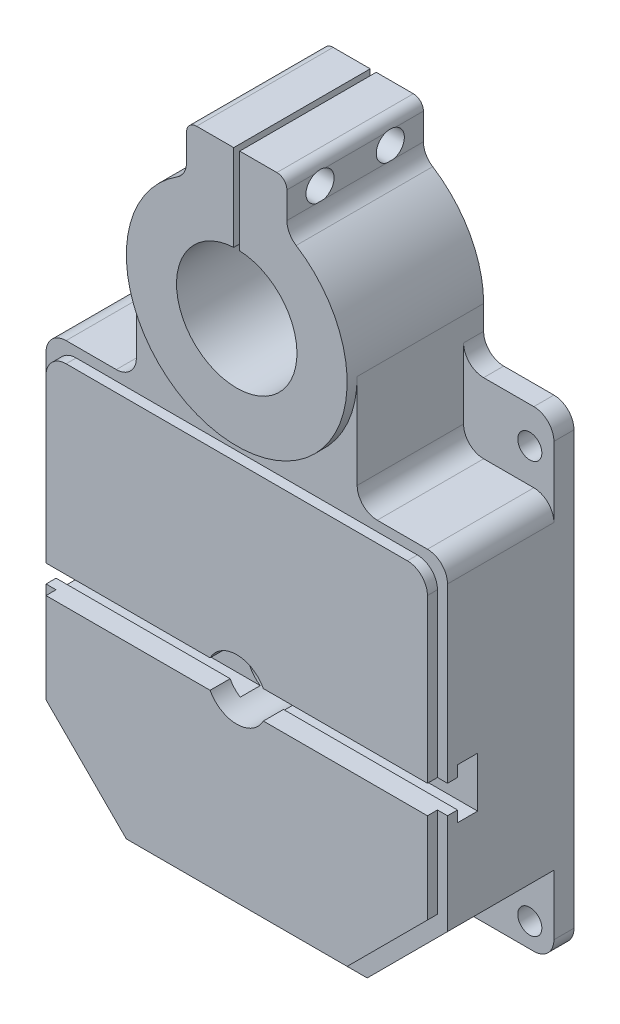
ISO-10303-21;
HEADER;
FILE_DESCRIPTION(('STEP AP214'),'2;1');
FILE_NAME('part.step','',(''),(''),'','','');
FILE_SCHEMA(('AUTOMOTIVE_DESIGN { 1 0 10303 214 1 1 1 1 }'));
ENDSEC;
DATA;
#1=APPLICATION_CONTEXT('core data for automotive mechanical design processes');
#2=APPLICATION_PROTOCOL_DEFINITION('international standard','automotive_design',2000,#1);
#3=PRODUCT_CONTEXT('',#1,'mechanical');
#4=PRODUCT('Part','Part','',(#3));
#5=PRODUCT_RELATED_PRODUCT_CATEGORY('part','',(#4));
#6=PRODUCT_DEFINITION_FORMATION('','',#4);
#7=PRODUCT_DEFINITION_CONTEXT('part definition',#1,'design');
#8=PRODUCT_DEFINITION('design','',#6,#7);
#9=PRODUCT_DEFINITION_SHAPE('','',#8);
#10=(LENGTH_UNIT() NAMED_UNIT(*) SI_UNIT(.MILLI.,.METRE.));
#11=(NAMED_UNIT(*) PLANE_ANGLE_UNIT() SI_UNIT($,.RADIAN.));
#12=(NAMED_UNIT(*) SI_UNIT($,.STERADIAN.) SOLID_ANGLE_UNIT());
#13=UNCERTAINTY_MEASURE_WITH_UNIT(LENGTH_MEASURE(1.E-05),#10,'distance_accuracy_value','');
#14=(GEOMETRIC_REPRESENTATION_CONTEXT(3) GLOBAL_UNCERTAINTY_ASSIGNED_CONTEXT((#13)) GLOBAL_UNIT_ASSIGNED_CONTEXT((#10,
#11,#12)) REPRESENTATION_CONTEXT('',''));
#15=CARTESIAN_POINT('',(0.,0.,0.));
#16=DIRECTION('',(0.,0.,1.));
#17=DIRECTION('',(1.,0.,0.));
#18=AXIS2_PLACEMENT_3D('',#15,#16,#17);
#19=CARTESIAN_POINT('',(25.,228.,10.));
#20=DIRECTION('',(-1.,0.,0.));
#21=DIRECTION('',(0.,-1.,0.));
#22=AXIS2_PLACEMENT_3D('',#19,#20,#21);
#23=PLANE('',#22);
#24=DIRECTION('',(0.,0.,-1.));
#25=VECTOR('',#24,1.);
#26=CARTESIAN_POINT('',(25.0000000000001,214.772255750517,10.));
#27=LINE('',#26,#25);
#28=CARTESIAN_POINT('',(25.0000000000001,214.772255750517,49.5667495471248));
#29=VERTEX_POINT('',#28);
#30=CARTESIAN_POINT('',(25.0000000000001,214.772255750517,18.4332504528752));
#31=VERTEX_POINT('',#30);
#32=EDGE_CURVE('E632',#29,#31,#27,.T.);
#33=ORIENTED_EDGE('',*,*,#32,.T.);
#34=CARTESIAN_POINT('',(25.,221.5,16.5));
#35=DIRECTION('',(1.,0.,0.));
#36=DIRECTION('',(0.,1.,0.));
#37=AXIS2_PLACEMENT_3D('',#34,#35,#36);
#38=CIRCLE('',#37,7.00000000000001);
#39=CARTESIAN_POINT('',(25.,228.,19.0980762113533));
#40=VERTEX_POINT('',#39);
#41=EDGE_CURVE('E622',#40,#31,#38,.T.);
#42=ORIENTED_EDGE('',*,*,#41,.F.);
#43=DIRECTION('',(0.,0.,-1.));
#44=VECTOR('',#43,1.);
#45=CARTESIAN_POINT('',(25.,228.,10.));
#46=LINE('',#45,#44);
#47=CARTESIAN_POINT('',(25.,228.,48.9019237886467));
#48=VERTEX_POINT('',#47);
#49=EDGE_CURVE('E630',#48,#40,#46,.T.);
#50=ORIENTED_EDGE('',*,*,#49,.F.);
#51=CARTESIAN_POINT('',(25.,221.5,51.5));
#52=DIRECTION('',(1.,0.,0.));
#53=DIRECTION('',(0.,1.,0.));
#54=AXIS2_PLACEMENT_3D('',#51,#52,#53);
#55=CIRCLE('',#54,7.);
#56=EDGE_CURVE('E62',#29,#48,#55,.T.);
#57=ORIENTED_EDGE('',*,*,#56,.F.);
#58=EDGE_LOOP('',(#33,#42,#50,#57));
#59=FACE_BOUND('',#58,.T.);
#60=ADVANCED_FACE('F36',(#59),#23,.F.);
#61=CARTESIAN_POINT('',(25.0000000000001,214.772255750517,68.));
#62=VERTEX_POINT('',#61);
#63=CARTESIAN_POINT('',(25.0000000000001,214.772255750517,53.4332504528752));
#64=VERTEX_POINT('',#63);
#65=EDGE_CURVE('E646',#62,#64,#27,.T.);
#66=ORIENTED_EDGE('',*,*,#65,.T.);
#67=CARTESIAN_POINT('',(25.,228.,54.0980762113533));
#68=VERTEX_POINT('',#67);
#69=EDGE_CURVE('E1633',#68,#64,#55,.T.);
#70=ORIENTED_EDGE('',*,*,#69,.F.);
#71=CARTESIAN_POINT('',(25.,228.,68.));
#72=VERTEX_POINT('',#71);
#73=EDGE_CURVE('E638',#72,#68,#46,.T.);
#74=ORIENTED_EDGE('',*,*,#73,.F.);
#75=DIRECTION('',(0.,1.,0.));
#76=VECTOR('',#75,1.);
#77=CARTESIAN_POINT('',(25.0000000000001,214.772255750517,68.));
#78=LINE('',#77,#76);
#79=EDGE_CURVE('E1363',#62,#72,#78,.T.);
#80=ORIENTED_EDGE('',*,*,#79,.F.);
#81=EDGE_LOOP('',(#66,#70,#74,#80));
#82=FACE_BOUND('',#81,.T.);
#83=ADVANCED_FACE('F1044',(#82),#23,.F.);
#84=CARTESIAN_POINT('',(0.,233.,10.));
#85=DIRECTION('',(0.,-1.,0.));
#86=DIRECTION('',(0.,0.,-1.));
#87=AXIS2_PLACEMENT_3D('',#84,#85,#86);
#88=PLANE('',#87);
#89=DIRECTION('',(-1.,0.,0.));
#90=VECTOR('',#89,1.);
#91=CARTESIAN_POINT('',(0.,233.,0.));
#92=LINE('',#91,#90);
#93=CARTESIAN_POINT('',(20.,233.,0.));
#94=VERTEX_POINT('',#93);
#95=CARTESIAN_POINT('',(1.50000000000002,233.,0.));
#96=VERTEX_POINT('',#95);
#97=EDGE_CURVE('E1075',#94,#96,#92,.T.);
#98=ORIENTED_EDGE('',*,*,#97,.T.);
#99=DIRECTION('',(0.,0.,-1.));
#100=VECTOR('',#99,1.);
#101=CARTESIAN_POINT('',(1.50000000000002,233.,81.7775821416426));
#102=LINE('',#101,#100);
#103=CARTESIAN_POINT('',(1.50000000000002,233.,68.));
#104=VERTEX_POINT('',#103);
#105=EDGE_CURVE('E1627',#104,#96,#102,.T.);
#106=ORIENTED_EDGE('',*,*,#105,.F.);
#107=DIRECTION('',(-1.,0.,0.));
#108=VECTOR('',#107,1.);
#109=CARTESIAN_POINT('',(20.,233.,68.));
#110=LINE('',#109,#108);
#111=CARTESIAN_POINT('',(20.,233.,68.));
#112=VERTEX_POINT('',#111);
#113=EDGE_CURVE('E1077',#112,#104,#110,.T.);
#114=ORIENTED_EDGE('',*,*,#113,.F.);
#115=DIRECTION('',(0.,0.,-1.));
#116=VECTOR('',#115,1.);
#117=CARTESIAN_POINT('',(20.,233.,10.));
#118=LINE('',#117,#116);
#119=EDGE_CURVE('E642',#112,#94,#118,.T.);
#120=ORIENTED_EDGE('',*,*,#119,.T.);
#121=EDGE_LOOP('',(#98,#106,#114,#120));
#122=FACE_BOUND('',#121,.T.);
#123=ADVANCED_FACE('F1037',(#122),#88,.F.);
#124=CARTESIAN_POINT('',(90.,93.,63.));
#125=DIRECTION('',(0.,0.,-1.));
#126=DIRECTION('',(-1.,0.,0.));
#127=AXIS2_PLACEMENT_3D('',#124,#125,#126);
#128=PLANE('',#127);
#129=DIRECTION('',(0.,-1.,0.));
#130=VECTOR('',#129,1.);
#131=CARTESIAN_POINT('',(-100.,92.9999999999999,63.));
#132=LINE('',#131,#130);
#133=CARTESIAN_POINT('',(-100.,92.9999999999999,63.));
#134=VERTEX_POINT('',#133);
#135=CARTESIAN_POINT('',(-100.,7.,63.));
#136=VERTEX_POINT('',#135);
#137=EDGE_CURVE('E1210',#134,#136,#132,.T.);
#138=ORIENTED_EDGE('',*,*,#137,.T.);
#139=DIRECTION('',(1.,0.,0.));
#140=VECTOR('',#139,1.);
#141=CARTESIAN_POINT('',(90.,7.00000000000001,63.));
#142=LINE('',#141,#140);
#143=CARTESIAN_POINT('',(-95.,7.,63.));
#144=VERTEX_POINT('',#143);
#145=EDGE_CURVE('E1527',#136,#144,#142,.T.);
#146=ORIENTED_EDGE('',*,*,#145,.T.);
#147=DIRECTION('',(0.,-1.,0.));
#148=VECTOR('',#147,1.);
#149=CARTESIAN_POINT('',(-95.,-52.,63.));
#150=LINE('',#149,#148);
#151=CARTESIAN_POINT('',(-95.,87.9999999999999,63.));
#152=VERTEX_POINT('',#151);
#153=EDGE_CURVE('E1316',#152,#144,#150,.T.);
#154=ORIENTED_EDGE('',*,*,#153,.F.);
#155=CARTESIAN_POINT('',(-85.,88.,63.));
#156=DIRECTION('',(0.,0.,1.));
#157=DIRECTION('',(1.,0.,0.));
#158=AXIS2_PLACEMENT_3D('',#155,#156,#157);
#159=CIRCLE('',#158,10.);
#160=CARTESIAN_POINT('',(-84.9999999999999,98.,63.));
#161=VERTEX_POINT('',#160);
#162=EDGE_CURVE('E1320',#161,#152,#159,.T.);
#163=ORIENTED_EDGE('',*,*,#162,.F.);
#164=DIRECTION('',(-1.,0.,0.));
#165=VECTOR('',#164,1.);
#166=CARTESIAN_POINT('',(-84.9999999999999,98.,63.));
#167=LINE('',#166,#165);
#168=CARTESIAN_POINT('',(84.9999999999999,98.,63.));
#169=VERTEX_POINT('',#168);
#170=EDGE_CURVE('E1296',#169,#161,#167,.T.);
#171=ORIENTED_EDGE('',*,*,#170,.F.);
#172=CARTESIAN_POINT('',(85.,88.,63.));
#173=DIRECTION('',(0.,0.,1.));
#174=DIRECTION('',(1.,0.,0.));
#175=AXIS2_PLACEMENT_3D('',#172,#173,#174);
#176=CIRCLE('',#175,10.);
#177=CARTESIAN_POINT('',(95.,87.9999999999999,63.));
#178=VERTEX_POINT('',#177);
#179=EDGE_CURVE('E1300',#178,#169,#176,.T.);
#180=ORIENTED_EDGE('',*,*,#179,.F.);
#181=DIRECTION('',(0.,1.,0.));
#182=VECTOR('',#181,1.);
#183=CARTESIAN_POINT('',(95.,87.9999999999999,63.));
#184=LINE('',#183,#182);
#185=CARTESIAN_POINT('',(95.,7.00000000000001,63.));
#186=VERTEX_POINT('',#185);
#187=EDGE_CURVE('E1306',#186,#178,#184,.T.);
#188=ORIENTED_EDGE('',*,*,#187,.F.);
#189=CARTESIAN_POINT('',(100.,7.,63.));
#190=VERTEX_POINT('',#189);
#191=EDGE_CURVE('E1522',#186,#190,#142,.T.);
#192=ORIENTED_EDGE('',*,*,#191,.T.);
#193=DIRECTION('',(0.,1.,0.));
#194=VECTOR('',#193,1.);
#195=CARTESIAN_POINT('',(100.,-57.,63.));
#196=LINE('',#195,#194);
#197=CARTESIAN_POINT('',(100.,92.9999999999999,63.));
#198=VERTEX_POINT('',#197);
#199=EDGE_CURVE('E1265',#190,#198,#196,.T.);
#200=ORIENTED_EDGE('',*,*,#199,.T.);
#201=CARTESIAN_POINT('',(90.,93.,63.));
#202=DIRECTION('',(0.,0.,1.));
#203=DIRECTION('',(-1.,0.,0.));
#204=AXIS2_PLACEMENT_3D('',#201,#202,#203);
#205=CIRCLE('',#204,9.99999999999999);
#206=CARTESIAN_POINT('',(89.9999999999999,103.,63.));
#207=VERTEX_POINT('',#206);
#208=EDGE_CURVE('E1260',#198,#207,#205,.T.);
#209=ORIENTED_EDGE('',*,*,#208,.T.);
#210=DIRECTION('',(-1.,0.,0.));
#211=VECTOR('',#210,1.);
#212=CARTESIAN_POINT('',(65.0000000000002,103.,63.));
#213=LINE('',#212,#211);
#214=CARTESIAN_POINT('',(65.0000000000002,103.,63.));
#215=VERTEX_POINT('',#214);
#216=EDGE_CURVE('E1258',#207,#215,#213,.T.);
#217=ORIENTED_EDGE('',*,*,#216,.T.);
#218=CARTESIAN_POINT('',(65.0000000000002,113.,63.));
#219=DIRECTION('',(0.,0.,-1.));
#220=DIRECTION('',(1.,0.,0.));
#221=AXIS2_PLACEMENT_3D('',#218,#219,#220);
#222=CIRCLE('',#221,9.99999999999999);
#223=CARTESIAN_POINT('',(55.0000000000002,113.,63.));
#224=VERTEX_POINT('',#223);
#225=EDGE_CURVE('E1256',#215,#224,#222,.T.);
#226=ORIENTED_EDGE('',*,*,#225,.T.);
#227=DIRECTION('',(0.,1.,0.));
#228=VECTOR('',#227,1.);
#229=CARTESIAN_POINT('',(55.,160.,63.));
#230=LINE('',#229,#228);
#231=CARTESIAN_POINT('',(55.,160.,63.));
#232=VERTEX_POINT('',#231);
#233=EDGE_CURVE('E1253',#224,#232,#230,.T.);
#234=ORIENTED_EDGE('',*,*,#233,.T.);
#235=CARTESIAN_POINT('',(0.,160.,63.));
#236=DIRECTION('',(0.,0.,1.));
#237=DIRECTION('',(1.,0.,0.));
#238=AXIS2_PLACEMENT_3D('',#235,#236,#237);
#239=CIRCLE('',#238,55.);
#240=CARTESIAN_POINT('',(-55.,160.,63.));
#241=VERTEX_POINT('',#240);
#242=EDGE_CURVE('E1343',#241,#232,#239,.T.);
#243=ORIENTED_EDGE('',*,*,#242,.F.);
#244=DIRECTION('',(0.,-1.,0.));
#245=VECTOR('',#244,1.);
#246=CARTESIAN_POINT('',(-55.,160.,63.));
#247=LINE('',#246,#245);
#248=CARTESIAN_POINT('',(-54.9999999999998,113.,63.));
#249=VERTEX_POINT('',#248);
#250=EDGE_CURVE('E1251',#241,#249,#247,.T.);
#251=ORIENTED_EDGE('',*,*,#250,.T.);
#252=CARTESIAN_POINT('',(-64.9999999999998,113.,63.));
#253=DIRECTION('',(0.,0.,-1.));
#254=DIRECTION('',(-1.,0.,0.));
#255=AXIS2_PLACEMENT_3D('',#252,#253,#254);
#256=CIRCLE('',#255,9.99999999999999);
#257=CARTESIAN_POINT('',(-64.9999999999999,103.,63.));
#258=VERTEX_POINT('',#257);
#259=EDGE_CURVE('E1249',#249,#258,#256,.T.);
#260=ORIENTED_EDGE('',*,*,#259,.T.);
#261=DIRECTION('',(-1.,0.,0.));
#262=VECTOR('',#261,1.);
#263=CARTESIAN_POINT('',(-89.9999999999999,103.,63.));
#264=LINE('',#263,#262);
#265=CARTESIAN_POINT('',(-89.9999999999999,103.,63.));
#266=VERTEX_POINT('',#265);
#267=EDGE_CURVE('E1247',#258,#266,#264,.T.);
#268=ORIENTED_EDGE('',*,*,#267,.T.);
#269=CARTESIAN_POINT('',(-90.,93.,63.));
#270=DIRECTION('',(0.,0.,1.));
#271=DIRECTION('',(1.,0.,0.));
#272=AXIS2_PLACEMENT_3D('',#269,#270,#271);
#273=CIRCLE('',#272,10.);
#274=EDGE_CURVE('E1245',#266,#134,#273,.T.);
#275=ORIENTED_EDGE('',*,*,#274,.T.);
#276=EDGE_LOOP('',(#138,#146,#154,#163,#171,#180,#188,#192,#200,#209,#217,#226,#234,#243,#251,
#260,#268,#275));
#277=FACE_BOUND('',#276,.T.);
#278=ADVANCED_FACE('F970',(#277),#128,.F.);
#279=CARTESIAN_POINT('',(-85.,88.,68.));
#280=DIRECTION('',(0.,0.,1.));
#281=DIRECTION('',(1.,0.,0.));
#282=AXIS2_PLACEMENT_3D('',#279,#280,#281);
#283=PLANE('',#282);
#284=DIRECTION('',(-1.,0.,0.));
#285=VECTOR('',#284,1.);
#286=CARTESIAN_POINT('',(-85.,7.00000000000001,68.));
#287=LINE('',#286,#285);
#288=CARTESIAN_POINT('',(95.,7.00000000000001,68.));
#289=VERTEX_POINT('',#288);
#290=CARTESIAN_POINT('',(13.2664991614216,7.,68.));
#291=VERTEX_POINT('',#290);
#292=EDGE_CURVE('E1526',#289,#291,#287,.T.);
#293=ORIENTED_EDGE('',*,*,#292,.F.);
#294=DIRECTION('',(0.,1.,0.));
#295=VECTOR('',#294,1.);
#296=CARTESIAN_POINT('',(95.,87.9999999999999,68.));
#297=LINE('',#296,#295);
#298=CARTESIAN_POINT('',(95.,87.9999999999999,68.));
#299=VERTEX_POINT('',#298);
#300=EDGE_CURVE('E1330',#289,#299,#297,.T.);
#301=ORIENTED_EDGE('',*,*,#300,.T.);
#302=CARTESIAN_POINT('',(85.,88.,68.));
#303=DIRECTION('',(0.,0.,1.));
#304=DIRECTION('',(1.,0.,0.));
#305=AXIS2_PLACEMENT_3D('',#302,#303,#304);
#306=CIRCLE('',#305,10.);
#307=CARTESIAN_POINT('',(84.9999999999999,98.,68.));
#308=VERTEX_POINT('',#307);
#309=EDGE_CURVE('E1325',#299,#308,#306,.T.);
#310=ORIENTED_EDGE('',*,*,#309,.T.);
#311=DIRECTION('',(-1.,0.,0.));
#312=VECTOR('',#311,1.);
#313=CARTESIAN_POINT('',(-84.9999999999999,98.,68.));
#314=LINE('',#313,#312);
#315=CARTESIAN_POINT('',(-84.9999999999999,98.,68.));
#316=VERTEX_POINT('',#315);
#317=EDGE_CURVE('E1295',#308,#316,#314,.T.);
#318=ORIENTED_EDGE('',*,*,#317,.T.);
#319=CARTESIAN_POINT('',(-85.,88.,68.));
#320=DIRECTION('',(0.,0.,1.));
#321=DIRECTION('',(1.,0.,0.));
#322=AXIS2_PLACEMENT_3D('',#319,#320,#321);
#323=CIRCLE('',#322,10.);
#324=CARTESIAN_POINT('',(-95.,87.9999999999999,68.));
#325=VERTEX_POINT('',#324);
#326=EDGE_CURVE('E1299',#316,#325,#323,.T.);
#327=ORIENTED_EDGE('',*,*,#326,.T.);
#328=DIRECTION('',(0.,-1.,0.));
#329=VECTOR('',#328,1.);
#330=CARTESIAN_POINT('',(-95.,-52.,68.));
#331=LINE('',#330,#329);
#332=CARTESIAN_POINT('',(-95.,7.00000000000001,68.));
#333=VERTEX_POINT('',#332);
#334=EDGE_CURVE('E1337',#325,#333,#331,.T.);
#335=ORIENTED_EDGE('',*,*,#334,.T.);
#336=CARTESIAN_POINT('',(-13.2664991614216,7.,68.));
#337=VERTEX_POINT('',#336);
#338=EDGE_CURVE('E1533',#337,#333,#287,.T.);
#339=ORIENTED_EDGE('',*,*,#338,.F.);
#340=CARTESIAN_POINT('',(0.,0.,68.));
#341=DIRECTION('',(0.,0.,-1.));
#342=DIRECTION('',(-1.,0.,0.));
#343=AXIS2_PLACEMENT_3D('',#340,#341,#342);
#344=CIRCLE('',#343,15.);
#345=EDGE_CURVE('E1452',#337,#291,#344,.T.);
#346=ORIENTED_EDGE('',*,*,#345,.T.);
#347=EDGE_LOOP('',(#293,#301,#310,#318,#327,#335,#339,#346));
#348=FACE_BOUND('',#347,.T.);
#349=ADVANCED_FACE('F933',(#348),#283,.T.);
#350=CARTESIAN_POINT('',(95.,87.9999999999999,68.));
#351=DIRECTION('',(-1.,0.,0.));
#352=DIRECTION('',(0.,-1.,0.));
#353=AXIS2_PLACEMENT_3D('',#350,#351,#352);
#354=PLANE('',#353);
#355=ORIENTED_EDGE('',*,*,#300,.F.);
#356=DIRECTION('',(0.,0.,-1.));
#357=VECTOR('',#356,1.);
#358=CARTESIAN_POINT('',(95.,7.00000000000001,68.));
#359=LINE('',#358,#357);
#360=EDGE_CURVE('E1523',#289,#186,#359,.T.);
#361=ORIENTED_EDGE('',*,*,#360,.T.);
#362=ORIENTED_EDGE('',*,*,#187,.T.);
#363=DIRECTION('',(0.,0.,-1.));
#364=VECTOR('',#363,1.);
#365=CARTESIAN_POINT('',(95.,87.9999999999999,68.));
#366=LINE('',#365,#364);
#367=EDGE_CURVE('E1286',#299,#178,#366,.T.);
#368=ORIENTED_EDGE('',*,*,#367,.F.);
#369=EDGE_LOOP('',(#355,#361,#362,#368));
#370=FACE_BOUND('',#369,.T.);
#371=ADVANCED_FACE('F946',(#370),#354,.F.);
#372=CARTESIAN_POINT('',(-95.,-52.,68.));
#373=DIRECTION('',(1.,0.,0.));
#374=DIRECTION('',(0.,1.,0.));
#375=AXIS2_PLACEMENT_3D('',#372,#373,#374);
#376=PLANE('',#375);
#377=ORIENTED_EDGE('',*,*,#153,.T.);
#378=DIRECTION('',(0.,0.,1.));
#379=VECTOR('',#378,1.);
#380=CARTESIAN_POINT('',(-95.,7.,68.));
#381=LINE('',#380,#379);
#382=EDGE_CURVE('E1530',#144,#333,#381,.T.);
#383=ORIENTED_EDGE('',*,*,#382,.T.);
#384=ORIENTED_EDGE('',*,*,#334,.F.);
#385=DIRECTION('',(0.,0.,-1.));
#386=VECTOR('',#385,1.);
#387=CARTESIAN_POINT('',(-95.,87.9999999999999,68.));
#388=LINE('',#387,#386);
#389=EDGE_CURVE('E1241',#325,#152,#388,.T.);
#390=ORIENTED_EDGE('',*,*,#389,.T.);
#391=EDGE_LOOP('',(#377,#383,#384,#390));
#392=FACE_BOUND('',#391,.T.);
#393=ADVANCED_FACE('F861',(#392),#376,.F.);
#394=CARTESIAN_POINT('',(-90.,82.9999999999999,53.));
#395=DIRECTION('',(-1.,0.,0.));
#396=DIRECTION('',(0.,-1.,0.));
#397=AXIS2_PLACEMENT_3D('',#394,#395,#396);
#398=PLANE('',#397);
#399=CARTESIAN_POINT('',(-90.,70.,29.));
#400=DIRECTION('',(-1.,0.,0.));
#401=DIRECTION('',(0.,0.,1.));
#402=AXIS2_PLACEMENT_3D('',#399,#400,#401);
#403=CIRCLE('',#402,11.);
#404=CARTESIAN_POINT('',(-90.,70.,40.));
#405=VERTEX_POINT('',#404);
#406=EDGE_CURVE('E1592',#405,#405,#403,.T.);
#407=ORIENTED_EDGE('',*,*,#406,.T.);
#408=EDGE_LOOP('',(#407));
#409=FACE_BOUND('',#408,.T.);
#410=DIRECTION('',(0.,1.,0.));
#411=VECTOR('',#410,1.);
#412=CARTESIAN_POINT('',(-90.,82.9999999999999,53.));
#413=LINE('',#412,#411);
#414=CARTESIAN_POINT('',(-90.,27.5,53.));
#415=VERTEX_POINT('',#414);
#416=CARTESIAN_POINT('',(-90.,82.9999999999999,53.));
#417=VERTEX_POINT('',#416);
#418=EDGE_CURVE('E1455',#415,#417,#413,.T.);
#419=ORIENTED_EDGE('',*,*,#418,.F.);
#420=DIRECTION('',(0.,0.,1.));
#421=VECTOR('',#420,1.);
#422=CARTESIAN_POINT('',(-90.,27.5,35.));
#423=LINE('',#422,#421);
#424=CARTESIAN_POINT('',(-90.,27.5,35.));
#425=VERTEX_POINT('',#424);
#426=EDGE_CURVE('E719',#415,#425,#423,.F.);
#427=ORIENTED_EDGE('',*,*,#426,.T.);
#428=DIRECTION('',(0.,1.,0.));
#429=VECTOR('',#428,1.);
#430=CARTESIAN_POINT('',(-90.,22.5,35.));
#431=LINE('',#430,#429);
#432=CARTESIAN_POINT('',(-90.,-27.5,35.));
#433=VERTEX_POINT('',#432);
#434=EDGE_CURVE('E1514',#433,#425,#431,.T.);
#435=ORIENTED_EDGE('',*,*,#434,.F.);
#436=DIRECTION('',(0.,0.,1.));
#437=VECTOR('',#436,1.);
#438=CARTESIAN_POINT('',(-90.,-27.5,53.));
#439=LINE('',#438,#437);
#440=CARTESIAN_POINT('',(-90.,-27.5,53.));
#441=VERTEX_POINT('',#440);
#442=EDGE_CURVE('E716',#433,#441,#439,.T.);
#443=ORIENTED_EDGE('',*,*,#442,.T.);
#444=CARTESIAN_POINT('',(-90.,-47.,53.));
#445=VERTEX_POINT('',#444);
#446=EDGE_CURVE('E1375',#445,#441,#413,.T.);
#447=ORIENTED_EDGE('',*,*,#446,.F.);
#448=DIRECTION('',(0.,0.,-1.));
#449=VECTOR('',#448,1.);
#450=CARTESIAN_POINT('',(-90.,-47.,53.));
#451=LINE('',#450,#449);
#452=CARTESIAN_POINT('',(-90.,-47.,0.));
#453=VERTEX_POINT('',#452);
#454=EDGE_CURVE('E1401',#445,#453,#451,.T.);
#455=ORIENTED_EDGE('',*,*,#454,.T.);
#456=DIRECTION('',(0.,1.,0.));
#457=VECTOR('',#456,1.);
#458=CARTESIAN_POINT('',(-90.,82.9999999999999,0.));
#459=LINE('',#458,#457);
#460=CARTESIAN_POINT('',(-90.,82.9999999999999,0.));
#461=VERTEX_POINT('',#460);
#462=EDGE_CURVE('E1404',#453,#461,#459,.T.);
#463=ORIENTED_EDGE('',*,*,#462,.T.);
#464=DIRECTION('',(0.,0.,-1.));
#465=VECTOR('',#464,1.);
#466=CARTESIAN_POINT('',(-90.,82.9999999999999,53.));
#467=LINE('',#466,#465);
#468=EDGE_CURVE('E1370',#417,#461,#467,.T.);
#469=ORIENTED_EDGE('',*,*,#468,.F.);
#470=EDGE_LOOP('',(#419,#427,#435,#443,#447,#455,#463,#469));
#471=FACE_BOUND('',#470,.T.);
#472=ADVANCED_FACE('F858',(#409,#471),#398,.F.);
#473=CARTESIAN_POINT('',(89.9999999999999,-47.,53.));
#474=DIRECTION('',(1.,0.,0.));
#475=DIRECTION('',(0.,1.,0.));
#476=AXIS2_PLACEMENT_3D('',#473,#474,#475);
#477=PLANE('',#476);
#478=DIRECTION('',(0.,-1.,0.));
#479=VECTOR('',#478,1.);
#480=CARTESIAN_POINT('',(90.,22.5,35.));
#481=LINE('',#480,#479);
#482=CARTESIAN_POINT('',(90.,27.5,35.));
#483=VERTEX_POINT('',#482);
#484=CARTESIAN_POINT('',(90.,-27.5,35.));
#485=VERTEX_POINT('',#484);
#486=EDGE_CURVE('E1506',#483,#485,#481,.T.);
#487=ORIENTED_EDGE('',*,*,#486,.F.);
#488=DIRECTION('',(0.,0.,1.));
#489=VECTOR('',#488,1.);
#490=CARTESIAN_POINT('',(90.,27.5,53.));
#491=LINE('',#490,#489);
#492=CARTESIAN_POINT('',(90.,27.5,53.));
#493=VERTEX_POINT('',#492);
#494=EDGE_CURVE('E734',#483,#493,#491,.T.);
#495=ORIENTED_EDGE('',*,*,#494,.T.);
#496=DIRECTION('',(0.,-1.,0.));
#497=VECTOR('',#496,1.);
#498=CARTESIAN_POINT('',(89.9999999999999,-47.,53.));
#499=LINE('',#498,#497);
#500=CARTESIAN_POINT('',(90.,82.9999999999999,53.));
#501=VERTEX_POINT('',#500);
#502=EDGE_CURVE('E1465',#501,#493,#499,.T.);
#503=ORIENTED_EDGE('',*,*,#502,.F.);
#504=DIRECTION('',(0.,0.,-1.));
#505=VECTOR('',#504,1.);
#506=CARTESIAN_POINT('',(90.,82.9999999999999,53.));
#507=LINE('',#506,#505);
#508=CARTESIAN_POINT('',(90.,82.9999999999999,0.));
#509=VERTEX_POINT('',#508);
#510=EDGE_CURVE('E1393',#501,#509,#507,.T.);
#511=ORIENTED_EDGE('',*,*,#510,.T.);
#512=DIRECTION('',(0.,-1.,0.));
#513=VECTOR('',#512,1.);
#514=CARTESIAN_POINT('',(89.9999999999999,-47.,0.));
#515=LINE('',#514,#513);
#516=CARTESIAN_POINT('',(89.9999999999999,-47.,0.));
#517=VERTEX_POINT('',#516);
#518=EDGE_CURVE('E1417',#509,#517,#515,.T.);
#519=ORIENTED_EDGE('',*,*,#518,.T.);
#520=DIRECTION('',(0.,0.,-1.));
#521=VECTOR('',#520,1.);
#522=CARTESIAN_POINT('',(89.9999999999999,-47.,53.));
#523=LINE('',#522,#521);
#524=CARTESIAN_POINT('',(89.9999999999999,-47.,53.));
#525=VERTEX_POINT('',#524);
#526=EDGE_CURVE('E1395',#525,#517,#523,.T.);
#527=ORIENTED_EDGE('',*,*,#526,.F.);
#528=CARTESIAN_POINT('',(89.9999999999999,-27.5,53.));
#529=VERTEX_POINT('',#528);
#530=EDGE_CURVE('E1468',#529,#525,#499,.T.);
#531=ORIENTED_EDGE('',*,*,#530,.F.);
#532=DIRECTION('',(0.,0.,1.));
#533=VECTOR('',#532,1.);
#534=CARTESIAN_POINT('',(89.9999999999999,-27.5,35.));
#535=LINE('',#534,#533);
#536=EDGE_CURVE('E731',#529,#485,#535,.F.);
#537=ORIENTED_EDGE('',*,*,#536,.T.);
#538=EDGE_LOOP('',(#487,#495,#503,#511,#519,#527,#531,#537));
#539=FACE_BOUND('',#538,.T.);
#540=ADVANCED_FACE('F856',(#539),#477,.F.);
#541=CARTESIAN_POINT('',(-80.,83.,53.));
#542=DIRECTION('',(0.,0.,1.));
#543=DIRECTION('',(1.,0.,0.));
#544=AXIS2_PLACEMENT_3D('',#541,#542,#543);
#545=PLANE('',#544);
#546=ORIENTED_EDGE('',*,*,#446,.T.);
#547=CARTESIAN_POINT('',(-85.,-27.5,53.));
#548=DIRECTION('',(0.,0.,1.));
#549=DIRECTION('',(1.,0.,0.));
#550=AXIS2_PLACEMENT_3D('',#547,#548,#549);
#551=CIRCLE('',#550,5.);
#552=CARTESIAN_POINT('',(-85.,-22.5,53.));
#553=VERTEX_POINT('',#552);
#554=EDGE_CURVE('E724',#441,#553,#551,.F.);
#555=ORIENTED_EDGE('',*,*,#554,.T.);
#556=DIRECTION('',(-1.,0.,0.));
#557=VECTOR('',#556,1.);
#558=CARTESIAN_POINT('',(-90.,-22.5,53.));
#559=LINE('',#558,#557);
#560=CARTESIAN_POINT('',(84.9999999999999,-22.5,53.));
#561=VERTEX_POINT('',#560);
#562=EDGE_CURVE('E1507',#561,#553,#559,.T.);
#563=ORIENTED_EDGE('',*,*,#562,.F.);
#564=CARTESIAN_POINT('',(84.9999999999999,-27.5,53.));
#565=DIRECTION('',(0.,0.,1.));
#566=DIRECTION('',(1.,0.,0.));
#567=AXIS2_PLACEMENT_3D('',#564,#565,#566);
#568=CIRCLE('',#567,5.);
#569=EDGE_CURVE('E722',#561,#529,#568,.F.);
#570=ORIENTED_EDGE('',*,*,#569,.T.);
#571=ORIENTED_EDGE('',*,*,#530,.T.);
#572=DIRECTION('',(-0.707106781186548,-0.707106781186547,0.));
#573=VECTOR('',#572,1.);
#574=CARTESIAN_POINT('',(49.9999999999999,-87.,53.));
#575=LINE('',#574,#573);
#576=CARTESIAN_POINT('',(49.9999999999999,-87.,53.));
#577=VERTEX_POINT('',#576);
#578=EDGE_CURVE('E1462',#525,#577,#575,.T.);
#579=ORIENTED_EDGE('',*,*,#578,.T.);
#580=DIRECTION('',(-1.,0.,0.));
#581=VECTOR('',#580,1.);
#582=CARTESIAN_POINT('',(-50.,-87.,53.));
#583=LINE('',#582,#581);
#584=CARTESIAN_POINT('',(-50.,-87.,53.));
#585=VERTEX_POINT('',#584);
#586=EDGE_CURVE('E1459',#577,#585,#583,.T.);
#587=ORIENTED_EDGE('',*,*,#586,.T.);
#588=DIRECTION('',(-0.707106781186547,0.707106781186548,0.));
#589=VECTOR('',#588,1.);
#590=CARTESIAN_POINT('',(-90.,-47.,53.));
#591=LINE('',#590,#589);
#592=EDGE_CURVE('E1456',#585,#445,#591,.T.);
#593=ORIENTED_EDGE('',*,*,#592,.T.);
#594=EDGE_LOOP('',(#546,#555,#563,#570,#571,#579,#587,#593));
#595=FACE_BOUND('',#594,.T.);
#596=ADVANCED_FACE('F852',(#595),#545,.F.);
#597=DIRECTION('',(1.,0.,0.));
#598=VECTOR('',#597,1.);
#599=CARTESIAN_POINT('',(-90.,22.5,53.));
#600=LINE('',#599,#598);
#601=CARTESIAN_POINT('',(-85.,22.5,53.));
#602=VERTEX_POINT('',#601);
#603=CARTESIAN_POINT('',(84.9999999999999,22.5,53.));
#604=VERTEX_POINT('',#603);
#605=EDGE_CURVE('E1503',#602,#604,#600,.T.);
#606=ORIENTED_EDGE('',*,*,#605,.F.);
#607=CARTESIAN_POINT('',(-85.,27.5,53.));
#608=DIRECTION('',(0.,0.,1.));
#609=DIRECTION('',(1.,0.,0.));
#610=AXIS2_PLACEMENT_3D('',#607,#608,#609);
#611=CIRCLE('',#610,5.);
#612=EDGE_CURVE('E714',#602,#415,#611,.F.);
#613=ORIENTED_EDGE('',*,*,#612,.T.);
#614=ORIENTED_EDGE('',*,*,#418,.T.);
#615=CARTESIAN_POINT('',(-80.,83.,53.));
#616=DIRECTION('',(0.,0.,-1.));
#617=DIRECTION('',(1.,0.,0.));
#618=AXIS2_PLACEMENT_3D('',#615,#616,#617);
#619=CIRCLE('',#618,9.99999999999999);
#620=CARTESIAN_POINT('',(-79.9999999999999,93.,53.));
#621=VERTEX_POINT('',#620);
#622=EDGE_CURVE('E1407',#417,#621,#619,.T.);
#623=ORIENTED_EDGE('',*,*,#622,.T.);
#624=DIRECTION('',(1.,0.,0.));
#625=VECTOR('',#624,1.);
#626=CARTESIAN_POINT('',(-50.0000000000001,93.,53.));
#627=LINE('',#626,#625);
#628=CARTESIAN_POINT('',(-50.0000000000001,93.,53.));
#629=VERTEX_POINT('',#628);
#630=EDGE_CURVE('E1495',#621,#629,#627,.T.);
#631=ORIENTED_EDGE('',*,*,#630,.T.);
#632=CARTESIAN_POINT('',(-50.,103.,53.));
#633=DIRECTION('',(0.,0.,1.));
#634=DIRECTION('',(-1.,0.,0.));
#635=AXIS2_PLACEMENT_3D('',#632,#633,#634);
#636=CIRCLE('',#635,10.);
#637=CARTESIAN_POINT('',(-40.,103.,53.));
#638=VERTEX_POINT('',#637);
#639=EDGE_CURVE('E1492',#629,#638,#636,.T.);
#640=ORIENTED_EDGE('',*,*,#639,.T.);
#641=DIRECTION('',(0.,1.,0.));
#642=VECTOR('',#641,1.);
#643=CARTESIAN_POINT('',(-40.,108.,53.));
#644=LINE('',#643,#642);
#645=CARTESIAN_POINT('',(-40.,108.,53.));
#646=VERTEX_POINT('',#645);
#647=EDGE_CURVE('E1489',#638,#646,#644,.T.);
#648=ORIENTED_EDGE('',*,*,#647,.T.);
#649=CARTESIAN_POINT('',(-30.,108.,53.));
#650=DIRECTION('',(0.,0.,-1.));
#651=DIRECTION('',(1.,0.,0.));
#652=AXIS2_PLACEMENT_3D('',#649,#650,#651);
#653=CIRCLE('',#652,10.);
#654=CARTESIAN_POINT('',(-29.9999999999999,118.,53.));
#655=VERTEX_POINT('',#654);
#656=EDGE_CURVE('E1486',#646,#655,#653,.T.);
#657=ORIENTED_EDGE('',*,*,#656,.T.);
#658=DIRECTION('',(1.,0.,0.));
#659=VECTOR('',#658,1.);
#660=CARTESIAN_POINT('',(0.,118.,53.));
#661=LINE('',#660,#659);
#662=CARTESIAN_POINT('',(29.9999999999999,118.,53.));
#663=VERTEX_POINT('',#662);
#664=EDGE_CURVE('E1484',#655,#663,#661,.T.);
#665=ORIENTED_EDGE('',*,*,#664,.T.);
#666=CARTESIAN_POINT('',(30.,108.,53.));
#667=DIRECTION('',(0.,0.,-1.));
#668=DIRECTION('',(1.,0.,0.));
#669=AXIS2_PLACEMENT_3D('',#666,#667,#668);
#670=CIRCLE('',#669,10.);
#671=CARTESIAN_POINT('',(40.,108.,53.));
#672=VERTEX_POINT('',#671);
#673=EDGE_CURVE('E1481',#663,#672,#670,.T.);
#674=ORIENTED_EDGE('',*,*,#673,.T.);
#675=DIRECTION('',(0.,-1.,0.));
#676=VECTOR('',#675,1.);
#677=CARTESIAN_POINT('',(40.,108.,53.));
#678=LINE('',#677,#676);
#679=CARTESIAN_POINT('',(40.,103.,53.));
#680=VERTEX_POINT('',#679);
#681=EDGE_CURVE('E1478',#672,#680,#678,.T.);
#682=ORIENTED_EDGE('',*,*,#681,.T.);
#683=CARTESIAN_POINT('',(50.,103.,53.));
#684=DIRECTION('',(0.,0.,1.));
#685=DIRECTION('',(1.,0.,0.));
#686=AXIS2_PLACEMENT_3D('',#683,#684,#685);
#687=CIRCLE('',#686,10.);
#688=CARTESIAN_POINT('',(50.0000000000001,93.,53.));
#689=VERTEX_POINT('',#688);
#690=EDGE_CURVE('E1475',#680,#689,#687,.T.);
#691=ORIENTED_EDGE('',*,*,#690,.T.);
#692=DIRECTION('',(1.,0.,0.));
#693=VECTOR('',#692,1.);
#694=CARTESIAN_POINT('',(79.9999999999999,93.,53.));
#695=LINE('',#694,#693);
#696=CARTESIAN_POINT('',(79.9999999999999,93.,53.));
#697=VERTEX_POINT('',#696);
#698=EDGE_CURVE('E1472',#689,#697,#695,.T.);
#699=ORIENTED_EDGE('',*,*,#698,.T.);
#700=CARTESIAN_POINT('',(80.,83.,53.));
#701=DIRECTION('',(0.,0.,-1.));
#702=DIRECTION('',(-1.,0.,0.));
#703=AXIS2_PLACEMENT_3D('',#700,#701,#702);
#704=CIRCLE('',#703,9.99999999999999);
#705=EDGE_CURVE('E1469',#697,#501,#704,.T.);
#706=ORIENTED_EDGE('',*,*,#705,.T.);
#707=ORIENTED_EDGE('',*,*,#502,.T.);
#708=CARTESIAN_POINT('',(85.,27.5,53.));
#709=DIRECTION('',(0.,0.,1.));
#710=DIRECTION('',(1.,0.,0.));
#711=AXIS2_PLACEMENT_3D('',#708,#709,#710);
#712=CIRCLE('',#711,5.);
#713=EDGE_CURVE('E712',#493,#604,#712,.F.);
#714=ORIENTED_EDGE('',*,*,#713,.T.);
#715=EDGE_LOOP('',(#606,#613,#614,#623,#631,#640,#648,#657,#665,#674,#682,#691,#699,#706,#707,#714));
#716=FACE_BOUND('',#715,.T.);
#717=ADVANCED_FACE('F855',(#716),#545,.F.);
#718=CARTESIAN_POINT('',(100.,-57.,63.));
#719=VERTEX_POINT('',#718);
#720=CARTESIAN_POINT('',(100.,-7.,63.));
#721=VERTEX_POINT('',#720);
#722=EDGE_CURVE('E1262',#719,#721,#196,.T.);
#723=ORIENTED_EDGE('',*,*,#722,.T.);
#724=DIRECTION('',(-1.,0.,0.));
#725=VECTOR('',#724,1.);
#726=CARTESIAN_POINT('',(90.,-7.00000000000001,63.));
#727=LINE('',#726,#725);
#728=CARTESIAN_POINT('',(95.,-7.00000000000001,63.));
#729=VERTEX_POINT('',#728);
#730=EDGE_CURVE('E1540',#721,#729,#727,.T.);
#731=ORIENTED_EDGE('',*,*,#730,.T.);
#732=CARTESIAN_POINT('',(95.,-52.,63.));
#733=VERTEX_POINT('',#732);
#734=EDGE_CURVE('E1303',#733,#729,#184,.T.);
#735=ORIENTED_EDGE('',*,*,#734,.F.);
#736=DIRECTION('',(0.707106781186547,0.707106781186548,0.));
#737=VECTOR('',#736,1.);
#738=CARTESIAN_POINT('',(95.,-52.,63.));
#739=LINE('',#738,#737);
#740=CARTESIAN_POINT('',(55.,-92.,63.));
#741=VERTEX_POINT('',#740);
#742=EDGE_CURVE('E1307',#741,#733,#739,.T.);
#743=ORIENTED_EDGE('',*,*,#742,.F.);
#744=DIRECTION('',(1.,0.,0.));
#745=VECTOR('',#744,1.);
#746=CARTESIAN_POINT('',(55.,-92.,63.));
#747=LINE('',#746,#745);
#748=CARTESIAN_POINT('',(-55.,-92.,63.));
#749=VERTEX_POINT('',#748);
#750=EDGE_CURVE('E1310',#749,#741,#747,.T.);
#751=ORIENTED_EDGE('',*,*,#750,.F.);
#752=DIRECTION('',(0.707106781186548,-0.707106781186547,0.));
#753=VECTOR('',#752,1.);
#754=CARTESIAN_POINT('',(-55.,-92.,63.));
#755=LINE('',#754,#753);
#756=CARTESIAN_POINT('',(-95.,-52.,63.));
#757=VERTEX_POINT('',#756);
#758=EDGE_CURVE('E1313',#757,#749,#755,.T.);
#759=ORIENTED_EDGE('',*,*,#758,.F.);
#760=CARTESIAN_POINT('',(-95.,-7.,63.));
#761=VERTEX_POINT('',#760);
#762=EDGE_CURVE('E1319',#761,#757,#150,.T.);
#763=ORIENTED_EDGE('',*,*,#762,.F.);
#764=CARTESIAN_POINT('',(-100.,-7.,63.));
#765=VERTEX_POINT('',#764);
#766=EDGE_CURVE('E1535',#761,#765,#727,.T.);
#767=ORIENTED_EDGE('',*,*,#766,.T.);
#768=CARTESIAN_POINT('',(-100.,-57.,63.));
#769=VERTEX_POINT('',#768);
#770=EDGE_CURVE('E1244',#765,#769,#132,.T.);
#771=ORIENTED_EDGE('',*,*,#770,.T.);
#772=DIRECTION('',(0.707106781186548,-0.707106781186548,0.));
#773=VECTOR('',#772,1.);
#774=CARTESIAN_POINT('',(-100.,-57.,63.));
#775=LINE('',#774,#773);
#776=CARTESIAN_POINT('',(-60.,-97.,63.));
#777=VERTEX_POINT('',#776);
#778=EDGE_CURVE('E1214',#769,#777,#775,.T.);
#779=ORIENTED_EDGE('',*,*,#778,.T.);
#780=DIRECTION('',(1.,0.,0.));
#781=VECTOR('',#780,1.);
#782=CARTESIAN_POINT('',(-60.,-97.,63.));
#783=LINE('',#782,#781);
#784=CARTESIAN_POINT('',(60.,-97.,63.));
#785=VERTEX_POINT('',#784);
#786=EDGE_CURVE('E1268',#777,#785,#783,.T.);
#787=ORIENTED_EDGE('',*,*,#786,.T.);
#788=DIRECTION('',(0.707106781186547,0.707106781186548,0.));
#789=VECTOR('',#788,1.);
#790=CARTESIAN_POINT('',(60.,-97.,63.));
#791=LINE('',#790,#789);
#792=EDGE_CURVE('E1266',#785,#719,#791,.T.);
#793=ORIENTED_EDGE('',*,*,#792,.T.);
#794=EDGE_LOOP('',(#723,#731,#735,#743,#751,#759,#763,#767,#771,#779,#787,#793));
#795=FACE_BOUND('',#794,.T.);
#796=ADVANCED_FACE('F965',(#795),#128,.F.);
#797=CARTESIAN_POINT('',(-20.,228.,10.));
#798=DIRECTION('',(0.,0.,-1.));
#799=DIRECTION('',(-1.,0.,0.));
#800=AXIS2_PLACEMENT_3D('',#797,#798,#799);
#801=PLANE('',#800);
#802=CARTESIAN_POINT('',(-88.,-85.,10.));
#803=DIRECTION('',(0.,0.,1.));
#804=DIRECTION('',(1.,0.,0.));
#805=AXIS2_PLACEMENT_3D('',#802,#803,#804);
#806=CIRCLE('',#805,6.);
#807=CARTESIAN_POINT('',(-82.,-85.,10.));
#808=VERTEX_POINT('',#807);
#809=EDGE_CURVE('E1150',#808,#808,#806,.T.);
#810=ORIENTED_EDGE('',*,*,#809,.F.);
#811=EDGE_LOOP('',(#810));
#812=FACE_BOUND('',#811,.T.);
#813=DIRECTION('',(0.707106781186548,-0.707106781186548,0.));
#814=VECTOR('',#813,1.);
#815=CARTESIAN_POINT('',(-100.,-57.,10.));
#816=LINE('',#815,#814);
#817=CARTESIAN_POINT('',(-100.,-57.,10.));
#818=VERTEX_POINT('',#817);
#819=CARTESIAN_POINT('',(-60.,-97.,10.));
#820=VERTEX_POINT('',#819);
#821=EDGE_CURVE('E1238',#818,#820,#816,.T.);
#822=ORIENTED_EDGE('',*,*,#821,.F.);
#823=DIRECTION('',(0.,-1.,0.));
#824=VECTOR('',#823,1.);
#825=CARTESIAN_POINT('',(-100.,-87.,10.));
#826=LINE('',#825,#824);
#827=CARTESIAN_POINT('',(-100.,-87.,10.));
#828=VERTEX_POINT('',#827);
#829=EDGE_CURVE('E1145',#818,#828,#826,.T.);
#830=ORIENTED_EDGE('',*,*,#829,.T.);
#831=CARTESIAN_POINT('',(-90.,-87.,10.));
#832=DIRECTION('',(0.,0.,1.));
#833=DIRECTION('',(1.,0.,0.));
#834=AXIS2_PLACEMENT_3D('',#831,#832,#833);
#835=CIRCLE('',#834,10.);
#836=CARTESIAN_POINT('',(-89.9999999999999,-97.,10.));
#837=VERTEX_POINT('',#836);
#838=EDGE_CURVE('E1141',#828,#837,#835,.T.);
#839=ORIENTED_EDGE('',*,*,#838,.T.);
#840=DIRECTION('',(1.,0.,0.));
#841=VECTOR('',#840,1.);
#842=CARTESIAN_POINT('',(89.9999999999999,-97.,10.));
#843=LINE('',#842,#841);
#844=EDGE_CURVE('E1138',#837,#820,#843,.T.);
#845=ORIENTED_EDGE('',*,*,#844,.T.);
#846=EDGE_LOOP('',(#822,#830,#839,#845));
#847=FACE_BOUND('',#846,.T.);
#848=ADVANCED_FACE('F968',(#812,#847),#801,.F.);
#849=CARTESIAN_POINT('',(-88.,120.,10.));
#850=DIRECTION('',(0.,0.,1.));
#851=DIRECTION('',(1.,0.,0.));
#852=AXIS2_PLACEMENT_3D('',#849,#850,#851);
#853=CIRCLE('',#852,6.);
#854=CARTESIAN_POINT('',(-82.,120.,10.));
#855=VERTEX_POINT('',#854);
#856=EDGE_CURVE('E1154',#855,#855,#853,.T.);
#857=ORIENTED_EDGE('',*,*,#856,.F.);
#858=EDGE_LOOP('',(#857));
#859=FACE_BOUND('',#858,.T.);
#860=CARTESIAN_POINT('',(-90.,93.,10.));
#861=DIRECTION('',(0.,0.,1.));
#862=DIRECTION('',(1.,0.,0.));
#863=AXIS2_PLACEMENT_3D('',#860,#861,#862);
#864=CIRCLE('',#863,10.);
#865=CARTESIAN_POINT('',(-89.9999999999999,103.,10.));
#866=VERTEX_POINT('',#865);
#867=CARTESIAN_POINT('',(-100.,93.,10.));
#868=VERTEX_POINT('',#867);
#869=EDGE_CURVE('E1211',#866,#868,#864,.T.);
#870=ORIENTED_EDGE('',*,*,#869,.F.);
#871=DIRECTION('',(-1.,0.,0.));
#872=VECTOR('',#871,1.);
#873=CARTESIAN_POINT('',(-89.9999999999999,103.,10.));
#874=LINE('',#873,#872);
#875=CARTESIAN_POINT('',(-64.9999999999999,103.,10.));
#876=VERTEX_POINT('',#875);
#877=EDGE_CURVE('E1215',#876,#866,#874,.T.);
#878=ORIENTED_EDGE('',*,*,#877,.F.);
#879=CARTESIAN_POINT('',(-64.9999999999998,113.,10.));
#880=DIRECTION('',(0.,0.,-1.));
#881=DIRECTION('',(-1.,0.,0.));
#882=AXIS2_PLACEMENT_3D('',#879,#880,#881);
#883=CIRCLE('',#882,9.99999999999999);
#884=CARTESIAN_POINT('',(-54.9999999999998,113.,10.));
#885=VERTEX_POINT('',#884);
#886=EDGE_CURVE('E1218',#885,#876,#883,.T.);
#887=ORIENTED_EDGE('',*,*,#886,.F.);
#888=DIRECTION('',(0.,-1.,0.));
#889=VECTOR('',#888,1.);
#890=CARTESIAN_POINT('',(-55.,160.,10.));
#891=LINE('',#890,#889);
#892=CARTESIAN_POINT('',(-55.,148.,10.));
#893=VERTEX_POINT('',#892);
#894=EDGE_CURVE('E706',#893,#885,#891,.T.);
#895=ORIENTED_EDGE('',*,*,#894,.F.);
#896=CARTESIAN_POINT('',(-65.,148.,10.));
#897=DIRECTION('',(0.,0.,-1.));
#898=DIRECTION('',(-1.,0.,0.));
#899=AXIS2_PLACEMENT_3D('',#896,#897,#898);
#900=CIRCLE('',#899,10.);
#901=CARTESIAN_POINT('',(-65.,138.,10.));
#902=VERTEX_POINT('',#901);
#903=EDGE_CURVE('E1083',#893,#902,#900,.T.);
#904=ORIENTED_EDGE('',*,*,#903,.T.);
#905=DIRECTION('',(-1.,0.,0.));
#906=VECTOR('',#905,1.);
#907=CARTESIAN_POINT('',(-89.9999999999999,138.,10.));
#908=LINE('',#907,#906);
#909=CARTESIAN_POINT('',(-89.9999999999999,138.,10.));
#910=VERTEX_POINT('',#909);
#911=EDGE_CURVE('E1084',#902,#910,#908,.T.);
#912=ORIENTED_EDGE('',*,*,#911,.T.);
#913=CARTESIAN_POINT('',(-90.,128.,10.));
#914=DIRECTION('',(0.,0.,1.));
#915=DIRECTION('',(-1.,0.,0.));
#916=AXIS2_PLACEMENT_3D('',#913,#914,#915);
#917=CIRCLE('',#916,10.);
#918=CARTESIAN_POINT('',(-100.,128.,10.));
#919=VERTEX_POINT('',#918);
#920=EDGE_CURVE('E1146',#910,#919,#917,.T.);
#921=ORIENTED_EDGE('',*,*,#920,.T.);
#922=EDGE_CURVE('E1143',#919,#868,#826,.T.);
#923=ORIENTED_EDGE('',*,*,#922,.T.);
#924=EDGE_LOOP('',(#870,#878,#887,#895,#904,#912,#921,#923));
#925=FACE_BOUND('',#924,.T.);
#926=ADVANCED_FACE('F1028',(#859,#925),#801,.F.);
#927=CARTESIAN_POINT('',(88.,120.,10.));
#928=DIRECTION('',(0.,0.,1.));
#929=DIRECTION('',(-1.,0.,0.));
#930=AXIS2_PLACEMENT_3D('',#927,#928,#929);
#931=CIRCLE('',#930,6.);
#932=CARTESIAN_POINT('',(82.,120.,10.));
#933=VERTEX_POINT('',#932);
#934=EDGE_CURVE('E1166',#933,#933,#931,.T.);
#935=ORIENTED_EDGE('',*,*,#934,.F.);
#936=EDGE_LOOP('',(#935));
#937=FACE_BOUND('',#936,.T.);
#938=DIRECTION('',(0.,1.,0.));
#939=VECTOR('',#938,1.);
#940=CARTESIAN_POINT('',(55.,160.,10.));
#941=LINE('',#940,#939);
#942=CARTESIAN_POINT('',(55.0000000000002,113.,10.));
#943=VERTEX_POINT('',#942);
#944=CARTESIAN_POINT('',(55.,148.,10.));
#945=VERTEX_POINT('',#944);
#946=EDGE_CURVE('E1221',#943,#945,#941,.T.);
#947=ORIENTED_EDGE('',*,*,#946,.F.);
#948=CARTESIAN_POINT('',(65.0000000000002,113.,10.));
#949=DIRECTION('',(0.,0.,-1.));
#950=DIRECTION('',(1.,0.,0.));
#951=AXIS2_PLACEMENT_3D('',#948,#949,#950);
#952=CIRCLE('',#951,9.99999999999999);
#953=CARTESIAN_POINT('',(65.0000000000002,103.,10.));
#954=VERTEX_POINT('',#953);
#955=EDGE_CURVE('E1226',#954,#943,#952,.T.);
#956=ORIENTED_EDGE('',*,*,#955,.F.);
#957=DIRECTION('',(-1.,0.,0.));
#958=VECTOR('',#957,1.);
#959=CARTESIAN_POINT('',(65.0000000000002,103.,10.));
#960=LINE('',#959,#958);
#961=CARTESIAN_POINT('',(89.9999999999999,103.,10.));
#962=VERTEX_POINT('',#961);
#963=EDGE_CURVE('E1229',#962,#954,#960,.T.);
#964=ORIENTED_EDGE('',*,*,#963,.F.);
#965=CARTESIAN_POINT('',(90.,93.,10.));
#966=DIRECTION('',(0.,0.,1.));
#967=DIRECTION('',(-1.,0.,0.));
#968=AXIS2_PLACEMENT_3D('',#965,#966,#967);
#969=CIRCLE('',#968,9.99999999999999);
#970=CARTESIAN_POINT('',(100.,93.,10.));
#971=VERTEX_POINT('',#970);
#972=EDGE_CURVE('E1232',#971,#962,#969,.T.);
#973=ORIENTED_EDGE('',*,*,#972,.F.);
#974=DIRECTION('',(0.,1.,0.));
#975=VECTOR('',#974,1.);
#976=CARTESIAN_POINT('',(100.,128.,10.));
#977=LINE('',#976,#975);
#978=CARTESIAN_POINT('',(100.,128.,10.));
#979=VERTEX_POINT('',#978);
#980=EDGE_CURVE('E1135',#971,#979,#977,.T.);
#981=ORIENTED_EDGE('',*,*,#980,.T.);
#982=CARTESIAN_POINT('',(90.,128.,10.));
#983=DIRECTION('',(0.,0.,1.));
#984=DIRECTION('',(-1.,0.,0.));
#985=AXIS2_PLACEMENT_3D('',#982,#983,#984);
#986=CIRCLE('',#985,9.99999999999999);
#987=CARTESIAN_POINT('',(89.9999999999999,138.,10.));
#988=VERTEX_POINT('',#987);
#989=EDGE_CURVE('E1131',#979,#988,#986,.T.);
#990=ORIENTED_EDGE('',*,*,#989,.T.);
#991=DIRECTION('',(-1.,0.,0.));
#992=VECTOR('',#991,1.);
#993=CARTESIAN_POINT('',(65.0000000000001,138.,10.));
#994=LINE('',#993,#992);
#995=CARTESIAN_POINT('',(65.0000000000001,138.,10.));
#996=VERTEX_POINT('',#995);
#997=EDGE_CURVE('E1129',#988,#996,#994,.T.);
#998=ORIENTED_EDGE('',*,*,#997,.T.);
#999=CARTESIAN_POINT('',(65.,148.,10.));
#1000=DIRECTION('',(0.,0.,-1.));
#1001=DIRECTION('',(1.,0.,0.));
#1002=AXIS2_PLACEMENT_3D('',#999,#1000,#1001);
#1003=CIRCLE('',#1002,10.);
#1004=EDGE_CURVE('E1078',#996,#945,#1003,.T.);
#1005=ORIENTED_EDGE('',*,*,#1004,.T.);
#1006=EDGE_LOOP('',(#947,#956,#964,#973,#981,#990,#998,#1005));
#1007=FACE_BOUND('',#1006,.T.);
#1008=ADVANCED_FACE('F1729',(#937,#1007),#801,.F.);
#1009=CARTESIAN_POINT('',(88.,-85.,10.));
#1010=DIRECTION('',(0.,0.,1.));
#1011=DIRECTION('',(-1.,0.,0.));
#1012=AXIS2_PLACEMENT_3D('',#1009,#1010,#1011);
#1013=CIRCLE('',#1012,6.);
#1014=CARTESIAN_POINT('',(82.,-85.,10.));
#1015=VERTEX_POINT('',#1014);
#1016=EDGE_CURVE('E1160',#1015,#1015,#1013,.T.);
#1017=ORIENTED_EDGE('',*,*,#1016,.F.);
#1018=EDGE_LOOP('',(#1017));
#1019=FACE_BOUND('',#1018,.T.);
#1020=DIRECTION('',(0.707106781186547,0.707106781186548,0.));
#1021=VECTOR('',#1020,1.);
#1022=CARTESIAN_POINT('',(60.,-97.,10.));
#1023=LINE('',#1022,#1021);
#1024=CARTESIAN_POINT('',(60.,-97.,10.));
#1025=VERTEX_POINT('',#1024);
#1026=CARTESIAN_POINT('',(100.,-57.,10.));
#1027=VERTEX_POINT('',#1026);
#1028=EDGE_CURVE('E1235',#1025,#1027,#1023,.T.);
#1029=ORIENTED_EDGE('',*,*,#1028,.F.);
#1030=CARTESIAN_POINT('',(89.9999999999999,-97.,10.));
#1031=VERTEX_POINT('',#1030);
#1032=EDGE_CURVE('E1140',#1025,#1031,#843,.T.);
#1033=ORIENTED_EDGE('',*,*,#1032,.T.);
#1034=CARTESIAN_POINT('',(90.,-87.,10.));
#1035=DIRECTION('',(0.,0.,1.));
#1036=DIRECTION('',(-1.,0.,0.));
#1037=AXIS2_PLACEMENT_3D('',#1034,#1035,#1036);
#1038=CIRCLE('',#1037,9.99999999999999);
#1039=CARTESIAN_POINT('',(100.,-86.9999999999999,10.));
#1040=VERTEX_POINT('',#1039);
#1041=EDGE_CURVE('E1136',#1031,#1040,#1038,.T.);
#1042=ORIENTED_EDGE('',*,*,#1041,.T.);
#1043=EDGE_CURVE('E1133',#1040,#1027,#977,.T.);
#1044=ORIENTED_EDGE('',*,*,#1043,.T.);
#1045=EDGE_LOOP('',(#1029,#1033,#1042,#1044));
#1046=FACE_BOUND('',#1045,.T.);
#1047=ADVANCED_FACE('F1030',(#1019,#1046),#801,.F.);
#1048=CARTESIAN_POINT('',(-20.,228.,0.));
#1049=DIRECTION('',(0.,0.,-1.));
#1050=DIRECTION('',(-1.,0.,0.));
#1051=AXIS2_PLACEMENT_3D('',#1048,#1049,#1050);
#1052=PLANE('',#1051);
#1053=DIRECTION('',(0.,-1.,0.));
#1054=VECTOR('',#1053,1.);
#1055=CARTESIAN_POINT('',(1.50000000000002,228.,0.));
#1056=LINE('',#1055,#1054);
#1057=CARTESIAN_POINT('',(1.50000000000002,189.962476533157,0.));
#1058=VERTEX_POINT('',#1057);
#1059=EDGE_CURVE('E1082',#96,#1058,#1056,.T.);
#1060=ORIENTED_EDGE('',*,*,#1059,.F.);
#1061=ORIENTED_EDGE('',*,*,#97,.F.);
#1062=CARTESIAN_POINT('',(20.,228.,0.));
#1063=DIRECTION('',(0.,0.,1.));
#1064=DIRECTION('',(-1.,0.,0.));
#1065=AXIS2_PLACEMENT_3D('',#1062,#1063,#1064);
#1066=CIRCLE('',#1065,5.);
#1067=CARTESIAN_POINT('',(25.,228.,0.));
#1068=VERTEX_POINT('',#1067);
#1069=EDGE_CURVE('E1065',#1068,#94,#1066,.T.);
#1070=ORIENTED_EDGE('',*,*,#1069,.F.);
#1071=DIRECTION('',(0.,1.,0.));
#1072=VECTOR('',#1071,1.);
#1073=CARTESIAN_POINT('',(25.,228.,0.));
#1074=LINE('',#1073,#1072);
#1075=CARTESIAN_POINT('',(25.0000000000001,214.772255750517,0.));
#1076=VERTEX_POINT('',#1075);
#1077=EDGE_CURVE('E1063',#1076,#1068,#1074,.T.);
#1078=ORIENTED_EDGE('',*,*,#1077,.F.);
#1079=CARTESIAN_POINT('',(35.0000000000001,214.772255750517,0.));
#1080=DIRECTION('',(0.,0.,-1.));
#1081=DIRECTION('',(1.,0.,0.));
#1082=AXIS2_PLACEMENT_3D('',#1079,#1080,#1081);
#1083=CIRCLE('',#1082,10.);
#1084=CARTESIAN_POINT('',(29.6153846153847,206.345754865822,0.));
#1085=VERTEX_POINT('',#1084);
#1086=EDGE_CURVE('E1088',#1085,#1076,#1083,.T.);
#1087=ORIENTED_EDGE('',*,*,#1086,.F.);
#1088=CARTESIAN_POINT('',(0.,160.,0.));
#1089=DIRECTION('',(0.,0.,1.));
#1090=DIRECTION('',(1.,0.,0.));
#1091=AXIS2_PLACEMENT_3D('',#1088,#1089,#1090);
#1092=CIRCLE('',#1091,55.);
#1093=CARTESIAN_POINT('',(55.,160.,0.));
#1094=VERTEX_POINT('',#1093);
#1095=EDGE_CURVE('E1091',#1094,#1085,#1092,.T.);
#1096=ORIENTED_EDGE('',*,*,#1095,.F.);
#1097=DIRECTION('',(0.,1.,0.));
#1098=VECTOR('',#1097,1.);
#1099=CARTESIAN_POINT('',(55.,160.,0.));
#1100=LINE('',#1099,#1098);
#1101=CARTESIAN_POINT('',(55.,148.,0.));
#1102=VERTEX_POINT('',#1101);
#1103=EDGE_CURVE('E1093',#1102,#1094,#1100,.T.);
#1104=ORIENTED_EDGE('',*,*,#1103,.F.);
#1105=CARTESIAN_POINT('',(65.,148.,0.));
#1106=DIRECTION('',(0.,0.,-1.));
#1107=DIRECTION('',(1.,0.,0.));
#1108=AXIS2_PLACEMENT_3D('',#1105,#1106,#1107);
#1109=CIRCLE('',#1108,10.);
#1110=CARTESIAN_POINT('',(65.0000000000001,138.,0.));
#1111=VERTEX_POINT('',#1110);
#1112=EDGE_CURVE('E1095',#1111,#1102,#1109,.T.);
#1113=ORIENTED_EDGE('',*,*,#1112,.F.);
#1114=DIRECTION('',(-1.,0.,0.));
#1115=VECTOR('',#1114,1.);
#1116=CARTESIAN_POINT('',(65.0000000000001,138.,0.));
#1117=LINE('',#1116,#1115);
#1118=CARTESIAN_POINT('',(89.9999999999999,138.,0.));
#1119=VERTEX_POINT('',#1118);
#1120=EDGE_CURVE('E1097',#1119,#1111,#1117,.T.);
#1121=ORIENTED_EDGE('',*,*,#1120,.F.);
#1122=CARTESIAN_POINT('',(90.,128.,0.));
#1123=DIRECTION('',(0.,0.,1.));
#1124=DIRECTION('',(-1.,0.,0.));
#1125=AXIS2_PLACEMENT_3D('',#1122,#1123,#1124);
#1126=CIRCLE('',#1125,9.99999999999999);
#1127=CARTESIAN_POINT('',(100.,128.,0.));
#1128=VERTEX_POINT('',#1127);
#1129=EDGE_CURVE('E1099',#1128,#1119,#1126,.T.);
#1130=ORIENTED_EDGE('',*,*,#1129,.F.);
#1131=DIRECTION('',(0.,1.,0.));
#1132=VECTOR('',#1131,1.);
#1133=CARTESIAN_POINT('',(100.,128.,0.));
#1134=LINE('',#1133,#1132);
#1135=CARTESIAN_POINT('',(100.,-86.9999999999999,0.));
#1136=VERTEX_POINT('',#1135);
#1137=EDGE_CURVE('E1101',#1136,#1128,#1134,.T.);
#1138=ORIENTED_EDGE('',*,*,#1137,.F.);
#1139=CARTESIAN_POINT('',(90.,-87.,0.));
#1140=DIRECTION('',(0.,0.,1.));
#1141=DIRECTION('',(-1.,0.,0.));
#1142=AXIS2_PLACEMENT_3D('',#1139,#1140,#1141);
#1143=CIRCLE('',#1142,9.99999999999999);
#1144=CARTESIAN_POINT('',(89.9999999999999,-97.,0.));
#1145=VERTEX_POINT('',#1144);
#1146=EDGE_CURVE('E1103',#1145,#1136,#1143,.T.);
#1147=ORIENTED_EDGE('',*,*,#1146,.F.);
#1148=DIRECTION('',(1.,0.,0.));
#1149=VECTOR('',#1148,1.);
#1150=CARTESIAN_POINT('',(89.9999999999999,-97.,0.));
#1151=LINE('',#1150,#1149);
#1152=CARTESIAN_POINT('',(-89.9999999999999,-97.,0.));
#1153=VERTEX_POINT('',#1152);
#1154=EDGE_CURVE('E1105',#1153,#1145,#1151,.T.);
#1155=ORIENTED_EDGE('',*,*,#1154,.F.);
#1156=CARTESIAN_POINT('',(-90.,-87.,0.));
#1157=DIRECTION('',(0.,0.,1.));
#1158=DIRECTION('',(1.,0.,0.));
#1159=AXIS2_PLACEMENT_3D('',#1156,#1157,#1158);
#1160=CIRCLE('',#1159,10.);
#1161=CARTESIAN_POINT('',(-100.,-87.,0.));
#1162=VERTEX_POINT('',#1161);
#1163=EDGE_CURVE('E1107',#1162,#1153,#1160,.T.);
#1164=ORIENTED_EDGE('',*,*,#1163,.F.);
#1165=DIRECTION('',(0.,-1.,0.));
#1166=VECTOR('',#1165,1.);
#1167=CARTESIAN_POINT('',(-100.,-87.,0.));
#1168=LINE('',#1167,#1166);
#1169=CARTESIAN_POINT('',(-100.,128.,0.));
#1170=VERTEX_POINT('',#1169);
#1171=EDGE_CURVE('E1109',#1170,#1162,#1168,.T.);
#1172=ORIENTED_EDGE('',*,*,#1171,.F.);
#1173=CARTESIAN_POINT('',(-90.,128.,0.));
#1174=DIRECTION('',(0.,0.,1.));
#1175=DIRECTION('',(-1.,0.,0.));
#1176=AXIS2_PLACEMENT_3D('',#1173,#1174,#1175);
#1177=CIRCLE('',#1176,10.);
#1178=CARTESIAN_POINT('',(-89.9999999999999,138.,0.));
#1179=VERTEX_POINT('',#1178);
#1180=EDGE_CURVE('E1111',#1179,#1170,#1177,.T.);
#1181=ORIENTED_EDGE('',*,*,#1180,.F.);
#1182=DIRECTION('',(-1.,0.,0.));
#1183=VECTOR('',#1182,1.);
#1184=CARTESIAN_POINT('',(-89.9999999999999,138.,0.));
#1185=LINE('',#1184,#1183);
#1186=CARTESIAN_POINT('',(-65.,138.,0.));
#1187=VERTEX_POINT('',#1186);
#1188=EDGE_CURVE('E1113',#1187,#1179,#1185,.T.);
#1189=ORIENTED_EDGE('',*,*,#1188,.F.);
#1190=CARTESIAN_POINT('',(-65.,148.,0.));
#1191=DIRECTION('',(0.,0.,-1.));
#1192=DIRECTION('',(-1.,0.,0.));
#1193=AXIS2_PLACEMENT_3D('',#1190,#1191,#1192);
#1194=CIRCLE('',#1193,10.);
#1195=CARTESIAN_POINT('',(-55.,148.,0.));
#1196=VERTEX_POINT('',#1195);
#1197=EDGE_CURVE('E1115',#1196,#1187,#1194,.T.);
#1198=ORIENTED_EDGE('',*,*,#1197,.F.);
#1199=DIRECTION('',(0.,-1.,0.));
#1200=VECTOR('',#1199,1.);
#1201=CARTESIAN_POINT('',(-55.,160.,0.));
#1202=LINE('',#1201,#1200);
#1203=CARTESIAN_POINT('',(-55.,160.,0.));
#1204=VERTEX_POINT('',#1203);
#1205=EDGE_CURVE('E1117',#1204,#1196,#1202,.T.);
#1206=ORIENTED_EDGE('',*,*,#1205,.F.);
#1207=CARTESIAN_POINT('',(0.,160.,0.));
#1208=DIRECTION('',(0.,0.,1.));
#1209=DIRECTION('',(1.,0.,0.));
#1210=AXIS2_PLACEMENT_3D('',#1207,#1208,#1209);
#1211=CIRCLE('',#1210,55.);
#1212=CARTESIAN_POINT('',(-29.6153846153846,206.345754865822,0.));
#1213=VERTEX_POINT('',#1212);
#1214=EDGE_CURVE('E1119',#1213,#1204,#1211,.T.);
#1215=ORIENTED_EDGE('',*,*,#1214,.F.);
#1216=CARTESIAN_POINT('',(-34.9999999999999,214.772255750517,0.));
#1217=DIRECTION('',(0.,0.,-1.));
#1218=DIRECTION('',(1.,0.,0.));
#1219=AXIS2_PLACEMENT_3D('',#1216,#1217,#1218);
#1220=CIRCLE('',#1219,10.);
#1221=CARTESIAN_POINT('',(-24.9999999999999,214.772255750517,0.));
#1222=VERTEX_POINT('',#1221);
#1223=EDGE_CURVE('E1121',#1222,#1213,#1220,.T.);
#1224=ORIENTED_EDGE('',*,*,#1223,.F.);
#1225=DIRECTION('',(0.,-1.,0.));
#1226=VECTOR('',#1225,1.);
#1227=CARTESIAN_POINT('',(-25.,228.,0.));
#1228=LINE('',#1227,#1226);
#1229=CARTESIAN_POINT('',(-25.,228.,0.));
#1230=VERTEX_POINT('',#1229);
#1231=EDGE_CURVE('E1123',#1230,#1222,#1228,.T.);
#1232=ORIENTED_EDGE('',*,*,#1231,.F.);
#1233=CARTESIAN_POINT('',(-20.,228.,0.));
#1234=DIRECTION('',(0.,0.,1.));
#1235=DIRECTION('',(-1.,0.,0.));
#1236=AXIS2_PLACEMENT_3D('',#1233,#1234,#1235);
#1237=CIRCLE('',#1236,5.);
#1238=CARTESIAN_POINT('',(-19.9999999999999,233.,0.));
#1239=VERTEX_POINT('',#1238);
#1240=EDGE_CURVE('E1125',#1239,#1230,#1237,.T.);
#1241=ORIENTED_EDGE('',*,*,#1240,.F.);
#1242=CARTESIAN_POINT('',(-1.49999999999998,233.,0.));
#1243=VERTEX_POINT('',#1242);
#1244=EDGE_CURVE('E1070',#1243,#1239,#92,.T.);
#1245=ORIENTED_EDGE('',*,*,#1244,.F.);
#1246=DIRECTION('',(0.,1.,0.));
#1247=VECTOR('',#1246,1.);
#1248=CARTESIAN_POINT('',(-1.49999999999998,228.,0.));
#1249=LINE('',#1248,#1247);
#1250=CARTESIAN_POINT('',(-1.49999999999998,189.962476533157,0.));
#1251=VERTEX_POINT('',#1250);
#1252=EDGE_CURVE('E1621',#1251,#1243,#1249,.T.);
#1253=ORIENTED_EDGE('',*,*,#1252,.F.);
#1254=CARTESIAN_POINT('',(0.,160.,0.));
#1255=DIRECTION('',(0.,0.,1.));
#1256=DIRECTION('',(1.,0.,0.));
#1257=AXIS2_PLACEMENT_3D('',#1254,#1255,#1256);
#1258=CIRCLE('',#1257,30.);
#1259=EDGE_CURVE('E1127',#1251,#1058,#1258,.T.);
#1260=ORIENTED_EDGE('',*,*,#1259,.T.);
#1261=EDGE_LOOP('',(#1060,#1061,#1070,#1078,#1087,#1096,#1104,#1113,#1121,#1130,#1138,#1147,
#1155,#1164,#1172,#1181,#1189,#1198,#1206,#1215,#1224,#1232,#1241,#1245,#1253,#1260));
#1262=FACE_BOUND('',#1261,.T.);
#1263=CARTESIAN_POINT('',(-80.,83.,0.));
#1264=DIRECTION('',(0.,0.,-1.));
#1265=DIRECTION('',(1.,0.,0.));
#1266=AXIS2_PLACEMENT_3D('',#1263,#1264,#1265);
#1267=CIRCLE('',#1266,9.99999999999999);
#1268=CARTESIAN_POINT('',(-79.9999999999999,93.,0.));
#1269=VERTEX_POINT('',#1268);
#1270=EDGE_CURVE('E1450',#461,#1269,#1267,.T.);
#1271=ORIENTED_EDGE('',*,*,#1270,.F.);
#1272=ORIENTED_EDGE('',*,*,#462,.F.);
#1273=DIRECTION('',(-0.707106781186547,0.707106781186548,0.));
#1274=VECTOR('',#1273,1.);
#1275=CARTESIAN_POINT('',(-90.,-47.,0.));
#1276=LINE('',#1275,#1274);
#1277=CARTESIAN_POINT('',(-50.,-87.,0.));
#1278=VERTEX_POINT('',#1277);
#1279=EDGE_CURVE('E1408',#1278,#453,#1276,.T.);
#1280=ORIENTED_EDGE('',*,*,#1279,.F.);
#1281=DIRECTION('',(-1.,0.,0.));
#1282=VECTOR('',#1281,1.);
#1283=CARTESIAN_POINT('',(-50.,-87.,0.));
#1284=LINE('',#1283,#1282);
#1285=CARTESIAN_POINT('',(49.9999999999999,-87.,0.));
#1286=VERTEX_POINT('',#1285);
#1287=EDGE_CURVE('E1411',#1286,#1278,#1284,.T.);
#1288=ORIENTED_EDGE('',*,*,#1287,.F.);
#1289=DIRECTION('',(-0.707106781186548,-0.707106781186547,0.));
#1290=VECTOR('',#1289,1.);
#1291=CARTESIAN_POINT('',(49.9999999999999,-87.,0.));
#1292=LINE('',#1291,#1290);
#1293=EDGE_CURVE('E1414',#517,#1286,#1292,.T.);
#1294=ORIENTED_EDGE('',*,*,#1293,.F.);
#1295=ORIENTED_EDGE('',*,*,#518,.F.);
#1296=CARTESIAN_POINT('',(80.,83.,0.));
#1297=DIRECTION('',(0.,0.,-1.));
#1298=DIRECTION('',(-1.,0.,0.));
#1299=AXIS2_PLACEMENT_3D('',#1296,#1297,#1298);
#1300=CIRCLE('',#1299,9.99999999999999);
#1301=CARTESIAN_POINT('',(79.9999999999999,93.,0.));
#1302=VERTEX_POINT('',#1301);
#1303=EDGE_CURVE('E1420',#1302,#509,#1300,.T.);
#1304=ORIENTED_EDGE('',*,*,#1303,.F.);
#1305=DIRECTION('',(1.,0.,0.));
#1306=VECTOR('',#1305,1.);
#1307=CARTESIAN_POINT('',(79.9999999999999,93.,0.));
#1308=LINE('',#1307,#1306);
#1309=CARTESIAN_POINT('',(50.0000000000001,93.,0.));
#1310=VERTEX_POINT('',#1309);
#1311=EDGE_CURVE('E1423',#1310,#1302,#1308,.T.);
#1312=ORIENTED_EDGE('',*,*,#1311,.F.);
#1313=CARTESIAN_POINT('',(50.,103.,0.));
#1314=DIRECTION('',(0.,0.,1.));
#1315=DIRECTION('',(1.,0.,0.));
#1316=AXIS2_PLACEMENT_3D('',#1313,#1314,#1315);
#1317=CIRCLE('',#1316,10.);
#1318=CARTESIAN_POINT('',(40.,103.,0.));
#1319=VERTEX_POINT('',#1318);
#1320=EDGE_CURVE('E1426',#1319,#1310,#1317,.T.);
#1321=ORIENTED_EDGE('',*,*,#1320,.F.);
#1322=DIRECTION('',(0.,-1.,0.));
#1323=VECTOR('',#1322,1.);
#1324=CARTESIAN_POINT('',(40.,108.,0.));
#1325=LINE('',#1324,#1323);
#1326=CARTESIAN_POINT('',(40.,108.,0.));
#1327=VERTEX_POINT('',#1326);
#1328=EDGE_CURVE('E1429',#1327,#1319,#1325,.T.);
#1329=ORIENTED_EDGE('',*,*,#1328,.F.);
#1330=CARTESIAN_POINT('',(30.,108.,0.));
#1331=DIRECTION('',(0.,0.,-1.));
#1332=DIRECTION('',(1.,0.,0.));
#1333=AXIS2_PLACEMENT_3D('',#1330,#1331,#1332);
#1334=CIRCLE('',#1333,10.);
#1335=CARTESIAN_POINT('',(29.9999999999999,118.,0.));
#1336=VERTEX_POINT('',#1335);
#1337=EDGE_CURVE('E1432',#1336,#1327,#1334,.T.);
#1338=ORIENTED_EDGE('',*,*,#1337,.F.);
#1339=DIRECTION('',(1.,0.,0.));
#1340=VECTOR('',#1339,1.);
#1341=CARTESIAN_POINT('',(0.,118.,0.));
#1342=LINE('',#1341,#1340);
#1343=CARTESIAN_POINT('',(-29.9999999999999,118.,0.));
#1344=VERTEX_POINT('',#1343);
#1345=EDGE_CURVE('E1435',#1344,#1336,#1342,.T.);
#1346=ORIENTED_EDGE('',*,*,#1345,.F.);
#1347=CARTESIAN_POINT('',(-30.,108.,0.));
#1348=DIRECTION('',(0.,0.,-1.));
#1349=DIRECTION('',(1.,0.,0.));
#1350=AXIS2_PLACEMENT_3D('',#1347,#1348,#1349);
#1351=CIRCLE('',#1350,10.);
#1352=CARTESIAN_POINT('',(-40.,108.,0.));
#1353=VERTEX_POINT('',#1352);
#1354=EDGE_CURVE('E1438',#1353,#1344,#1351,.T.);
#1355=ORIENTED_EDGE('',*,*,#1354,.F.);
#1356=DIRECTION('',(0.,1.,0.));
#1357=VECTOR('',#1356,1.);
#1358=CARTESIAN_POINT('',(-40.,108.,0.));
#1359=LINE('',#1358,#1357);
#1360=CARTESIAN_POINT('',(-40.,103.,0.));
#1361=VERTEX_POINT('',#1360);
#1362=EDGE_CURVE('E1441',#1361,#1353,#1359,.T.);
#1363=ORIENTED_EDGE('',*,*,#1362,.F.);
#1364=CARTESIAN_POINT('',(-50.,103.,0.));
#1365=DIRECTION('',(0.,0.,1.));
#1366=DIRECTION('',(-1.,0.,0.));
#1367=AXIS2_PLACEMENT_3D('',#1364,#1365,#1366);
#1368=CIRCLE('',#1367,10.);
#1369=CARTESIAN_POINT('',(-50.0000000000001,93.,0.));
#1370=VERTEX_POINT('',#1369);
#1371=EDGE_CURVE('E1444',#1370,#1361,#1368,.T.);
#1372=ORIENTED_EDGE('',*,*,#1371,.F.);
#1373=DIRECTION('',(1.,0.,0.));
#1374=VECTOR('',#1373,1.);
#1375=CARTESIAN_POINT('',(-50.0000000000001,93.,0.));
#1376=LINE('',#1375,#1374);
#1377=EDGE_CURVE('E1447',#1269,#1370,#1376,.T.);
#1378=ORIENTED_EDGE('',*,*,#1377,.F.);
#1379=EDGE_LOOP('',(#1271,#1272,#1280,#1288,#1294,#1295,#1304,#1312,#1321,#1329,#1338,#1346,
#1355,#1363,#1372,#1378));
#1380=FACE_BOUND('',#1379,.T.);
#1381=CARTESIAN_POINT('',(88.,-85.,0.));
#1382=DIRECTION('',(0.,0.,1.));
#1383=DIRECTION('',(-1.,0.,0.));
#1384=AXIS2_PLACEMENT_3D('',#1381,#1382,#1383);
#1385=CIRCLE('',#1384,6.);
#1386=CARTESIAN_POINT('',(82.,-85.,0.));
#1387=VERTEX_POINT('',#1386);
#1388=EDGE_CURVE('E1163',#1387,#1387,#1385,.T.);
#1389=ORIENTED_EDGE('',*,*,#1388,.T.);
#1390=EDGE_LOOP('',(#1389));
#1391=FACE_BOUND('',#1390,.T.);
#1392=CARTESIAN_POINT('',(-88.,-85.,0.));
#1393=DIRECTION('',(0.,0.,1.));
#1394=DIRECTION('',(1.,0.,0.));
#1395=AXIS2_PLACEMENT_3D('',#1392,#1393,#1394);
#1396=CIRCLE('',#1395,6.);
#1397=CARTESIAN_POINT('',(-82.,-85.,0.));
#1398=VERTEX_POINT('',#1397);
#1399=EDGE_CURVE('E1151',#1398,#1398,#1396,.T.);
#1400=ORIENTED_EDGE('',*,*,#1399,.T.);
#1401=EDGE_LOOP('',(#1400));
#1402=FACE_BOUND('',#1401,.T.);
#1403=CARTESIAN_POINT('',(-88.,120.,0.));
#1404=DIRECTION('',(0.,0.,1.));
#1405=DIRECTION('',(1.,0.,0.));
#1406=AXIS2_PLACEMENT_3D('',#1403,#1404,#1405);
#1407=CIRCLE('',#1406,6.);
#1408=CARTESIAN_POINT('',(-82.,120.,0.));
#1409=VERTEX_POINT('',#1408);
#1410=EDGE_CURVE('E1157',#1409,#1409,#1407,.T.);
#1411=ORIENTED_EDGE('',*,*,#1410,.T.);
#1412=EDGE_LOOP('',(#1411));
#1413=FACE_BOUND('',#1412,.T.);
#1414=CARTESIAN_POINT('',(88.,120.,0.));
#1415=DIRECTION('',(0.,0.,1.));
#1416=DIRECTION('',(-1.,0.,0.));
#1417=AXIS2_PLACEMENT_3D('',#1414,#1415,#1416);
#1418=CIRCLE('',#1417,6.);
#1419=CARTESIAN_POINT('',(82.,120.,0.));
#1420=VERTEX_POINT('',#1419);
#1421=EDGE_CURVE('E1169',#1420,#1420,#1418,.T.);
#1422=ORIENTED_EDGE('',*,*,#1421,.T.);
#1423=EDGE_LOOP('',(#1422));
#1424=FACE_BOUND('',#1423,.T.);
#1425=ADVANCED_FACE('F1031',(#1262,#1380,#1391,#1402,#1413,#1424),#1052,.T.);
#1426=CARTESIAN_POINT('',(-20.,228.,10.));
#1427=DIRECTION('',(0.,0.,-1.));
#1428=DIRECTION('',(-1.,0.,0.));
#1429=AXIS2_PLACEMENT_3D('',#1426,#1427,#1428);
#1430=CYLINDRICAL_SURFACE('',#1429,5.);
#1431=ORIENTED_EDGE('',*,*,#1240,.T.);
#1432=DIRECTION('',(0.,0.,-1.));
#1433=VECTOR('',#1432,1.);
#1434=CARTESIAN_POINT('',(-25.,228.,10.));
#1435=LINE('',#1434,#1433);
#1436=CARTESIAN_POINT('',(-25.,228.,68.));
#1437=VERTEX_POINT('',#1436);
#1438=EDGE_CURVE('E700',#1437,#1230,#1435,.T.);
#1439=ORIENTED_EDGE('',*,*,#1438,.F.);
#1440=CARTESIAN_POINT('',(-20.,228.,68.));
#1441=DIRECTION('',(0.,0.,1.));
#1442=DIRECTION('',(1.,0.,0.));
#1443=AXIS2_PLACEMENT_3D('',#1440,#1441,#1442);
#1444=CIRCLE('',#1443,5.);
#1445=CARTESIAN_POINT('',(-19.9999999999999,233.,68.));
#1446=VERTEX_POINT('',#1445);
#1447=EDGE_CURVE('E1356',#1446,#1437,#1444,.T.);
#1448=ORIENTED_EDGE('',*,*,#1447,.F.);
#1449=DIRECTION('',(0.,0.,-1.));
#1450=VECTOR('',#1449,1.);
#1451=CARTESIAN_POINT('',(-19.9999999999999,233.,10.));
#1452=LINE('',#1451,#1450);
#1453=EDGE_CURVE('E703',#1446,#1239,#1452,.T.);
#1454=ORIENTED_EDGE('',*,*,#1453,.T.);
#1455=EDGE_LOOP('',(#1431,#1439,#1448,#1454));
#1456=FACE_BOUND('',#1455,.T.);
#1457=ADVANCED_FACE('F1033',(#1456),#1430,.T.);
#1458=CARTESIAN_POINT('',(-25.,228.,10.));
#1459=DIRECTION('',(1.,0.,0.));
#1460=DIRECTION('',(0.,1.,0.));
#1461=AXIS2_PLACEMENT_3D('',#1458,#1459,#1460);
#1462=PLANE('',#1461);
#1463=CARTESIAN_POINT('',(-25.,221.5,16.5));
#1464=DIRECTION('',(1.,0.,0.));
#1465=DIRECTION('',(0.,1.,0.));
#1466=AXIS2_PLACEMENT_3D('',#1463,#1464,#1465);
#1467=CIRCLE('',#1466,4.5);
#1468=CARTESIAN_POINT('',(-25.,226.,16.5));
#1469=VERTEX_POINT('',#1468);
#1470=EDGE_CURVE('E1655',#1469,#1469,#1467,.T.);
#1471=ORIENTED_EDGE('',*,*,#1470,.T.);
#1472=EDGE_LOOP('',(#1471));
#1473=FACE_BOUND('',#1472,.T.);
#1474=CARTESIAN_POINT('',(-25.,221.5,51.5));
#1475=DIRECTION('',(1.,0.,0.));
#1476=DIRECTION('',(0.,1.,0.));
#1477=AXIS2_PLACEMENT_3D('',#1474,#1475,#1476);
#1478=CIRCLE('',#1477,4.5);
#1479=CARTESIAN_POINT('',(-25.,226.,51.5));
#1480=VERTEX_POINT('',#1479);
#1481=EDGE_CURVE('E1643',#1480,#1480,#1478,.T.);
#1482=ORIENTED_EDGE('',*,*,#1481,.T.);
#1483=EDGE_LOOP('',(#1482));
#1484=FACE_BOUND('',#1483,.T.);
#1485=ORIENTED_EDGE('',*,*,#1231,.T.);
#1486=DIRECTION('',(0.,0.,-1.));
#1487=VECTOR('',#1486,1.);
#1488=CARTESIAN_POINT('',(-24.9999999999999,214.772255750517,10.));
#1489=LINE('',#1488,#1487);
#1490=CARTESIAN_POINT('',(-24.9999999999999,214.772255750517,68.));
#1491=VERTEX_POINT('',#1490);
#1492=EDGE_CURVE('E697',#1491,#1222,#1489,.T.);
#1493=ORIENTED_EDGE('',*,*,#1492,.F.);
#1494=DIRECTION('',(0.,-1.,0.));
#1495=VECTOR('',#1494,1.);
#1496=CARTESIAN_POINT('',(-25.,228.,68.));
#1497=LINE('',#1496,#1495);
#1498=EDGE_CURVE('E1353',#1437,#1491,#1497,.T.);
#1499=ORIENTED_EDGE('',*,*,#1498,.F.);
#1500=ORIENTED_EDGE('',*,*,#1438,.T.);
#1501=EDGE_LOOP('',(#1485,#1493,#1499,#1500));
#1502=FACE_BOUND('',#1501,.T.);
#1503=ADVANCED_FACE('F1819',(#1473,#1484,#1502),#1462,.F.);
#1504=CARTESIAN_POINT('',(-34.9999999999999,214.772255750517,10.));
#1505=DIRECTION('',(0.,0.,-1.));
#1506=DIRECTION('',(-1.,0.,0.));
#1507=AXIS2_PLACEMENT_3D('',#1504,#1505,#1506);
#1508=CYLINDRICAL_SURFACE('',#1507,10.);
#1509=ORIENTED_EDGE('',*,*,#1223,.T.);
#1510=DIRECTION('',(0.,0.,-1.));
#1511=VECTOR('',#1510,1.);
#1512=CARTESIAN_POINT('',(-29.6153846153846,206.345754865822,10.));
#1513=LINE('',#1512,#1511);
#1514=CARTESIAN_POINT('',(-29.6153846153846,206.345754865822,68.));
#1515=VERTEX_POINT('',#1514);
#1516=EDGE_CURVE('E694',#1515,#1213,#1513,.T.);
#1517=ORIENTED_EDGE('',*,*,#1516,.F.);
#1518=CARTESIAN_POINT('',(-34.9999999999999,214.772255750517,68.));
#1519=DIRECTION('',(0.,0.,-1.));
#1520=DIRECTION('',(1.,0.,0.));
#1521=AXIS2_PLACEMENT_3D('',#1518,#1519,#1520);
#1522=CIRCLE('',#1521,10.);
#1523=EDGE_CURVE('E1350',#1491,#1515,#1522,.T.);
#1524=ORIENTED_EDGE('',*,*,#1523,.F.);
#1525=ORIENTED_EDGE('',*,*,#1492,.T.);
#1526=EDGE_LOOP('',(#1509,#1517,#1524,#1525));
#1527=FACE_BOUND('',#1526,.T.);
#1528=ADVANCED_FACE('F1816',(#1527),#1508,.F.);
#1529=CARTESIAN_POINT('',(-55.,160.,10.));
#1530=DIRECTION('',(1.,0.,0.));
#1531=DIRECTION('',(0.,1.,0.));
#1532=AXIS2_PLACEMENT_3D('',#1529,#1530,#1531);
#1533=PLANE('',#1532);
#1534=ORIENTED_EDGE('',*,*,#1205,.T.);
#1535=DIRECTION('',(0.,0.,-1.));
#1536=VECTOR('',#1535,1.);
#1537=CARTESIAN_POINT('',(-55.,148.,10.));
#1538=LINE('',#1537,#1536);
#1539=EDGE_CURVE('E688',#893,#1196,#1538,.T.);
#1540=ORIENTED_EDGE('',*,*,#1539,.F.);
#1541=ORIENTED_EDGE('',*,*,#894,.T.);
#1542=DIRECTION('',(0.,0.,-1.));
#1543=VECTOR('',#1542,1.);
#1544=CARTESIAN_POINT('',(-54.9999999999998,113.,63.));
#1545=LINE('',#1544,#1543);
#1546=EDGE_CURVE('E1195',#249,#885,#1545,.T.);
#1547=ORIENTED_EDGE('',*,*,#1546,.F.);
#1548=ORIENTED_EDGE('',*,*,#250,.F.);
#1549=DIRECTION('',(0.,0.,-1.));
#1550=VECTOR('',#1549,1.);
#1551=CARTESIAN_POINT('',(-55.,160.,10.));
#1552=LINE('',#1551,#1550);
#1553=EDGE_CURVE('E691',#241,#1204,#1552,.T.);
#1554=ORIENTED_EDGE('',*,*,#1553,.T.);
#1555=EDGE_LOOP('',(#1534,#1540,#1541,#1547,#1548,#1554));
#1556=FACE_BOUND('',#1555,.T.);
#1557=ADVANCED_FACE('F1795',(#1556),#1533,.F.);
#1558=CARTESIAN_POINT('',(-65.,148.,10.));
#1559=DIRECTION('',(0.,0.,-1.));
#1560=DIRECTION('',(-1.,0.,0.));
#1561=AXIS2_PLACEMENT_3D('',#1558,#1559,#1560);
#1562=CYLINDRICAL_SURFACE('',#1561,10.);
#1563=ORIENTED_EDGE('',*,*,#1197,.T.);
#1564=DIRECTION('',(0.,0.,-1.));
#1565=VECTOR('',#1564,1.);
#1566=CARTESIAN_POINT('',(-65.,138.,10.));
#1567=LINE('',#1566,#1565);
#1568=EDGE_CURVE('E685',#902,#1187,#1567,.T.);
#1569=ORIENTED_EDGE('',*,*,#1568,.F.);
#1570=ORIENTED_EDGE('',*,*,#903,.F.);
#1571=ORIENTED_EDGE('',*,*,#1539,.T.);
#1572=EDGE_LOOP('',(#1563,#1569,#1570,#1571));
#1573=FACE_BOUND('',#1572,.T.);
#1574=ADVANCED_FACE('F1801',(#1573),#1562,.F.);
#1575=CARTESIAN_POINT('',(-89.9999999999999,138.,10.));
#1576=DIRECTION('',(0.,-1.,0.));
#1577=DIRECTION('',(0.,0.,-1.));
#1578=AXIS2_PLACEMENT_3D('',#1575,#1576,#1577);
#1579=PLANE('',#1578);
#1580=ORIENTED_EDGE('',*,*,#1188,.T.);
#1581=DIRECTION('',(0.,0.,-1.));
#1582=VECTOR('',#1581,1.);
#1583=CARTESIAN_POINT('',(-89.9999999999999,138.,10.));
#1584=LINE('',#1583,#1582);
#1585=EDGE_CURVE('E682',#910,#1179,#1584,.T.);
#1586=ORIENTED_EDGE('',*,*,#1585,.F.);
#1587=ORIENTED_EDGE('',*,*,#911,.F.);
#1588=ORIENTED_EDGE('',*,*,#1568,.T.);
#1589=EDGE_LOOP('',(#1580,#1586,#1587,#1588));
#1590=FACE_BOUND('',#1589,.T.);
#1591=ADVANCED_FACE('F1803',(#1590),#1579,.F.);
#1592=CARTESIAN_POINT('',(-90.,128.,10.));
#1593=DIRECTION('',(0.,0.,-1.));
#1594=DIRECTION('',(-1.,0.,0.));
#1595=AXIS2_PLACEMENT_3D('',#1592,#1593,#1594);
#1596=CYLINDRICAL_SURFACE('',#1595,10.);
#1597=ORIENTED_EDGE('',*,*,#1180,.T.);
#1598=DIRECTION('',(0.,0.,-1.));
#1599=VECTOR('',#1598,1.);
#1600=CARTESIAN_POINT('',(-100.,128.,10.));
#1601=LINE('',#1600,#1599);
#1602=EDGE_CURVE('E679',#919,#1170,#1601,.T.);
#1603=ORIENTED_EDGE('',*,*,#1602,.F.);
#1604=ORIENTED_EDGE('',*,*,#920,.F.);
#1605=ORIENTED_EDGE('',*,*,#1585,.T.);
#1606=EDGE_LOOP('',(#1597,#1603,#1604,#1605));
#1607=FACE_BOUND('',#1606,.T.);
#1608=ADVANCED_FACE('F1780',(#1607),#1596,.T.);
#1609=CARTESIAN_POINT('',(-100.,-87.,10.));
#1610=DIRECTION('',(1.,0.,0.));
#1611=DIRECTION('',(0.,0.,-1.));
#1612=AXIS2_PLACEMENT_3D('',#1609,#1610,#1611);
#1613=PLANE('',#1612);
#1614=CARTESIAN_POINT('',(-100.,70.,29.));
#1615=DIRECTION('',(-1.,0.,0.));
#1616=DIRECTION('',(0.,0.,1.));
#1617=AXIS2_PLACEMENT_3D('',#1614,#1615,#1616);
#1618=CIRCLE('',#1617,11.);
#1619=CARTESIAN_POINT('',(-100.,70.,40.));
#1620=VERTEX_POINT('',#1619);
#1621=EDGE_CURVE('E1613',#1620,#1620,#1618,.T.);
#1622=ORIENTED_EDGE('',*,*,#1621,.F.);
#1623=EDGE_LOOP('',(#1622));
#1624=FACE_BOUND('',#1623,.T.);
#1625=DIRECTION('',(0.,1.,0.));
#1626=VECTOR('',#1625,1.);
#1627=CARTESIAN_POINT('',(-100.,12.5,58.));
#1628=LINE('',#1627,#1626);
#1629=CARTESIAN_POINT('',(-100.,7.,58.));
#1630=VERTEX_POINT('',#1629);
#1631=CARTESIAN_POINT('',(-100.,12.5,58.));
#1632=VERTEX_POINT('',#1631);
#1633=EDGE_CURVE('E1589',#1630,#1632,#1628,.T.);
#1634=ORIENTED_EDGE('',*,*,#1633,.F.);
#1635=DIRECTION('',(0.,0.,-1.));
#1636=VECTOR('',#1635,1.);
#1637=CARTESIAN_POINT('',(-100.,7.,58.));
#1638=LINE('',#1637,#1636);
#1639=EDGE_CURVE('E1571',#136,#1630,#1638,.T.);
#1640=ORIENTED_EDGE('',*,*,#1639,.F.);
#1641=ORIENTED_EDGE('',*,*,#137,.F.);
#1642=DIRECTION('',(0.,0.,-1.));
#1643=VECTOR('',#1642,1.);
#1644=CARTESIAN_POINT('',(-100.,92.9999999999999,63.));
#1645=LINE('',#1644,#1643);
#1646=EDGE_CURVE('E1204',#134,#868,#1645,.T.);
#1647=ORIENTED_EDGE('',*,*,#1646,.T.);
#1648=ORIENTED_EDGE('',*,*,#922,.F.);
#1649=ORIENTED_EDGE('',*,*,#1602,.T.);
#1650=ORIENTED_EDGE('',*,*,#1171,.T.);
#1651=DIRECTION('',(0.,0.,-1.));
#1652=VECTOR('',#1651,1.);
#1653=CARTESIAN_POINT('',(-100.,-87.,10.));
#1654=LINE('',#1653,#1652);
#1655=EDGE_CURVE('E676',#828,#1162,#1654,.T.);
#1656=ORIENTED_EDGE('',*,*,#1655,.F.);
#1657=ORIENTED_EDGE('',*,*,#829,.F.);
#1658=DIRECTION('',(0.,0.,-1.));
#1659=VECTOR('',#1658,1.);
#1660=CARTESIAN_POINT('',(-100.,-57.,63.));
#1661=LINE('',#1660,#1659);
#1662=EDGE_CURVE('E1207',#769,#818,#1661,.T.);
#1663=ORIENTED_EDGE('',*,*,#1662,.F.);
#1664=ORIENTED_EDGE('',*,*,#770,.F.);
#1665=DIRECTION('',(0.,0.,1.));
#1666=VECTOR('',#1665,1.);
#1667=CARTESIAN_POINT('',(-100.,-7.,58.));
#1668=LINE('',#1667,#1666);
#1669=CARTESIAN_POINT('',(-100.,-7.,58.));
#1670=VERTEX_POINT('',#1669);
#1671=EDGE_CURVE('E1575',#1670,#765,#1668,.T.);
#1672=ORIENTED_EDGE('',*,*,#1671,.F.);
#1673=DIRECTION('',(0.,1.,0.));
#1674=VECTOR('',#1673,1.);
#1675=CARTESIAN_POINT('',(-100.,-12.5,58.));
#1676=LINE('',#1675,#1674);
#1677=CARTESIAN_POINT('',(-100.,-12.5,58.));
#1678=VERTEX_POINT('',#1677);
#1679=EDGE_CURVE('E1577',#1678,#1670,#1676,.T.);
#1680=ORIENTED_EDGE('',*,*,#1679,.F.);
#1681=DIRECTION('',(0.,0.,1.));
#1682=VECTOR('',#1681,1.);
#1683=CARTESIAN_POINT('',(-100.,-12.5,48.));
#1684=LINE('',#1683,#1682);
#1685=CARTESIAN_POINT('',(-100.,-12.5,48.));
#1686=VERTEX_POINT('',#1685);
#1687=EDGE_CURVE('E1580',#1686,#1678,#1684,.T.);
#1688=ORIENTED_EDGE('',*,*,#1687,.F.);
#1689=DIRECTION('',(0.,-1.,0.));
#1690=VECTOR('',#1689,1.);
#1691=CARTESIAN_POINT('',(-100.,12.5,48.));
#1692=LINE('',#1691,#1690);
#1693=CARTESIAN_POINT('',(-100.,12.5,48.));
#1694=VERTEX_POINT('',#1693);
#1695=EDGE_CURVE('E1583',#1694,#1686,#1692,.T.);
#1696=ORIENTED_EDGE('',*,*,#1695,.F.);
#1697=DIRECTION('',(0.,0.,-1.));
#1698=VECTOR('',#1697,1.);
#1699=CARTESIAN_POINT('',(-100.,12.5,48.));
#1700=LINE('',#1699,#1698);
#1701=EDGE_CURVE('E1586',#1632,#1694,#1700,.T.);
#1702=ORIENTED_EDGE('',*,*,#1701,.F.);
#1703=EDGE_LOOP('',(#1634,#1640,#1641,#1647,#1648,#1649,#1650,#1656,#1657,#1663,#1664,#1672,
#1680,#1688,#1696,#1702));
#1704=FACE_BOUND('',#1703,.T.);
#1705=ADVANCED_FACE('F1771',(#1624,#1704),#1613,.F.);
#1706=CARTESIAN_POINT('',(-90.,-87.,10.));
#1707=DIRECTION('',(0.,0.,-1.));
#1708=DIRECTION('',(-1.,0.,0.));
#1709=AXIS2_PLACEMENT_3D('',#1706,#1707,#1708);
#1710=CYLINDRICAL_SURFACE('',#1709,10.);
#1711=ORIENTED_EDGE('',*,*,#1163,.T.);
#1712=DIRECTION('',(0.,0.,-1.));
#1713=VECTOR('',#1712,1.);
#1714=CARTESIAN_POINT('',(-89.9999999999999,-97.,10.));
#1715=LINE('',#1714,#1713);
#1716=EDGE_CURVE('E673',#837,#1153,#1715,.T.);
#1717=ORIENTED_EDGE('',*,*,#1716,.F.);
#1718=ORIENTED_EDGE('',*,*,#838,.F.);
#1719=ORIENTED_EDGE('',*,*,#1655,.T.);
#1720=EDGE_LOOP('',(#1711,#1717,#1718,#1719));
#1721=FACE_BOUND('',#1720,.T.);
#1722=ADVANCED_FACE('F1698',(#1721),#1710,.T.);
#1723=CARTESIAN_POINT('',(89.9999999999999,-97.,10.));
#1724=DIRECTION('',(0.,1.,0.));
#1725=DIRECTION('',(-1.,0.,0.));
#1726=AXIS2_PLACEMENT_3D('',#1723,#1724,#1725);
#1727=PLANE('',#1726);
#1728=CARTESIAN_POINT('',(47.,-97.,35.5));
#1729=DIRECTION('',(0.,-1.,0.));
#1730=DIRECTION('',(1.,0.,0.));
#1731=AXIS2_PLACEMENT_3D('',#1728,#1729,#1730);
#1732=CIRCLE('',#1731,2.5);
#1733=CARTESIAN_POINT('',(49.5,-97.,35.5));
#1734=VERTEX_POINT('',#1733);
#1735=EDGE_CURVE('E1680',#1734,#1734,#1732,.T.);
#1736=ORIENTED_EDGE('',*,*,#1735,.F.);
#1737=EDGE_LOOP('',(#1736));
#1738=FACE_BOUND('',#1737,.T.);
#1739=CARTESIAN_POINT('',(-47.,-97.,35.5));
#1740=DIRECTION('',(0.,-1.,0.));
#1741=DIRECTION('',(1.,0.,0.));
#1742=AXIS2_PLACEMENT_3D('',#1739,#1740,#1741);
#1743=CIRCLE('',#1742,2.5);
#1744=CARTESIAN_POINT('',(-44.5,-97.,35.5));
#1745=VERTEX_POINT('',#1744);
#1746=EDGE_CURVE('E1674',#1745,#1745,#1743,.T.);
#1747=ORIENTED_EDGE('',*,*,#1746,.F.);
#1748=EDGE_LOOP('',(#1747));
#1749=FACE_BOUND('',#1748,.T.);
#1750=CARTESIAN_POINT('',(32.,-97.,35.5));
#1751=DIRECTION('',(0.,-1.,0.));
#1752=DIRECTION('',(1.,0.,0.));
#1753=AXIS2_PLACEMENT_3D('',#1750,#1751,#1752);
#1754=CIRCLE('',#1753,10.);
#1755=CARTESIAN_POINT('',(42.,-97.,35.5));
#1756=VERTEX_POINT('',#1755);
#1757=EDGE_CURVE('E1668',#1756,#1756,#1754,.T.);
#1758=ORIENTED_EDGE('',*,*,#1757,.F.);
#1759=EDGE_LOOP('',(#1758));
#1760=FACE_BOUND('',#1759,.T.);
#1761=ORIENTED_EDGE('',*,*,#1154,.T.);
#1762=DIRECTION('',(0.,0.,-1.));
#1763=VECTOR('',#1762,1.);
#1764=CARTESIAN_POINT('',(89.9999999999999,-97.,10.));
#1765=LINE('',#1764,#1763);
#1766=EDGE_CURVE('E670',#1031,#1145,#1765,.T.);
#1767=ORIENTED_EDGE('',*,*,#1766,.F.);
#1768=ORIENTED_EDGE('',*,*,#1032,.F.);
#1769=DIRECTION('',(0.,0.,-1.));
#1770=VECTOR('',#1769,1.);
#1771=CARTESIAN_POINT('',(60.,-97.,63.));
#1772=LINE('',#1771,#1770);
#1773=EDGE_CURVE('E1177',#785,#1025,#1772,.T.);
#1774=ORIENTED_EDGE('',*,*,#1773,.F.);
#1775=ORIENTED_EDGE('',*,*,#786,.F.);
#1776=DIRECTION('',(0.,0.,-1.));
#1777=VECTOR('',#1776,1.);
#1778=CARTESIAN_POINT('',(-60.,-97.,63.));
#1779=LINE('',#1778,#1777);
#1780=EDGE_CURVE('E1172',#777,#820,#1779,.T.);
#1781=ORIENTED_EDGE('',*,*,#1780,.T.);
#1782=ORIENTED_EDGE('',*,*,#844,.F.);
#1783=ORIENTED_EDGE('',*,*,#1716,.T.);
#1784=EDGE_LOOP('',(#1761,#1767,#1768,#1774,#1775,#1781,#1782,#1783));
#1785=FACE_BOUND('',#1784,.T.);
#1786=ADVANCED_FACE('F1694',(#1738,#1749,#1760,#1785),#1727,.F.);
#1787=CARTESIAN_POINT('',(90.,-87.,10.));
#1788=DIRECTION('',(0.,0.,-1.));
#1789=DIRECTION('',(-1.,0.,0.));
#1790=AXIS2_PLACEMENT_3D('',#1787,#1788,#1789);
#1791=CYLINDRICAL_SURFACE('',#1790,9.99999999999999);
#1792=ORIENTED_EDGE('',*,*,#1146,.T.);
#1793=DIRECTION('',(0.,0.,-1.));
#1794=VECTOR('',#1793,1.);
#1795=CARTESIAN_POINT('',(100.,-86.9999999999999,10.));
#1796=LINE('',#1795,#1794);
#1797=EDGE_CURVE('E667',#1040,#1136,#1796,.T.);
#1798=ORIENTED_EDGE('',*,*,#1797,.F.);
#1799=ORIENTED_EDGE('',*,*,#1041,.F.);
#1800=ORIENTED_EDGE('',*,*,#1766,.T.);
#1801=EDGE_LOOP('',(#1792,#1798,#1799,#1800));
#1802=FACE_BOUND('',#1801,.T.);
#1803=ADVANCED_FACE('F1697',(#1802),#1791,.T.);
#1804=CARTESIAN_POINT('',(100.,128.,10.));
#1805=DIRECTION('',(-1.,0.,0.));
#1806=DIRECTION('',(0.,-1.,0.));
#1807=AXIS2_PLACEMENT_3D('',#1804,#1805,#1806);
#1808=PLANE('',#1807);
#1809=ORIENTED_EDGE('',*,*,#199,.F.);
#1810=DIRECTION('',(0.,0.,-1.));
#1811=VECTOR('',#1810,1.);
#1812=CARTESIAN_POINT('',(100.,7.,58.));
#1813=LINE('',#1812,#1811);
#1814=CARTESIAN_POINT('',(100.,7.,58.));
#1815=VERTEX_POINT('',#1814);
#1816=EDGE_CURVE('E1593',#190,#1815,#1813,.T.);
#1817=ORIENTED_EDGE('',*,*,#1816,.T.);
#1818=DIRECTION('',(0.,1.,0.));
#1819=VECTOR('',#1818,1.);
#1820=CARTESIAN_POINT('',(100.,12.5,58.));
#1821=LINE('',#1820,#1819);
#1822=CARTESIAN_POINT('',(100.,12.5,58.));
#1823=VERTEX_POINT('',#1822);
#1824=EDGE_CURVE('E1574',#1815,#1823,#1821,.T.);
#1825=ORIENTED_EDGE('',*,*,#1824,.T.);
#1826=DIRECTION('',(0.,0.,-1.));
#1827=VECTOR('',#1826,1.);
#1828=CARTESIAN_POINT('',(100.,12.5,48.));
#1829=LINE('',#1828,#1827);
#1830=CARTESIAN_POINT('',(100.,12.5,48.));
#1831=VERTEX_POINT('',#1830);
#1832=EDGE_CURVE('E1608',#1823,#1831,#1829,.T.);
#1833=ORIENTED_EDGE('',*,*,#1832,.T.);
#1834=DIRECTION('',(0.,-1.,0.));
#1835=VECTOR('',#1834,1.);
#1836=CARTESIAN_POINT('',(100.,12.5,48.));
#1837=LINE('',#1836,#1835);
#1838=CARTESIAN_POINT('',(100.,-12.5,48.));
#1839=VERTEX_POINT('',#1838);
#1840=EDGE_CURVE('E1605',#1831,#1839,#1837,.T.);
#1841=ORIENTED_EDGE('',*,*,#1840,.T.);
#1842=DIRECTION('',(0.,0.,1.));
#1843=VECTOR('',#1842,1.);
#1844=CARTESIAN_POINT('',(100.,-12.5,48.));
#1845=LINE('',#1844,#1843);
#1846=CARTESIAN_POINT('',(100.,-12.5,58.));
#1847=VERTEX_POINT('',#1846);
#1848=EDGE_CURVE('E1602',#1839,#1847,#1845,.T.);
#1849=ORIENTED_EDGE('',*,*,#1848,.T.);
#1850=DIRECTION('',(0.,1.,0.));
#1851=VECTOR('',#1850,1.);
#1852=CARTESIAN_POINT('',(100.,-12.5,58.));
#1853=LINE('',#1852,#1851);
#1854=CARTESIAN_POINT('',(100.,-7.,58.));
#1855=VERTEX_POINT('',#1854);
#1856=EDGE_CURVE('E1599',#1847,#1855,#1853,.T.);
#1857=ORIENTED_EDGE('',*,*,#1856,.T.);
#1858=DIRECTION('',(0.,0.,1.));
#1859=VECTOR('',#1858,1.);
#1860=CARTESIAN_POINT('',(100.,-7.,58.));
#1861=LINE('',#1860,#1859);
#1862=EDGE_CURVE('E1596',#1855,#721,#1861,.T.);
#1863=ORIENTED_EDGE('',*,*,#1862,.T.);
#1864=ORIENTED_EDGE('',*,*,#722,.F.);
#1865=DIRECTION('',(0.,0.,-1.));
#1866=VECTOR('',#1865,1.);
#1867=CARTESIAN_POINT('',(100.,-57.,63.));
#1868=LINE('',#1867,#1866);
#1869=EDGE_CURVE('E1180',#719,#1027,#1868,.T.);
#1870=ORIENTED_EDGE('',*,*,#1869,.T.);
#1871=ORIENTED_EDGE('',*,*,#1043,.F.);
#1872=ORIENTED_EDGE('',*,*,#1797,.T.);
#1873=ORIENTED_EDGE('',*,*,#1137,.T.);
#1874=DIRECTION('',(0.,0.,-1.));
#1875=VECTOR('',#1874,1.);
#1876=CARTESIAN_POINT('',(100.,128.,10.));
#1877=LINE('',#1876,#1875);
#1878=EDGE_CURVE('E664',#979,#1128,#1877,.T.);
#1879=ORIENTED_EDGE('',*,*,#1878,.F.);
#1880=ORIENTED_EDGE('',*,*,#980,.F.);
#1881=DIRECTION('',(0.,0.,-1.));
#1882=VECTOR('',#1881,1.);
#1883=CARTESIAN_POINT('',(100.,92.9999999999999,63.));
#1884=LINE('',#1883,#1882);
#1885=EDGE_CURVE('E1183',#198,#971,#1884,.T.);
#1886=ORIENTED_EDGE('',*,*,#1885,.F.);
#1887=EDGE_LOOP('',(#1809,#1817,#1825,#1833,#1841,#1849,#1857,#1863,#1864,#1870,#1871,#1872,
#1873,#1879,#1880,#1886));
#1888=FACE_BOUND('',#1887,.T.);
#1889=ADVANCED_FACE('F1720',(#1888),#1808,.F.);
#1890=CARTESIAN_POINT('',(90.,128.,10.));
#1891=DIRECTION('',(0.,0.,-1.));
#1892=DIRECTION('',(-1.,0.,0.));
#1893=AXIS2_PLACEMENT_3D('',#1890,#1891,#1892);
#1894=CYLINDRICAL_SURFACE('',#1893,9.99999999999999);
#1895=ORIENTED_EDGE('',*,*,#1129,.T.);
#1896=DIRECTION('',(0.,0.,-1.));
#1897=VECTOR('',#1896,1.);
#1898=CARTESIAN_POINT('',(89.9999999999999,138.,10.));
#1899=LINE('',#1898,#1897);
#1900=EDGE_CURVE('E661',#988,#1119,#1899,.T.);
#1901=ORIENTED_EDGE('',*,*,#1900,.F.);
#1902=ORIENTED_EDGE('',*,*,#989,.F.);
#1903=ORIENTED_EDGE('',*,*,#1878,.T.);
#1904=EDGE_LOOP('',(#1895,#1901,#1902,#1903));
#1905=FACE_BOUND('',#1904,.T.);
#1906=ADVANCED_FACE('F1725',(#1905),#1894,.T.);
#1907=CARTESIAN_POINT('',(65.0000000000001,138.,10.));
#1908=DIRECTION('',(0.,-1.,0.));
#1909=DIRECTION('',(1.,0.,0.));
#1910=AXIS2_PLACEMENT_3D('',#1907,#1908,#1909);
#1911=PLANE('',#1910);
#1912=ORIENTED_EDGE('',*,*,#1120,.T.);
#1913=DIRECTION('',(0.,0.,-1.));
#1914=VECTOR('',#1913,1.);
#1915=CARTESIAN_POINT('',(65.0000000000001,138.,10.));
#1916=LINE('',#1915,#1914);
#1917=EDGE_CURVE('E658',#996,#1111,#1916,.T.);
#1918=ORIENTED_EDGE('',*,*,#1917,.F.);
#1919=ORIENTED_EDGE('',*,*,#997,.F.);
#1920=ORIENTED_EDGE('',*,*,#1900,.T.);
#1921=EDGE_LOOP('',(#1912,#1918,#1919,#1920));
#1922=FACE_BOUND('',#1921,.T.);
#1923=ADVANCED_FACE('F1986',(#1922),#1911,.F.);
#1924=CARTESIAN_POINT('',(65.,148.,10.));
#1925=DIRECTION('',(0.,0.,-1.));
#1926=DIRECTION('',(-1.,0.,0.));
#1927=AXIS2_PLACEMENT_3D('',#1924,#1925,#1926);
#1928=CYLINDRICAL_SURFACE('',#1927,10.);
#1929=ORIENTED_EDGE('',*,*,#1112,.T.);
#1930=DIRECTION('',(0.,0.,-1.));
#1931=VECTOR('',#1930,1.);
#1932=CARTESIAN_POINT('',(55.,148.,10.));
#1933=LINE('',#1932,#1931);
#1934=EDGE_CURVE('E655',#945,#1102,#1933,.T.);
#1935=ORIENTED_EDGE('',*,*,#1934,.F.);
#1936=ORIENTED_EDGE('',*,*,#1004,.F.);
#1937=ORIENTED_EDGE('',*,*,#1917,.T.);
#1938=EDGE_LOOP('',(#1929,#1935,#1936,#1937));
#1939=FACE_BOUND('',#1938,.T.);
#1940=ADVANCED_FACE('F1980',(#1939),#1928,.F.);
#1941=CARTESIAN_POINT('',(55.,160.,10.));
#1942=DIRECTION('',(-1.,0.,0.));
#1943=DIRECTION('',(0.,-1.,0.));
#1944=AXIS2_PLACEMENT_3D('',#1941,#1942,#1943);
#1945=PLANE('',#1944);
#1946=ORIENTED_EDGE('',*,*,#1103,.T.);
#1947=DIRECTION('',(0.,0.,-1.));
#1948=VECTOR('',#1947,1.);
#1949=CARTESIAN_POINT('',(55.,160.,10.));
#1950=LINE('',#1949,#1948);
#1951=EDGE_CURVE('E652',#232,#1094,#1950,.T.);
#1952=ORIENTED_EDGE('',*,*,#1951,.F.);
#1953=ORIENTED_EDGE('',*,*,#233,.F.);
#1954=DIRECTION('',(0.,0.,-1.));
#1955=VECTOR('',#1954,1.);
#1956=CARTESIAN_POINT('',(55.0000000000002,113.,63.));
#1957=LINE('',#1956,#1955);
#1958=EDGE_CURVE('E1192',#224,#943,#1957,.T.);
#1959=ORIENTED_EDGE('',*,*,#1958,.T.);
#1960=ORIENTED_EDGE('',*,*,#946,.T.);
#1961=ORIENTED_EDGE('',*,*,#1934,.T.);
#1962=EDGE_LOOP('',(#1946,#1952,#1953,#1959,#1960,#1961));
#1963=FACE_BOUND('',#1962,.T.);
#1964=ADVANCED_FACE('F1985',(#1963),#1945,.F.);
#1965=CARTESIAN_POINT('',(0.,160.,10.));
#1966=DIRECTION('',(0.,0.,-1.));
#1967=DIRECTION('',(-1.,0.,0.));
#1968=AXIS2_PLACEMENT_3D('',#1965,#1966,#1967);
#1969=CYLINDRICAL_SURFACE('',#1968,55.);
#1970=ORIENTED_EDGE('',*,*,#1095,.T.);
#1971=DIRECTION('',(0.,0.,-1.));
#1972=VECTOR('',#1971,1.);
#1973=CARTESIAN_POINT('',(29.6153846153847,206.345754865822,10.));
#1974=LINE('',#1973,#1972);
#1975=CARTESIAN_POINT('',(29.6153846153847,206.345754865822,68.));
#1976=VERTEX_POINT('',#1975);
#1977=EDGE_CURVE('E649',#1976,#1085,#1974,.T.);
#1978=ORIENTED_EDGE('',*,*,#1977,.F.);
#1979=CARTESIAN_POINT('',(0.,160.,68.));
#1980=DIRECTION('',(0.,0.,1.));
#1981=DIRECTION('',(1.,0.,0.));
#1982=AXIS2_PLACEMENT_3D('',#1979,#1980,#1981);
#1983=CIRCLE('',#1982,55.);
#1984=EDGE_CURVE('E1323',#1515,#1976,#1983,.T.);
#1985=ORIENTED_EDGE('',*,*,#1984,.F.);
#1986=ORIENTED_EDGE('',*,*,#1516,.T.);
#1987=ORIENTED_EDGE('',*,*,#1214,.T.);
#1988=ORIENTED_EDGE('',*,*,#1553,.F.);
#1989=ORIENTED_EDGE('',*,*,#242,.T.);
#1990=ORIENTED_EDGE('',*,*,#1951,.T.);
#1991=EDGE_LOOP('',(#1970,#1978,#1985,#1986,#1987,#1988,#1989,#1990));
#1992=FACE_BOUND('',#1991,.T.);
#1993=ADVANCED_FACE('F1058',(#1992),#1969,.T.);
#1994=CARTESIAN_POINT('',(35.0000000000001,214.772255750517,10.));
#1995=DIRECTION('',(0.,0.,-1.));
#1996=DIRECTION('',(-1.,0.,0.));
#1997=AXIS2_PLACEMENT_3D('',#1994,#1995,#1996);
#1998=CYLINDRICAL_SURFACE('',#1997,10.);
#1999=ORIENTED_EDGE('',*,*,#1086,.T.);
#2000=CARTESIAN_POINT('',(25.0000000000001,214.772255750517,14.5667495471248));
#2001=VERTEX_POINT('',#2000);
#2002=EDGE_CURVE('E641',#2001,#1076,#27,.T.);
#2003=ORIENTED_EDGE('',*,*,#2002,.F.);
#2004=DIRECTION('',(0.,0.,-1.));
#2005=VECTOR('',#2004,1.);
#2006=CARTESIAN_POINT('',(25.0000000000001,214.772255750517,10.));
#2007=LINE('',#2006,#2005);
#2008=EDGE_CURVE('E1639',#2001,#31,#2007,.F.);
#2009=ORIENTED_EDGE('',*,*,#2008,.T.);
#2010=ORIENTED_EDGE('',*,*,#32,.F.);
#2011=DIRECTION('',(0.,0.,-1.));
#2012=VECTOR('',#2011,1.);
#2013=CARTESIAN_POINT('',(25.0000000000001,214.772255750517,10.));
#2014=LINE('',#2013,#2012);
#2015=EDGE_CURVE('E1629',#29,#64,#2014,.F.);
#2016=ORIENTED_EDGE('',*,*,#2015,.T.);
#2017=ORIENTED_EDGE('',*,*,#65,.F.);
#2018=CARTESIAN_POINT('',(35.0000000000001,214.772255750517,68.));
#2019=DIRECTION('',(0.,0.,-1.));
#2020=DIRECTION('',(1.,0.,0.));
#2021=AXIS2_PLACEMENT_3D('',#2018,#2019,#2020);
#2022=CIRCLE('',#2021,9.99999999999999);
#2023=EDGE_CURVE('E1346',#1976,#62,#2022,.T.);
#2024=ORIENTED_EDGE('',*,*,#2023,.F.);
#2025=ORIENTED_EDGE('',*,*,#1977,.T.);
#2026=EDGE_LOOP('',(#1999,#2003,#2009,#2010,#2016,#2017,#2024,#2025));
#2027=FACE_BOUND('',#2026,.T.);
#2028=ADVANCED_FACE('F1053',(#2027),#1998,.F.);
#2029=CARTESIAN_POINT('',(25.,228.,13.9019237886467));
#2030=VERTEX_POINT('',#2029);
#2031=EDGE_CURVE('E639',#2030,#1068,#46,.T.);
#2032=ORIENTED_EDGE('',*,*,#2031,.F.);
#2033=EDGE_CURVE('E55',#2001,#2030,#38,.T.);
#2034=ORIENTED_EDGE('',*,*,#2033,.F.);
#2035=ORIENTED_EDGE('',*,*,#2002,.T.);
#2036=ORIENTED_EDGE('',*,*,#1077,.T.);
#2037=EDGE_LOOP('',(#2032,#2034,#2035,#2036));
#2038=FACE_BOUND('',#2037,.T.);
#2039=ADVANCED_FACE('F1041',(#2038),#23,.F.);
#2040=CARTESIAN_POINT('',(20.,228.,10.));
#2041=DIRECTION('',(0.,0.,-1.));
#2042=DIRECTION('',(-1.,0.,0.));
#2043=AXIS2_PLACEMENT_3D('',#2040,#2041,#2042);
#2044=CYLINDRICAL_SURFACE('',#2043,5.);
#2045=ORIENTED_EDGE('',*,*,#49,.T.);
#2046=CARTESIAN_POINT('',(15.,228.,19.0980762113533));
#2047=CARTESIAN_POINT('',(14.9999994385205,227.934857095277,19.2610525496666));
#2048=CARTESIAN_POINT('',(15.001263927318,227.863576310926,19.421591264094));
#2049=CARTESIAN_POINT('',(15.0078674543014,227.709171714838,19.7368181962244));
#2050=CARTESIAN_POINT('',(15.013207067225,227.62604623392,19.891505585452));
#2051=CARTESIAN_POINT('',(15.0297009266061,227.448578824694,20.1939322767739));
#2052=CARTESIAN_POINT('',(15.040853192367,227.354240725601,20.3416739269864));
#2053=CARTESIAN_POINT('',(15.0708659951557,227.155154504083,20.6291366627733));
#2054=CARTESIAN_POINT('',(15.0897245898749,227.050409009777,20.7688597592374));
#2055=CARTESIAN_POINT('',(15.132489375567,226.853074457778,21.0126662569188));
#2056=CARTESIAN_POINT('',(15.154685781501,226.762117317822,21.1183735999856));
#2057=CARTESIAN_POINT('',(15.2063725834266,226.575026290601,21.3232079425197));
#2058=CARTESIAN_POINT('',(15.2358613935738,226.478893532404,21.4223363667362));
#2059=CARTESIAN_POINT('',(15.3030820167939,226.282525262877,21.6133351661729));
#2060=CARTESIAN_POINT('',(15.3408074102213,226.1822929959,21.7052111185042));
#2061=CARTESIAN_POINT('',(15.4253675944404,225.978895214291,21.8812250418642));
#2062=CARTESIAN_POINT('',(15.4722024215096,225.875729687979,21.9653629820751));
#2063=CARTESIAN_POINT('',(15.5760214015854,225.667174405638,22.1260206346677));
#2064=CARTESIAN_POINT('',(15.6330766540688,225.561773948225,22.2024807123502));
#2065=CARTESIAN_POINT('',(15.7575243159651,225.351159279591,22.3467828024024));
#2066=CARTESIAN_POINT('',(15.8249168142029,225.245945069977,22.4146247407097));
#2067=CARTESIAN_POINT('',(15.970139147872,225.03750935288,22.5415992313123));
#2068=CARTESIAN_POINT('',(16.0479671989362,224.934287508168,22.6007332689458));
#2069=CARTESIAN_POINT('',(16.2138655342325,224.731616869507,22.7104697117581));
#2070=CARTESIAN_POINT('',(16.3019348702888,224.632167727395,22.7610729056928));
#2071=CARTESIAN_POINT('',(16.4770275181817,224.449967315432,22.8487560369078));
#2072=CARTESIAN_POINT('',(16.5629873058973,224.366617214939,22.8867237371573));
#2073=CARTESIAN_POINT('',(16.7420603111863,224.205219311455,22.9567429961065));
#2074=CARTESIAN_POINT('',(16.8351759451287,224.127173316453,22.9887925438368));
#2075=CARTESIAN_POINT('',(17.0279025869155,223.977372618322,23.0474496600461));
#2076=CARTESIAN_POINT('',(17.1275118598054,223.905616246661,23.0740586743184));
#2077=CARTESIAN_POINT('',(17.3326091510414,223.769136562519,23.12240623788));
#2078=CARTESIAN_POINT('',(17.4380993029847,223.704415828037,23.1441430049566));
#2079=CARTESIAN_POINT('',(17.6548681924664,223.582316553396,23.1834196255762));
#2080=CARTESIAN_POINT('',(17.7661785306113,223.524985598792,23.2009328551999));
#2081=CARTESIAN_POINT('',(17.9932320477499,223.418668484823,23.2321454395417));
#2082=CARTESIAN_POINT('',(18.1089754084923,223.369682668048,23.2458446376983));
#2083=CARTESIAN_POINT('',(18.3441568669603,223.280465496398,23.2699394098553));
#2084=CARTESIAN_POINT('',(18.4635959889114,223.240236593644,23.2803340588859));
#2085=CARTESIAN_POINT('',(18.7053331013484,223.168880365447,23.2982491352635));
#2086=CARTESIAN_POINT('',(18.8276302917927,223.137750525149,23.3057703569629));
#2087=CARTESIAN_POINT('',(19.0814821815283,223.08328008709,23.318654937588));
#2088=CARTESIAN_POINT('',(19.213163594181,223.060493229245,23.3238685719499));
#2089=CARTESIAN_POINT('',(19.4780040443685,223.025528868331,23.3317701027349));
#2090=CARTESIAN_POINT('',(19.6111631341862,223.013351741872,23.3344579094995));
#2091=CARTESIAN_POINT('',(19.8780826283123,222.999700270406,23.3374665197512));
#2092=CARTESIAN_POINT('',(20.0118431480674,222.998228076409,23.3377868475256));
#2093=CARTESIAN_POINT('',(20.2790376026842,223.006003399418,23.3360784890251));
#2094=CARTESIAN_POINT('',(20.4124715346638,223.015251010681,23.3340497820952));
#2095=CARTESIAN_POINT('',(20.6815184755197,223.044769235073,23.3274390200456));
#2096=CARTESIAN_POINT('',(20.8170996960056,223.065316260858,23.3227928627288));
#2097=CARTESIAN_POINT('',(21.0859976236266,223.117442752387,23.3106236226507));
#2098=CARTESIAN_POINT('',(21.2193142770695,223.149022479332,23.3031004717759));
#2099=CARTESIAN_POINT('',(21.482680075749,223.222933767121,23.2847584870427));
#2100=CARTESIAN_POINT('',(21.6127297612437,223.265263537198,23.2739402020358));
#2101=CARTESIAN_POINT('',(21.8686591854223,223.360306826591,23.2484574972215));
#2102=CARTESIAN_POINT('',(21.9945370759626,223.413024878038,23.2337913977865));
#2103=CARTESIAN_POINT('',(22.2397209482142,223.52766713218,23.2001561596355));
#2104=CARTESIAN_POINT('',(22.3590840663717,223.589483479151,23.1812362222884));
#2105=CARTESIAN_POINT('',(22.5917139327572,223.722041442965,23.1383265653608));
#2106=CARTESIAN_POINT('',(22.7049838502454,223.792778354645,23.1143395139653));
#2107=CARTESIAN_POINT('',(22.9245573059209,223.942340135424,23.0605856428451));
#2108=CARTESIAN_POINT('',(23.0308628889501,224.02116261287,23.0308205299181));
#2109=CARTESIAN_POINT('',(23.2357017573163,224.18588111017,22.9648208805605));
#2110=CARTESIAN_POINT('',(23.334235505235,224.271776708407,22.9285867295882));
#2111=CARTESIAN_POINT('',(23.5179047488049,224.444802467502,22.8511139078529));
#2112=CARTESIAN_POINT('',(23.6034703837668,224.531636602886,22.8102330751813));
#2113=CARTESIAN_POINT('',(23.7664812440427,224.709383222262,22.7217129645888));
#2114=CARTESIAN_POINT('',(23.843926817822,224.800295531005,22.6740739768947));
#2115=CARTESIAN_POINT('',(23.9903643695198,224.984893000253,22.5717913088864));
#2116=CARTESIAN_POINT('',(24.0593586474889,225.078577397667,22.5171495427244));
#2117=CARTESIAN_POINT('',(24.1888034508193,225.267413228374,22.4007538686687));
#2118=CARTESIAN_POINT('',(24.2492540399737,225.362564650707,22.3390000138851));
#2119=CARTESIAN_POINT('',(24.3597107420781,225.549632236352,22.2107686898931));
#2120=CARTESIAN_POINT('',(24.4100114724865,225.64154332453,22.1445367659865));
#2121=CARTESIAN_POINT('',(24.5030428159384,225.824422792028,22.0056837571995));
#2122=CARTESIAN_POINT('',(24.5457703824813,225.91539077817,21.9330601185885));
#2123=CARTESIAN_POINT('',(24.6240522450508,226.09532946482,21.7817390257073));
#2124=CARTESIAN_POINT('',(24.6596064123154,226.18430012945,21.7030414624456));
#2125=CARTESIAN_POINT('',(24.7240887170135,226.359362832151,21.5399316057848));
#2126=CARTESIAN_POINT('',(24.7530160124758,226.445454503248,21.455518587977));
#2127=CARTESIAN_POINT('',(24.8071668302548,226.62146431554,21.2736776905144));
#2128=CARTESIAN_POINT('',(24.8318353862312,226.711046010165,21.1757592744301));
#2129=CARTESIAN_POINT('',(24.874940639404,226.885103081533,20.9741928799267));
#2130=CARTESIAN_POINT('',(24.8933770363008,226.969578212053,20.8705446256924));
#2131=CARTESIAN_POINT('',(24.9249302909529,227.13283352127,20.6580222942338));
#2132=CARTESIAN_POINT('',(24.9380448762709,227.21161125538,20.5491460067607));
#2133=CARTESIAN_POINT('',(24.9598408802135,227.362956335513,20.3267276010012));
#2134=CARTESIAN_POINT('',(24.9685217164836,227.435522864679,20.2131848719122));
#2135=CARTESIAN_POINT('',(24.9837262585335,227.588277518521,19.9582157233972));
#2136=CARTESIAN_POINT('',(24.9894423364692,227.666976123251,19.8158467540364));
#2137=CARTESIAN_POINT('',(24.9970950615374,227.814303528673,19.5258926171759));
#2138=CARTESIAN_POINT('',(24.9990313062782,227.882931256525,19.378306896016));
#2139=CARTESIAN_POINT('',(25.0003931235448,228.009779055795,19.0786172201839));
#2140=CARTESIAN_POINT('',(24.9998172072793,228.067992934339,18.926510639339));
#2141=CARTESIAN_POINT('',(24.9972621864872,228.173675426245,18.6186207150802));
#2142=CARTESIAN_POINT('',(24.995283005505,228.221143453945,18.4628371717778));
#2143=CARTESIAN_POINT('',(24.9904754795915,228.312415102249,18.1209586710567));
#2144=CARTESIAN_POINT('',(24.9875592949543,228.354143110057,17.934307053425));
#2145=CARTESIAN_POINT('',(24.9822603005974,228.422192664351,17.5581962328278));
#2146=CARTESIAN_POINT('',(24.9798775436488,228.448512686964,17.3687367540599));
#2147=CARTESIAN_POINT('',(24.9764019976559,228.485563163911,16.9882931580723));
#2148=CARTESIAN_POINT('',(24.9753091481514,228.496294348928,16.7973091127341));
#2149=CARTESIAN_POINT('',(24.9747270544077,228.502094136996,16.4151050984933));
#2150=CARTESIAN_POINT('',(24.9752377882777,228.497162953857,16.2238851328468));
#2151=CARTESIAN_POINT('',(24.9777529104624,228.47132884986,15.8373587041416));
#2152=CARTESIAN_POINT('',(24.9797971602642,228.449999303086,15.6420809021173));
#2153=CARTESIAN_POINT('',(24.9847751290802,228.391011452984,15.2540129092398));
#2154=CARTESIAN_POINT('',(24.9877088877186,228.353352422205,15.0612228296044));
#2155=CARTESIAN_POINT('',(24.9933452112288,228.261919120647,14.67927094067));
#2156=CARTESIAN_POINT('',(24.9960475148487,228.208126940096,14.4901134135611));
#2157=CARTESIAN_POINT('',(24.999660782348,228.084816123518,14.1169758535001));
#2158=CARTESIAN_POINT('',(25.0005717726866,228.015297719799,13.9329957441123));
#2159=CARTESIAN_POINT('',(24.9986591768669,227.860684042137,13.5707242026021));
#2160=CARTESIAN_POINT('',(24.9958187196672,227.775519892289,13.3924621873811));
#2161=CARTESIAN_POINT('',(24.9840644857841,227.590499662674,13.0438833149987));
#2162=CARTESIAN_POINT('',(24.9751499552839,227.490641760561,12.8735674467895));
#2163=CARTESIAN_POINT('',(24.9486814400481,227.277461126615,12.5427820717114));
#2164=CARTESIAN_POINT('',(24.9311462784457,227.1641681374,12.3822919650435));
#2165=CARTESIAN_POINT('',(24.8846689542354,226.925394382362,12.0724401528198));
#2166=CARTESIAN_POINT('',(24.855732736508,226.799919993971,11.9230726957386));
#2167=CARTESIAN_POINT('',(24.7949505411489,226.579753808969,11.6819280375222));
#2168=CARTESIAN_POINT('',(24.7668502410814,226.487719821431,11.5867585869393));
#2169=CARTESIAN_POINT('',(24.7030960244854,226.299786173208,11.4030103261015));
#2170=CARTESIAN_POINT('',(24.66744413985,226.203887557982,11.3144297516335));
#2171=CARTESIAN_POINT('',(24.5878510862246,226.009357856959,11.1444076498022));
#2172=CARTESIAN_POINT('',(24.5439157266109,225.910728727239,11.0629611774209));
#2173=CARTESIAN_POINT('',(24.447132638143,225.711937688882,10.9075499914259));
#2174=CARTESIAN_POINT('',(24.3942846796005,225.611775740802,10.8335854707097));
#2175=CARTESIAN_POINT('',(24.2789664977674,225.410803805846,10.6930445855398));
#2176=CARTESIAN_POINT('',(24.2164456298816,225.309993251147,10.6265104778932));
#2177=CARTESIAN_POINT('',(24.0818375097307,225.109818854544,10.5014051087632));
#2178=CARTESIAN_POINT('',(24.0097502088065,225.010455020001,10.4428338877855));
#2179=CARTESIAN_POINT('',(23.8561152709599,224.814744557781,10.3335557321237));
#2180=CARTESIAN_POINT('',(23.7745668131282,224.718398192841,10.282849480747));
#2181=CARTESIAN_POINT('',(23.6023790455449,224.530256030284,10.1890093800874));
#2182=CARTESIAN_POINT('',(23.5117402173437,224.438459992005,10.1458751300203));
#2183=CARTESIAN_POINT('',(23.3300419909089,224.268383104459,10.0700719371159));
#2184=CARTESIAN_POINT('',(23.2396759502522,224.18961705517,10.036824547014));
#2185=CARTESIAN_POINT('',(23.0523482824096,224.037968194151,9.97578339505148));
#2186=CARTESIAN_POINT('',(22.9553843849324,223.965087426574,9.94799152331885));
#2187=CARTESIAN_POINT('',(22.7555627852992,223.826070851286,9.8973590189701));
#2188=CARTESIAN_POINT('',(22.6527068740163,223.759933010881,9.87451689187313));
#2189=CARTESIAN_POINT('',(22.4417174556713,223.635019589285,9.83321499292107));
#2190=CARTESIAN_POINT('',(22.3335815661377,223.576247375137,9.81475722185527));
#2191=CARTESIAN_POINT('',(22.1099014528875,223.465210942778,9.78126512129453));
#2192=CARTESIAN_POINT('',(21.9942374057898,223.413157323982,9.7663330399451));
#2193=CARTESIAN_POINT('',(21.7589385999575,223.317879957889,9.73998841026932));
#2194=CARTESIAN_POINT('',(21.6393036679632,223.274656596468,9.72857601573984));
#2195=CARTESIAN_POINT('',(21.3968206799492,223.197387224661,9.70879474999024));
#2196=CARTESIAN_POINT('',(21.2739716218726,223.163344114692,9.70042684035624));
#2197=CARTESIAN_POINT('',(21.0259267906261,223.104725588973,9.68635456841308));
#2198=CARTESIAN_POINT('',(20.9007317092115,223.08014742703,9.68064943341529));
#2199=CARTESIAN_POINT('',(20.6418267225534,223.039540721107,9.67136363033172));
#2200=CARTESIAN_POINT('',(20.5080265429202,223.024055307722,9.66791671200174));
#2201=CARTESIAN_POINT('',(20.2395704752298,223.003928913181,9.66345820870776));
#2202=CARTESIAN_POINT('',(20.1049145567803,222.999288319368,9.66244671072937));
#2203=CARTESIAN_POINT('',(19.8356439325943,223.000888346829,9.66279771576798));
#2204=CARTESIAN_POINT('',(19.701029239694,223.007131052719,9.66416067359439));
#2205=CARTESIAN_POINT('',(19.4327883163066,223.030453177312,9.66934445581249));
#2206=CARTESIAN_POINT('',(19.2991620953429,223.047532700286,9.67316530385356));
#2207=CARTESIAN_POINT('',(19.0313250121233,223.092815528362,9.68358679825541));
#2208=CARTESIAN_POINT('',(18.8971503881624,223.121221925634,9.69023835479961));
#2209=CARTESIAN_POINT('',(18.6317635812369,223.188900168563,9.70670714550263));
#2210=CARTESIAN_POINT('',(18.5005514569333,223.228172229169,9.71652444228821));
#2211=CARTESIAN_POINT('',(18.2420749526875,223.317224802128,9.73983646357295));
#2212=CARTESIAN_POINT('',(18.1148105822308,223.367005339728,9.75333119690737));
#2213=CARTESIAN_POINT('',(17.8652230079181,223.476583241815,9.78461744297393));
#2214=CARTESIAN_POINT('',(17.7428994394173,223.536379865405,9.80240863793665));
#2215=CARTESIAN_POINT('',(17.506321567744,223.664182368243,9.84261930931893));
#2216=CARTESIAN_POINT('',(17.3919613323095,223.732020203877,9.86494925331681));
#2217=CARTESIAN_POINT('',(17.1698364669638,223.875962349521,9.91512272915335));
#2218=CARTESIAN_POINT('',(17.062071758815,223.952066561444,9.94296619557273));
#2219=CARTESIAN_POINT('',(16.8540477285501,224.111536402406,10.0048337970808));
#2220=CARTESIAN_POINT('',(16.7537838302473,224.194897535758,10.0388541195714));
#2221=CARTESIAN_POINT('',(16.561443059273,224.367777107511,10.1137083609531));
#2222=CARTESIAN_POINT('',(16.4693656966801,224.457295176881,10.1545418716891));
#2223=CARTESIAN_POINT('',(16.2989589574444,224.635974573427,10.241010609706));
#2224=CARTESIAN_POINT('',(16.2201467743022,224.724870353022,10.2862442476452));
#2225=CARTESIAN_POINT('',(16.070699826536,224.905753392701,10.3835153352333));
#2226=CARTESIAN_POINT('',(16.0000646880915,224.997740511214,10.4355524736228));
#2227=CARTESIAN_POINT('',(15.8671472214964,225.18351753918,10.5465636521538));
#2228=CARTESIAN_POINT('',(15.8048638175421,225.277307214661,10.6055367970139));
#2229=CARTESIAN_POINT('',(15.6886052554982,225.465418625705,10.7304074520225));
#2230=CARTESIAN_POINT('',(15.6346301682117,225.559740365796,10.7963050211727));
#2231=CARTESIAN_POINT('',(15.535748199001,225.745817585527,10.9334814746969));
#2232=CARTESIAN_POINT('',(15.4906826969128,225.83758686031,11.0046277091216));
#2233=CARTESIAN_POINT('',(15.4079082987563,226.019424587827,11.1531701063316));
#2234=CARTESIAN_POINT('',(15.3702023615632,226.109492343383,11.2305687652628));
#2235=CARTESIAN_POINT('',(15.3016473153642,226.286952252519,11.3912411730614));
#2236=CARTESIAN_POINT('',(15.2707985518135,226.374344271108,11.4745152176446));
#2237=CARTESIAN_POINT('',(15.215337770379,226.545656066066,11.6465378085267));
#2238=CARTESIAN_POINT('',(15.1907265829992,226.629575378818,11.7352870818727));
#2239=CARTESIAN_POINT('',(15.1445659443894,226.802638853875,11.9282734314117));
#2240=CARTESIAN_POINT('',(15.1236892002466,226.891281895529,12.0331206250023));
#2241=CARTESIAN_POINT('',(15.0878611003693,227.062684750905,12.2484727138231));
#2242=CARTESIAN_POINT('',(15.072910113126,227.145444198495,12.3589779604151));
#2243=CARTESIAN_POINT('',(15.0479461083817,227.304549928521,12.5851152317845));
#2244=CARTESIAN_POINT('',(15.0379354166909,227.380893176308,12.7007496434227));
#2245=CARTESIAN_POINT('',(15.0219117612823,227.526695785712,12.9365521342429));
#2246=CARTESIAN_POINT('',(15.0158993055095,227.596154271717,13.0567207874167));
#2247=CARTESIAN_POINT('',(15.0060229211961,227.741905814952,13.3271513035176));
#2248=CARTESIAN_POINT('',(15.0028914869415,227.816493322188,13.4783617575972));
#2249=CARTESIAN_POINT('',(14.999729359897,227.954574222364,13.7858005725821));
#2250=CARTESIAN_POINT('',(14.9996990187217,228.018066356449,13.9420295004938));
#2251=CARTESIAN_POINT('',(15.0014518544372,228.133644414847,14.2587514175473));
#2252=CARTESIAN_POINT('',(15.003236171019,228.185723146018,14.4192470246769));
#2253=CARTESIAN_POINT('',(15.007528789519,228.278155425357,14.7435699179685));
#2254=CARTESIAN_POINT('',(15.010037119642,228.318508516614,14.9073973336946));
#2255=CARTESIAN_POINT('',(15.0152645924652,228.392423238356,15.2622345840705));
#2256=CARTESIAN_POINT('',(15.0179592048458,228.424068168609,15.4536472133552));
#2257=CARTESIAN_POINT('',(15.0222117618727,228.471367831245,15.8384715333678));
#2258=CARTESIAN_POINT('',(15.0237695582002,228.487020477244,16.0318834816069));
#2259=CARTESIAN_POINT('',(15.0252801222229,228.502215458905,16.4192286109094));
#2260=CARTESIAN_POINT('',(15.0252338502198,228.501767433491,16.6131614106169));
#2261=CARTESIAN_POINT('',(15.0235495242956,228.484785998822,17.0002903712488));
#2262=CARTESIAN_POINT('',(15.0219117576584,228.468255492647,17.1934866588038));
#2263=CARTESIAN_POINT('',(15.0180658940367,228.425052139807,17.5322321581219));
#2264=CARTESIAN_POINT('',(15.0160850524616,228.40171280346,17.6782189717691));
#2265=CARTESIAN_POINT('',(15.0118956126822,228.345836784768,17.9684544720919));
#2266=CARTESIAN_POINT('',(15.0096869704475,228.313298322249,18.1127028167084));
#2267=CARTESIAN_POINT('',(15.0055844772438,228.239146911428,18.3988820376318));
#2268=CARTESIAN_POINT('',(15.0036906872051,228.19753221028,18.5408124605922));
#2269=CARTESIAN_POINT('',(15.0008986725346,228.105397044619,18.8217639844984));
#2270=CARTESIAN_POINT('',(15.0000004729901,228.054876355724,18.960785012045));
#2271=CARTESIAN_POINT('',(15.,228.,19.0980762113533));
#2272=B_SPLINE_CURVE_WITH_KNOTS('',3,(#2046,#2047,#2048,#2049,#2050,#2051,#2052,#2053,#2054,
#2055,#2056,#2057,#2058,#2059,#2060,#2061,#2062,#2063,#2064,#2065,#2066,#2067,#2068,#2069,#2070,
#2071,#2072,#2073,#2074,#2075,#2076,#2077,#2078,#2079,#2080,#2081,#2082,#2083,#2084,#2085,#2086,
#2087,#2088,#2089,#2090,#2091,#2092,#2093,#2094,#2095,#2096,#2097,#2098,#2099,#2100,#2101,#2102,
#2103,#2104,#2105,#2106,#2107,#2108,#2109,#2110,#2111,#2112,#2113,#2114,#2115,#2116,#2117,#2118,
#2119,#2120,#2121,#2122,#2123,#2124,#2125,#2126,#2127,#2128,#2129,#2130,#2131,#2132,#2133,#2134,
#2135,#2136,#2137,#2138,#2139,#2140,#2141,#2142,#2143,#2144,#2145,#2146,#2147,#2148,#2149,#2150,
#2151,#2152,#2153,#2154,#2155,#2156,#2157,#2158,#2159,#2160,#2161,#2162,#2163,#2164,#2165,#2166,
#2167,#2168,#2169,#2170,#2171,#2172,#2173,#2174,#2175,#2176,#2177,#2178,#2179,#2180,#2181,#2182,
#2183,#2184,#2185,#2186,#2187,#2188,#2189,#2190,#2191,#2192,#2193,#2194,#2195,#2196,#2197,#2198,
#2199,#2200,#2201,#2202,#2203,#2204,#2205,#2206,#2207,#2208,#2209,#2210,#2211,#2212,#2213,#2214,
#2215,#2216,#2217,#2218,#2219,#2220,#2221,#2222,#2223,#2224,#2225,#2226,#2227,#2228,#2229,#2230,
#2231,#2232,#2233,#2234,#2235,#2236,#2237,#2238,#2239,#2240,#2241,#2242,#2243,#2244,#2245,#2246,
#2247,#2248,#2249,#2250,#2251,#2252,#2253,#2254,#2255,#2256,#2257,#2258,#2259,#2260,#2261,#2262,
#2263,#2264,#2265,#2266,#2267,#2268,#2269,#2270,#2271),.UNSPECIFIED.,.T.,.F.,(4,2,2,2,2,2,2,2,2,
2,2,2,2,2,2,2,2,2,2,2,2,2,2,2,2,2,2,2,2,2,2,2,2,2,2,2,2,2,2,2,2,2,2,2,2,2,2,2,2,2,2,2,2,2,2,2,2,
2,2,2,2,2,2,2,2,2,2,2,2,2,2,2,2,2,2,2,2,2,2,2,2,2,2,2,2,2,2,2,2,2,2,2,2,2,2,2,2,2,2,2,2,2,2,2,2,
2,2,2,2,2,2,2,4),(0.,0.526429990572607,1.05293424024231,1.57925919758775,2.10545158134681,
2.52868019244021,2.95181684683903,3.37462487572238,3.79743458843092,4.22330871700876,
4.64918650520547,5.07499156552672,5.50075723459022,5.87713843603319,6.25364729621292,
6.63005597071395,7.00660210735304,7.38546322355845,7.76433988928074,8.1433225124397,
8.52220029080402,8.92296129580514,9.32373652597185,9.72459228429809,10.1254515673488,
10.5365836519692,10.9477254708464,11.3587988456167,11.77005195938,12.1767729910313,
12.583280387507,12.9896678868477,13.3960311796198,13.7812809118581,14.1665141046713,
14.5516422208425,14.9367674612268,15.3082194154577,15.6798204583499,16.0514281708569,
16.4230830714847,16.8276553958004,17.2322472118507,17.6370116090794,18.0418291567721,
18.529677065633,19.0175769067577,19.5057659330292,19.9939815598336,20.5671676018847,
21.1404103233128,21.7136261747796,22.2868342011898,22.875481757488,23.4641555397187,
24.0534852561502,24.6428062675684,25.2347866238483,25.8268404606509,26.4176072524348,
27.0080664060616,27.413709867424,27.819244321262,28.2244954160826,28.6297569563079,
29.0372170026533,29.4446791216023,29.8521766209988,30.2596525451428,30.6324224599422,
31.0053212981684,31.3781073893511,31.7510632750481,32.1337807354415,32.5165149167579,
32.8993698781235,33.2821136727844,33.6858591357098,34.089619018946,34.4934562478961,
34.8972973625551,35.3087307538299,35.7201722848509,36.1316148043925,36.5430269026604,
36.9469977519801,37.3509638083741,37.7546813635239,38.1583747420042,38.53926194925,
38.9201317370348,39.3009524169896,39.6817763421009,40.0550473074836,40.4284680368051,
40.8019075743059,41.1753968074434,41.5916282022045,42.0078854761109,42.4243385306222,
42.8408444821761,43.3462499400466,43.8517127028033,44.3574931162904,44.8632932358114,
45.4446963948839,46.0261753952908,46.6073062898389,47.1883323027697,47.6316139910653,
48.0749815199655,48.5184347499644,48.9618991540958),.UNSPECIFIED.);
#2273=EDGE_CURVE('E11',#40,#2030,#2272,.T.);
#2274=ORIENTED_EDGE('',*,*,#2273,.T.);
#2275=ORIENTED_EDGE('',*,*,#2031,.T.);
#2276=ORIENTED_EDGE('',*,*,#1069,.T.);
#2277=ORIENTED_EDGE('',*,*,#119,.F.);
#2278=CARTESIAN_POINT('',(20.,228.,68.));
#2279=DIRECTION('',(0.,0.,1.));
#2280=DIRECTION('',(1.,0.,0.));
#2281=AXIS2_PLACEMENT_3D('',#2278,#2279,#2280);
#2282=CIRCLE('',#2281,5.);
#2283=EDGE_CURVE('E1361',#72,#112,#2282,.T.);
#2284=ORIENTED_EDGE('',*,*,#2283,.F.);
#2285=ORIENTED_EDGE('',*,*,#73,.T.);
#2286=CARTESIAN_POINT('',(25.,228.,54.0980762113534));
#2287=CARTESIAN_POINT('',(24.9999957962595,228.039532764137,53.9991708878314));
#2288=CARTESIAN_POINT('',(24.999531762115,228.0768014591,53.8993791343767));
#2289=CARTESIAN_POINT('',(24.9979692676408,228.146745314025,53.6982083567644));
#2290=CARTESIAN_POINT('',(24.9968708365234,228.179420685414,53.5968294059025));
#2291=CARTESIAN_POINT('',(24.9930520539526,228.270454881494,53.290606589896));
#2292=CARTESIAN_POINT('',(24.9898080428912,228.321833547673,53.0836473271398));
#2293=CARTESIAN_POINT('',(24.9837045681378,228.405522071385,52.665844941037));
#2294=CARTESIAN_POINT('',(24.98084526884,228.437823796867,52.4550002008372));
#2295=CARTESIAN_POINT('',(24.9766629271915,228.483061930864,52.0312503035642));
#2296=CARTESIAN_POINT('',(24.975339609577,228.496001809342,51.8183455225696));
#2297=CARTESIAN_POINT('',(24.974718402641,228.502170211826,51.4084598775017));
#2298=CARTESIAN_POINT('',(24.9752741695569,228.496822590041,51.2114990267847));
#2299=CARTESIAN_POINT('',(24.977922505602,228.469549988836,50.8187396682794));
#2300=CARTESIAN_POINT('',(24.980015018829,228.447625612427,50.6229411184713));
#2301=CARTESIAN_POINT('',(24.9850572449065,228.387440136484,50.2344072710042));
#2302=CARTESIAN_POINT('',(24.9880047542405,228.349220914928,50.0416654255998));
#2303=CARTESIAN_POINT('',(24.9936192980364,228.256733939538,49.6601543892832));
#2304=CARTESIAN_POINT('',(24.9962865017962,228.202475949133,49.471382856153));
#2305=CARTESIAN_POINT('',(24.9986326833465,228.11886494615,49.2206868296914));
#2306=CARTESIAN_POINT('',(24.9991256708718,228.096383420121,49.1564207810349));
#2307=CARTESIAN_POINT('',(24.999809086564,228.049574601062,49.0286246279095));
#2308=CARTESIAN_POINT('',(24.9999997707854,228.025248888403,48.9650939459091));
#2309=CARTESIAN_POINT('',(25.,228.,48.9019237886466));
#2310=B_SPLINE_CURVE_WITH_KNOTS('',3,(#2286,#2287,#2288,#2289,#2290,#2291,#2292,#2293,#2294,
#2295,#2296,#2297,#2298,#2299,#2300,#2301,#2302,#2303,#2304,#2305,#2306,#2307,#2308,#2309),
.UNSPECIFIED.,.F.,.F.,(4,2,2,2,2,2,2,2,2,2,2,4),(0.,0.31947834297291,0.638941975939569,
1.27777451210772,1.91687917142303,2.55586927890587,3.146276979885,3.73666320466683,
4.32554118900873,4.91406143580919,5.1182991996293,5.32236387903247),.UNSPECIFIED.);
#2311=EDGE_CURVE('E48',#68,#48,#2310,.T.);
#2312=ORIENTED_EDGE('',*,*,#2311,.T.);
#2313=EDGE_LOOP('',(#2045,#2274,#2275,#2276,#2277,#2284,#2285,#2312));
#2314=FACE_BOUND('',#2313,.T.);
#2315=ADVANCED_FACE('F636',(#2314),#2044,.T.);
#2316=CARTESIAN_POINT('',(-1.49999999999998,233.,68.));
#2317=VERTEX_POINT('',#2316);
#2318=EDGE_CURVE('E1360',#2317,#1446,#110,.T.);
#2319=ORIENTED_EDGE('',*,*,#2318,.F.);
#2320=DIRECTION('',(0.,0.,1.));
#2321=VECTOR('',#2320,1.);
#2322=CARTESIAN_POINT('',(-1.49999999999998,233.,81.7775821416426));
#2323=LINE('',#2322,#2321);
#2324=EDGE_CURVE('E1625',#1243,#2317,#2323,.T.);
#2325=ORIENTED_EDGE('',*,*,#2324,.F.);
#2326=ORIENTED_EDGE('',*,*,#1244,.T.);
#2327=ORIENTED_EDGE('',*,*,#1453,.F.);
#2328=EDGE_LOOP('',(#2319,#2325,#2326,#2327));
#2329=FACE_BOUND('',#2328,.T.);
#2330=ADVANCED_FACE('F1021',(#2329),#88,.F.);
#2331=CARTESIAN_POINT('',(0.,160.,10.));
#2332=DIRECTION('',(0.,0.,-1.));
#2333=DIRECTION('',(-1.,0.,0.));
#2334=AXIS2_PLACEMENT_3D('',#2331,#2332,#2333);
#2335=CYLINDRICAL_SURFACE('',#2334,30.);
#2336=DIRECTION('',(0.,0.,-1.));
#2337=VECTOR('',#2336,1.);
#2338=CARTESIAN_POINT('',(1.50000000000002,189.962476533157,10.));
#2339=LINE('',#2338,#2337);
#2340=CARTESIAN_POINT('',(1.50000000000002,189.962476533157,68.));
#2341=VERTEX_POINT('',#2340);
#2342=EDGE_CURVE('E1619',#1058,#2341,#2339,.F.);
#2343=ORIENTED_EDGE('',*,*,#2342,.F.);
#2344=ORIENTED_EDGE('',*,*,#1259,.F.);
#2345=DIRECTION('',(0.,0.,-1.));
#2346=VECTOR('',#2345,1.);
#2347=CARTESIAN_POINT('',(-1.49999999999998,189.962476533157,10.));
#2348=LINE('',#2347,#2346);
#2349=CARTESIAN_POINT('',(-1.49999999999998,189.962476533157,68.));
#2350=VERTEX_POINT('',#2349);
#2351=EDGE_CURVE('E1623',#2350,#1251,#2348,.T.);
#2352=ORIENTED_EDGE('',*,*,#2351,.F.);
#2353=CARTESIAN_POINT('',(0.,160.,68.));
#2354=DIRECTION('',(0.,0.,1.));
#2355=DIRECTION('',(1.,0.,0.));
#2356=AXIS2_PLACEMENT_3D('',#2353,#2354,#2355);
#2357=CIRCLE('',#2356,30.);
#2358=EDGE_CURVE('E1347',#2350,#2341,#2357,.T.);
#2359=ORIENTED_EDGE('',*,*,#2358,.T.);
#2360=EDGE_LOOP('',(#2343,#2344,#2352,#2359));
#2361=FACE_BOUND('',#2360,.T.);
#2362=ADVANCED_FACE('F1017',(#2361),#2335,.F.);
#2363=CARTESIAN_POINT('',(-88.,-85.,10.));
#2364=DIRECTION('',(0.,0.,-1.));
#2365=DIRECTION('',(-1.,0.,0.));
#2366=AXIS2_PLACEMENT_3D('',#2363,#2364,#2365);
#2367=CYLINDRICAL_SURFACE('',#2366,6.);
#2368=ORIENTED_EDGE('',*,*,#809,.T.);
#2369=EDGE_LOOP('',(#2368));
#2370=FACE_BOUND('',#2369,.T.);
#2371=ORIENTED_EDGE('',*,*,#1399,.F.);
#2372=EDGE_LOOP('',(#2371));
#2373=FACE_BOUND('',#2372,.T.);
#2374=ADVANCED_FACE('F1013',(#2370,#2373),#2367,.F.);
#2375=CARTESIAN_POINT('',(-88.,120.,10.));
#2376=DIRECTION('',(0.,0.,-1.));
#2377=DIRECTION('',(-1.,0.,0.));
#2378=AXIS2_PLACEMENT_3D('',#2375,#2376,#2377);
#2379=CYLINDRICAL_SURFACE('',#2378,6.);
#2380=ORIENTED_EDGE('',*,*,#856,.T.);
#2381=EDGE_LOOP('',(#2380));
#2382=FACE_BOUND('',#2381,.T.);
#2383=ORIENTED_EDGE('',*,*,#1410,.F.);
#2384=EDGE_LOOP('',(#2383));
#2385=FACE_BOUND('',#2384,.T.);
#2386=ADVANCED_FACE('F1009',(#2382,#2385),#2379,.F.);
#2387=CARTESIAN_POINT('',(88.,-85.,10.));
#2388=DIRECTION('',(0.,0.,-1.));
#2389=DIRECTION('',(-1.,0.,0.));
#2390=AXIS2_PLACEMENT_3D('',#2387,#2388,#2389);
#2391=CYLINDRICAL_SURFACE('',#2390,6.);
#2392=ORIENTED_EDGE('',*,*,#1016,.T.);
#2393=EDGE_LOOP('',(#2392));
#2394=FACE_BOUND('',#2393,.T.);
#2395=ORIENTED_EDGE('',*,*,#1388,.F.);
#2396=EDGE_LOOP('',(#2395));
#2397=FACE_BOUND('',#2396,.T.);
#2398=ADVANCED_FACE('F1005',(#2394,#2397),#2391,.F.);
#2399=CARTESIAN_POINT('',(88.,120.,10.));
#2400=DIRECTION('',(0.,0.,-1.));
#2401=DIRECTION('',(-1.,0.,0.));
#2402=AXIS2_PLACEMENT_3D('',#2399,#2400,#2401);
#2403=CYLINDRICAL_SURFACE('',#2402,6.);
#2404=ORIENTED_EDGE('',*,*,#934,.T.);
#2405=EDGE_LOOP('',(#2404));
#2406=FACE_BOUND('',#2405,.T.);
#2407=ORIENTED_EDGE('',*,*,#1421,.F.);
#2408=EDGE_LOOP('',(#2407));
#2409=FACE_BOUND('',#2408,.T.);
#2410=ADVANCED_FACE('F1001',(#2406,#2409),#2403,.F.);
#2411=CARTESIAN_POINT('',(-100.,-57.,63.));
#2412=DIRECTION('',(0.707106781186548,0.707106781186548,0.));
#2413=DIRECTION('',(-0.707106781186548,0.707106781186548,0.));
#2414=AXIS2_PLACEMENT_3D('',#2411,#2412,#2413);
#2415=PLANE('',#2414);
#2416=ORIENTED_EDGE('',*,*,#821,.T.);
#2417=ORIENTED_EDGE('',*,*,#1780,.F.);
#2418=ORIENTED_EDGE('',*,*,#778,.F.);
#2419=ORIENTED_EDGE('',*,*,#1662,.T.);
#2420=EDGE_LOOP('',(#2416,#2417,#2418,#2419));
#2421=FACE_BOUND('',#2420,.T.);
#2422=ADVANCED_FACE('F997',(#2421),#2415,.F.);
#2423=CARTESIAN_POINT('',(60.,-97.,63.));
#2424=DIRECTION('',(-0.707106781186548,0.707106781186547,0.));
#2425=DIRECTION('',(-0.707106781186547,-0.707106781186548,0.));
#2426=AXIS2_PLACEMENT_3D('',#2423,#2424,#2425);
#2427=PLANE('',#2426);
#2428=ORIENTED_EDGE('',*,*,#1028,.T.);
#2429=ORIENTED_EDGE('',*,*,#1869,.F.);
#2430=ORIENTED_EDGE('',*,*,#792,.F.);
#2431=ORIENTED_EDGE('',*,*,#1773,.T.);
#2432=EDGE_LOOP('',(#2428,#2429,#2430,#2431));
#2433=FACE_BOUND('',#2432,.T.);
#2434=ADVANCED_FACE('F993',(#2433),#2427,.F.);
#2435=CARTESIAN_POINT('',(90.,93.,63.));
#2436=DIRECTION('',(0.,0.,-1.));
#2437=DIRECTION('',(-1.,0.,0.));
#2438=AXIS2_PLACEMENT_3D('',#2435,#2436,#2437);
#2439=CYLINDRICAL_SURFACE('',#2438,9.99999999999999);
#2440=ORIENTED_EDGE('',*,*,#972,.T.);
#2441=DIRECTION('',(0.,0.,-1.));
#2442=VECTOR('',#2441,1.);
#2443=CARTESIAN_POINT('',(89.9999999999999,103.,63.));
#2444=LINE('',#2443,#2442);
#2445=EDGE_CURVE('E1186',#207,#962,#2444,.T.);
#2446=ORIENTED_EDGE('',*,*,#2445,.F.);
#2447=ORIENTED_EDGE('',*,*,#208,.F.);
#2448=ORIENTED_EDGE('',*,*,#1885,.T.);
#2449=EDGE_LOOP('',(#2440,#2446,#2447,#2448));
#2450=FACE_BOUND('',#2449,.T.);
#2451=ADVANCED_FACE('F989',(#2450),#2439,.T.);
#2452=CARTESIAN_POINT('',(65.0000000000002,103.,63.));
#2453=DIRECTION('',(0.,-1.,0.));
#2454=DIRECTION('',(0.,0.,-1.));
#2455=AXIS2_PLACEMENT_3D('',#2452,#2453,#2454);
#2456=PLANE('',#2455);
#2457=ORIENTED_EDGE('',*,*,#963,.T.);
#2458=DIRECTION('',(0.,0.,-1.));
#2459=VECTOR('',#2458,1.);
#2460=CARTESIAN_POINT('',(65.0000000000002,103.,63.));
#2461=LINE('',#2460,#2459);
#2462=EDGE_CURVE('E1189',#215,#954,#2461,.T.);
#2463=ORIENTED_EDGE('',*,*,#2462,.F.);
#2464=ORIENTED_EDGE('',*,*,#216,.F.);
#2465=ORIENTED_EDGE('',*,*,#2445,.T.);
#2466=EDGE_LOOP('',(#2457,#2463,#2464,#2465));
#2467=FACE_BOUND('',#2466,.T.);
#2468=ADVANCED_FACE('F985',(#2467),#2456,.F.);
#2469=CARTESIAN_POINT('',(65.0000000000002,113.,63.));
#2470=DIRECTION('',(0.,0.,-1.));
#2471=DIRECTION('',(-1.,0.,0.));
#2472=AXIS2_PLACEMENT_3D('',#2469,#2470,#2471);
#2473=CYLINDRICAL_SURFACE('',#2472,9.99999999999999);
#2474=ORIENTED_EDGE('',*,*,#955,.T.);
#2475=ORIENTED_EDGE('',*,*,#1958,.F.);
#2476=ORIENTED_EDGE('',*,*,#225,.F.);
#2477=ORIENTED_EDGE('',*,*,#2462,.T.);
#2478=EDGE_LOOP('',(#2474,#2475,#2476,#2477));
#2479=FACE_BOUND('',#2478,.T.);
#2480=ADVANCED_FACE('F981',(#2479),#2473,.F.);
#2481=CARTESIAN_POINT('',(-64.9999999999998,113.,63.));
#2482=DIRECTION('',(0.,0.,-1.));
#2483=DIRECTION('',(-1.,0.,0.));
#2484=AXIS2_PLACEMENT_3D('',#2481,#2482,#2483);
#2485=CYLINDRICAL_SURFACE('',#2484,9.99999999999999);
#2486=ORIENTED_EDGE('',*,*,#886,.T.);
#2487=DIRECTION('',(0.,0.,-1.));
#2488=VECTOR('',#2487,1.);
#2489=CARTESIAN_POINT('',(-64.9999999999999,103.,63.));
#2490=LINE('',#2489,#2488);
#2491=EDGE_CURVE('E1198',#258,#876,#2490,.T.);
#2492=ORIENTED_EDGE('',*,*,#2491,.F.);
#2493=ORIENTED_EDGE('',*,*,#259,.F.);
#2494=ORIENTED_EDGE('',*,*,#1546,.T.);
#2495=EDGE_LOOP('',(#2486,#2492,#2493,#2494));
#2496=FACE_BOUND('',#2495,.T.);
#2497=ADVANCED_FACE('F977',(#2496),#2485,.F.);
#2498=CARTESIAN_POINT('',(-89.9999999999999,103.,63.));
#2499=DIRECTION('',(0.,-1.,0.));
#2500=DIRECTION('',(0.,0.,-1.));
#2501=AXIS2_PLACEMENT_3D('',#2498,#2499,#2500);
#2502=PLANE('',#2501);
#2503=ORIENTED_EDGE('',*,*,#877,.T.);
#2504=DIRECTION('',(0.,0.,-1.));
#2505=VECTOR('',#2504,1.);
#2506=CARTESIAN_POINT('',(-89.9999999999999,103.,63.));
#2507=LINE('',#2506,#2505);
#2508=EDGE_CURVE('E1201',#266,#866,#2507,.T.);
#2509=ORIENTED_EDGE('',*,*,#2508,.F.);
#2510=ORIENTED_EDGE('',*,*,#267,.F.);
#2511=ORIENTED_EDGE('',*,*,#2491,.T.);
#2512=EDGE_LOOP('',(#2503,#2509,#2510,#2511));
#2513=FACE_BOUND('',#2512,.T.);
#2514=ADVANCED_FACE('F973',(#2513),#2502,.F.);
#2515=CARTESIAN_POINT('',(-90.,93.,63.));
#2516=DIRECTION('',(0.,0.,-1.));
#2517=DIRECTION('',(-1.,0.,0.));
#2518=AXIS2_PLACEMENT_3D('',#2515,#2516,#2517);
#2519=CYLINDRICAL_SURFACE('',#2518,10.);
#2520=ORIENTED_EDGE('',*,*,#869,.T.);
#2521=ORIENTED_EDGE('',*,*,#1646,.F.);
#2522=ORIENTED_EDGE('',*,*,#274,.F.);
#2523=ORIENTED_EDGE('',*,*,#2508,.T.);
#2524=EDGE_LOOP('',(#2520,#2521,#2522,#2523));
#2525=FACE_BOUND('',#2524,.T.);
#2526=ADVANCED_FACE('F931',(#2525),#2519,.T.);
#2527=DIRECTION('',(1.,0.,0.));
#2528=VECTOR('',#2527,1.);
#2529=CARTESIAN_POINT('',(-85.,-7.00000000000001,68.));
#2530=LINE('',#2529,#2528);
#2531=CARTESIAN_POINT('',(-95.,-7.00000000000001,68.));
#2532=VERTEX_POINT('',#2531);
#2533=CARTESIAN_POINT('',(-13.2664991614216,-7.,68.));
#2534=VERTEX_POINT('',#2533);
#2535=EDGE_CURVE('E1539',#2532,#2534,#2530,.T.);
#2536=ORIENTED_EDGE('',*,*,#2535,.F.);
#2537=CARTESIAN_POINT('',(-95.,-52.,68.));
#2538=VERTEX_POINT('',#2537);
#2539=EDGE_CURVE('E1340',#2532,#2538,#331,.T.);
#2540=ORIENTED_EDGE('',*,*,#2539,.T.);
#2541=DIRECTION('',(0.707106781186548,-0.707106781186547,0.));
#2542=VECTOR('',#2541,1.);
#2543=CARTESIAN_POINT('',(-55.,-92.,68.));
#2544=LINE('',#2543,#2542);
#2545=CARTESIAN_POINT('',(-55.,-92.,68.));
#2546=VERTEX_POINT('',#2545);
#2547=EDGE_CURVE('E1335',#2538,#2546,#2544,.T.);
#2548=ORIENTED_EDGE('',*,*,#2547,.T.);
#2549=DIRECTION('',(1.,0.,0.));
#2550=VECTOR('',#2549,1.);
#2551=CARTESIAN_POINT('',(55.,-92.,68.));
#2552=LINE('',#2551,#2550);
#2553=CARTESIAN_POINT('',(55.,-92.,68.));
#2554=VERTEX_POINT('',#2553);
#2555=EDGE_CURVE('E1333',#2546,#2554,#2552,.T.);
#2556=ORIENTED_EDGE('',*,*,#2555,.T.);
#2557=DIRECTION('',(0.707106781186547,0.707106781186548,0.));
#2558=VECTOR('',#2557,1.);
#2559=CARTESIAN_POINT('',(95.,-52.,68.));
#2560=LINE('',#2559,#2558);
#2561=CARTESIAN_POINT('',(95.,-52.,68.));
#2562=VERTEX_POINT('',#2561);
#2563=EDGE_CURVE('E1331',#2554,#2562,#2560,.T.);
#2564=ORIENTED_EDGE('',*,*,#2563,.T.);
#2565=CARTESIAN_POINT('',(95.,-7.00000000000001,68.));
#2566=VERTEX_POINT('',#2565);
#2567=EDGE_CURVE('E1327',#2562,#2566,#297,.T.);
#2568=ORIENTED_EDGE('',*,*,#2567,.T.);
#2569=CARTESIAN_POINT('',(13.2664991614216,-7.,68.));
#2570=VERTEX_POINT('',#2569);
#2571=EDGE_CURVE('E1546',#2570,#2566,#2530,.T.);
#2572=ORIENTED_EDGE('',*,*,#2571,.F.);
#2573=EDGE_CURVE('E1502',#2570,#2534,#344,.T.);
#2574=ORIENTED_EDGE('',*,*,#2573,.T.);
#2575=EDGE_LOOP('',(#2536,#2540,#2548,#2556,#2564,#2568,#2572,#2574));
#2576=FACE_BOUND('',#2575,.T.);
#2577=ADVANCED_FACE('F927',(#2576),#283,.T.);
#2578=CARTESIAN_POINT('',(-84.9999999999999,98.,68.));
#2579=DIRECTION('',(0.,-1.,0.));
#2580=DIRECTION('',(0.,0.,-1.));
#2581=AXIS2_PLACEMENT_3D('',#2578,#2579,#2580);
#2582=PLANE('',#2581);
#2583=ORIENTED_EDGE('',*,*,#170,.T.);
#2584=DIRECTION('',(0.,0.,-1.));
#2585=VECTOR('',#2584,1.);
#2586=CARTESIAN_POINT('',(-84.9999999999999,98.,68.));
#2587=LINE('',#2586,#2585);
#2588=EDGE_CURVE('E1292',#316,#161,#2587,.T.);
#2589=ORIENTED_EDGE('',*,*,#2588,.F.);
#2590=ORIENTED_EDGE('',*,*,#317,.F.);
#2591=DIRECTION('',(0.,0.,-1.));
#2592=VECTOR('',#2591,1.);
#2593=CARTESIAN_POINT('',(84.9999999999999,98.,68.));
#2594=LINE('',#2593,#2592);
#2595=EDGE_CURVE('E1289',#308,#169,#2594,.T.);
#2596=ORIENTED_EDGE('',*,*,#2595,.T.);
#2597=EDGE_LOOP('',(#2583,#2589,#2590,#2596));
#2598=FACE_BOUND('',#2597,.T.);
#2599=ADVANCED_FACE('F930',(#2598),#2582,.F.);
#2600=CARTESIAN_POINT('',(85.,88.,68.));
#2601=DIRECTION('',(0.,0.,-1.));
#2602=DIRECTION('',(-1.,0.,0.));
#2603=AXIS2_PLACEMENT_3D('',#2600,#2601,#2602);
#2604=CYLINDRICAL_SURFACE('',#2603,10.);
#2605=ORIENTED_EDGE('',*,*,#179,.T.);
#2606=ORIENTED_EDGE('',*,*,#2595,.F.);
#2607=ORIENTED_EDGE('',*,*,#309,.F.);
#2608=ORIENTED_EDGE('',*,*,#367,.T.);
#2609=EDGE_LOOP('',(#2605,#2606,#2607,#2608));
#2610=FACE_BOUND('',#2609,.T.);
#2611=ADVANCED_FACE('F936',(#2610),#2604,.T.);
#2612=ORIENTED_EDGE('',*,*,#734,.T.);
#2613=DIRECTION('',(0.,0.,1.));
#2614=VECTOR('',#2613,1.);
#2615=CARTESIAN_POINT('',(95.,-7.00000000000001,68.));
#2616=LINE('',#2615,#2614);
#2617=EDGE_CURVE('E1543',#729,#2566,#2616,.T.);
#2618=ORIENTED_EDGE('',*,*,#2617,.T.);
#2619=ORIENTED_EDGE('',*,*,#2567,.F.);
#2620=DIRECTION('',(0.,0.,-1.));
#2621=VECTOR('',#2620,1.);
#2622=CARTESIAN_POINT('',(95.,-52.,68.));
#2623=LINE('',#2622,#2621);
#2624=EDGE_CURVE('E1283',#2562,#733,#2623,.T.);
#2625=ORIENTED_EDGE('',*,*,#2624,.T.);
#2626=EDGE_LOOP('',(#2612,#2618,#2619,#2625));
#2627=FACE_BOUND('',#2626,.T.);
#2628=ADVANCED_FACE('F940',(#2627),#354,.F.);
#2629=CARTESIAN_POINT('',(95.,-52.,68.));
#2630=DIRECTION('',(-0.707106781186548,0.707106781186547,0.));
#2631=DIRECTION('',(-0.707106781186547,-0.707106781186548,0.));
#2632=AXIS2_PLACEMENT_3D('',#2629,#2630,#2631);
#2633=PLANE('',#2632);
#2634=ORIENTED_EDGE('',*,*,#742,.T.);
#2635=ORIENTED_EDGE('',*,*,#2624,.F.);
#2636=ORIENTED_EDGE('',*,*,#2563,.F.);
#2637=DIRECTION('',(0.,0.,-1.));
#2638=VECTOR('',#2637,1.);
#2639=CARTESIAN_POINT('',(55.,-92.,68.));
#2640=LINE('',#2639,#2638);
#2641=EDGE_CURVE('E1280',#2554,#741,#2640,.T.);
#2642=ORIENTED_EDGE('',*,*,#2641,.T.);
#2643=EDGE_LOOP('',(#2634,#2635,#2636,#2642));
#2644=FACE_BOUND('',#2643,.T.);
#2645=ADVANCED_FACE('F944',(#2644),#2633,.F.);
#2646=CARTESIAN_POINT('',(55.,-92.,68.));
#2647=DIRECTION('',(0.,1.,0.));
#2648=DIRECTION('',(-1.,0.,0.));
#2649=AXIS2_PLACEMENT_3D('',#2646,#2647,#2648);
#2650=PLANE('',#2649);
#2651=ORIENTED_EDGE('',*,*,#750,.T.);
#2652=ORIENTED_EDGE('',*,*,#2641,.F.);
#2653=ORIENTED_EDGE('',*,*,#2555,.F.);
#2654=DIRECTION('',(0.,0.,-1.));
#2655=VECTOR('',#2654,1.);
#2656=CARTESIAN_POINT('',(-55.,-92.,68.));
#2657=LINE('',#2656,#2655);
#2658=EDGE_CURVE('E1277',#2546,#749,#2657,.T.);
#2659=ORIENTED_EDGE('',*,*,#2658,.T.);
#2660=EDGE_LOOP('',(#2651,#2652,#2653,#2659));
#2661=FACE_BOUND('',#2660,.T.);
#2662=ADVANCED_FACE('F949',(#2661),#2650,.F.);
#2663=CARTESIAN_POINT('',(-55.,-92.,68.));
#2664=DIRECTION('',(0.707106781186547,0.707106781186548,0.));
#2665=DIRECTION('',(-0.707106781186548,0.707106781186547,0.));
#2666=AXIS2_PLACEMENT_3D('',#2663,#2664,#2665);
#2667=PLANE('',#2666);
#2668=ORIENTED_EDGE('',*,*,#758,.T.);
#2669=ORIENTED_EDGE('',*,*,#2658,.F.);
#2670=ORIENTED_EDGE('',*,*,#2547,.F.);
#2671=DIRECTION('',(0.,0.,-1.));
#2672=VECTOR('',#2671,1.);
#2673=CARTESIAN_POINT('',(-95.,-52.,68.));
#2674=LINE('',#2673,#2672);
#2675=EDGE_CURVE('E1274',#2538,#757,#2674,.T.);
#2676=ORIENTED_EDGE('',*,*,#2675,.T.);
#2677=EDGE_LOOP('',(#2668,#2669,#2670,#2676));
#2678=FACE_BOUND('',#2677,.T.);
#2679=ADVANCED_FACE('F953',(#2678),#2667,.F.);
#2680=ORIENTED_EDGE('',*,*,#2539,.F.);
#2681=DIRECTION('',(0.,0.,-1.));
#2682=VECTOR('',#2681,1.);
#2683=CARTESIAN_POINT('',(-95.,-7.,68.));
#2684=LINE('',#2683,#2682);
#2685=EDGE_CURVE('E1536',#2532,#761,#2684,.T.);
#2686=ORIENTED_EDGE('',*,*,#2685,.T.);
#2687=ORIENTED_EDGE('',*,*,#762,.T.);
#2688=ORIENTED_EDGE('',*,*,#2675,.F.);
#2689=EDGE_LOOP('',(#2680,#2686,#2687,#2688));
#2690=FACE_BOUND('',#2689,.T.);
#2691=ADVANCED_FACE('F957',(#2690),#376,.F.);
#2692=CARTESIAN_POINT('',(-85.,88.,68.));
#2693=DIRECTION('',(0.,0.,-1.));
#2694=DIRECTION('',(-1.,0.,0.));
#2695=AXIS2_PLACEMENT_3D('',#2692,#2693,#2694);
#2696=CYLINDRICAL_SURFACE('',#2695,10.);
#2697=ORIENTED_EDGE('',*,*,#162,.T.);
#2698=ORIENTED_EDGE('',*,*,#389,.F.);
#2699=ORIENTED_EDGE('',*,*,#326,.F.);
#2700=ORIENTED_EDGE('',*,*,#2588,.T.);
#2701=EDGE_LOOP('',(#2697,#2698,#2699,#2700));
#2702=FACE_BOUND('',#2701,.T.);
#2703=ADVANCED_FACE('F925',(#2702),#2696,.T.);
#2704=CARTESIAN_POINT('',(35.0000000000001,214.772255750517,68.));
#2705=DIRECTION('',(0.,0.,1.));
#2706=DIRECTION('',(1.,0.,0.));
#2707=AXIS2_PLACEMENT_3D('',#2704,#2705,#2706);
#2708=PLANE('',#2707);
#2709=DIRECTION('',(0.,1.,0.));
#2710=VECTOR('',#2709,1.);
#2711=CARTESIAN_POINT('',(1.50000000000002,214.772255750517,68.));
#2712=LINE('',#2711,#2710);
#2713=EDGE_CURVE('E775',#2341,#104,#2712,.T.);
#2714=ORIENTED_EDGE('',*,*,#2713,.F.);
#2715=ORIENTED_EDGE('',*,*,#2358,.F.);
#2716=DIRECTION('',(0.,-1.,0.));
#2717=VECTOR('',#2716,1.);
#2718=CARTESIAN_POINT('',(-1.49999999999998,214.772255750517,68.));
#2719=LINE('',#2718,#2717);
#2720=EDGE_CURVE('E773',#2317,#2350,#2719,.T.);
#2721=ORIENTED_EDGE('',*,*,#2720,.F.);
#2722=ORIENTED_EDGE('',*,*,#2318,.T.);
#2723=ORIENTED_EDGE('',*,*,#1447,.T.);
#2724=ORIENTED_EDGE('',*,*,#1498,.T.);
#2725=ORIENTED_EDGE('',*,*,#1523,.T.);
#2726=ORIENTED_EDGE('',*,*,#1984,.T.);
#2727=ORIENTED_EDGE('',*,*,#2023,.T.);
#2728=ORIENTED_EDGE('',*,*,#79,.T.);
#2729=ORIENTED_EDGE('',*,*,#2283,.T.);
#2730=ORIENTED_EDGE('',*,*,#113,.T.);
#2731=EDGE_LOOP('',(#2714,#2715,#2721,#2722,#2723,#2724,#2725,#2726,#2727,#2728,#2729,#2730));
#2732=FACE_BOUND('',#2731,.T.);
#2733=ADVANCED_FACE('F921',(#2732),#2708,.T.);
#2734=CARTESIAN_POINT('',(-80.,83.,53.));
#2735=DIRECTION('',(0.,0.,-1.));
#2736=DIRECTION('',(-1.,0.,0.));
#2737=AXIS2_PLACEMENT_3D('',#2734,#2735,#2736);
#2738=CYLINDRICAL_SURFACE('',#2737,9.99999999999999);
#2739=ORIENTED_EDGE('',*,*,#1270,.T.);
#2740=DIRECTION('',(0.,0.,-1.));
#2741=VECTOR('',#2740,1.);
#2742=CARTESIAN_POINT('',(-79.9999999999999,93.,53.));
#2743=LINE('',#2742,#2741);
#2744=EDGE_CURVE('E1371',#621,#1269,#2743,.T.);
#2745=ORIENTED_EDGE('',*,*,#2744,.F.);
#2746=ORIENTED_EDGE('',*,*,#622,.F.);
#2747=ORIENTED_EDGE('',*,*,#468,.T.);
#2748=EDGE_LOOP('',(#2739,#2745,#2746,#2747));
#2749=FACE_BOUND('',#2748,.T.);
#2750=ADVANCED_FACE('F867',(#2749),#2738,.F.);
#2751=CARTESIAN_POINT('',(-90.,-47.,53.));
#2752=DIRECTION('',(-0.707106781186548,-0.707106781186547,0.));
#2753=DIRECTION('',(0.707106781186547,-0.707106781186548,0.));
#2754=AXIS2_PLACEMENT_3D('',#2751,#2752,#2753);
#2755=PLANE('',#2754);
#2756=ORIENTED_EDGE('',*,*,#1279,.T.);
#2757=ORIENTED_EDGE('',*,*,#454,.F.);
#2758=ORIENTED_EDGE('',*,*,#592,.F.);
#2759=DIRECTION('',(0.,0.,-1.));
#2760=VECTOR('',#2759,1.);
#2761=CARTESIAN_POINT('',(-50.,-87.,53.));
#2762=LINE('',#2761,#2760);
#2763=EDGE_CURVE('E1399',#585,#1278,#2762,.T.);
#2764=ORIENTED_EDGE('',*,*,#2763,.T.);
#2765=EDGE_LOOP('',(#2756,#2757,#2758,#2764));
#2766=FACE_BOUND('',#2765,.T.);
#2767=ADVANCED_FACE('F863',(#2766),#2755,.F.);
#2768=CARTESIAN_POINT('',(-50.,-87.,53.));
#2769=DIRECTION('',(0.,-1.,0.));
#2770=DIRECTION('',(1.,0.,0.));
#2771=AXIS2_PLACEMENT_3D('',#2768,#2769,#2770);
#2772=PLANE('',#2771);
#2773=CARTESIAN_POINT('',(47.,-87.,35.5));
#2774=DIRECTION('',(0.,-1.,0.));
#2775=DIRECTION('',(1.,0.,0.));
#2776=AXIS2_PLACEMENT_3D('',#2773,#2774,#2775);
#2777=CIRCLE('',#2776,2.5);
#2778=CARTESIAN_POINT('',(49.5,-87.,35.5));
#2779=VERTEX_POINT('',#2778);
#2780=EDGE_CURVE('E1671',#2779,#2779,#2777,.T.);
#2781=ORIENTED_EDGE('',*,*,#2780,.T.);
#2782=EDGE_LOOP('',(#2781));
#2783=FACE_BOUND('',#2782,.T.);
#2784=CARTESIAN_POINT('',(-47.,-87.,35.5));
#2785=DIRECTION('',(0.,-1.,0.));
#2786=DIRECTION('',(1.,0.,0.));
#2787=AXIS2_PLACEMENT_3D('',#2784,#2785,#2786);
#2788=CIRCLE('',#2787,2.5);
#2789=CARTESIAN_POINT('',(-44.5,-87.,35.5));
#2790=VERTEX_POINT('',#2789);
#2791=EDGE_CURVE('E1677',#2790,#2790,#2788,.T.);
#2792=ORIENTED_EDGE('',*,*,#2791,.T.);
#2793=EDGE_LOOP('',(#2792));
#2794=FACE_BOUND('',#2793,.T.);
#2795=CARTESIAN_POINT('',(32.,-87.,35.5));
#2796=DIRECTION('',(0.,-1.,0.));
#2797=DIRECTION('',(1.,0.,0.));
#2798=AXIS2_PLACEMENT_3D('',#2795,#2796,#2797);
#2799=CIRCLE('',#2798,10.);
#2800=CARTESIAN_POINT('',(42.,-87.,35.5));
#2801=VERTEX_POINT('',#2800);
#2802=EDGE_CURVE('E1667',#2801,#2801,#2799,.T.);
#2803=ORIENTED_EDGE('',*,*,#2802,.T.);
#2804=EDGE_LOOP('',(#2803));
#2805=FACE_BOUND('',#2804,.T.);
#2806=ORIENTED_EDGE('',*,*,#1287,.T.);
#2807=ORIENTED_EDGE('',*,*,#2763,.F.);
#2808=ORIENTED_EDGE('',*,*,#586,.F.);
#2809=DIRECTION('',(0.,0.,-1.));
#2810=VECTOR('',#2809,1.);
#2811=CARTESIAN_POINT('',(49.9999999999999,-87.,53.));
#2812=LINE('',#2811,#2810);
#2813=EDGE_CURVE('E1397',#577,#1286,#2812,.T.);
#2814=ORIENTED_EDGE('',*,*,#2813,.T.);
#2815=EDGE_LOOP('',(#2806,#2807,#2808,#2814));
#2816=FACE_BOUND('',#2815,.T.);
#2817=ADVANCED_FACE('F866',(#2783,#2794,#2805,#2816),#2772,.F.);
#2818=CARTESIAN_POINT('',(49.9999999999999,-87.,53.));
#2819=DIRECTION('',(0.707106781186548,-0.707106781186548,0.));
#2820=DIRECTION('',(0.707106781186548,0.707106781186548,0.));
#2821=AXIS2_PLACEMENT_3D('',#2818,#2819,#2820);
#2822=PLANE('',#2821);
#2823=ORIENTED_EDGE('',*,*,#1293,.T.);
#2824=ORIENTED_EDGE('',*,*,#2813,.F.);
#2825=ORIENTED_EDGE('',*,*,#578,.F.);
#2826=ORIENTED_EDGE('',*,*,#526,.T.);
#2827=EDGE_LOOP('',(#2823,#2824,#2825,#2826));
#2828=FACE_BOUND('',#2827,.T.);
#2829=ADVANCED_FACE('F871',(#2828),#2822,.F.);
#2830=CARTESIAN_POINT('',(80.,83.,53.));
#2831=DIRECTION('',(0.,0.,-1.));
#2832=DIRECTION('',(-1.,0.,0.));
#2833=AXIS2_PLACEMENT_3D('',#2830,#2831,#2832);
#2834=CYLINDRICAL_SURFACE('',#2833,9.99999999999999);
#2835=ORIENTED_EDGE('',*,*,#1303,.T.);
#2836=ORIENTED_EDGE('',*,*,#510,.F.);
#2837=ORIENTED_EDGE('',*,*,#705,.F.);
#2838=DIRECTION('',(0.,0.,-1.));
#2839=VECTOR('',#2838,1.);
#2840=CARTESIAN_POINT('',(79.9999999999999,93.,53.));
#2841=LINE('',#2840,#2839);
#2842=EDGE_CURVE('E1391',#697,#1302,#2841,.T.);
#2843=ORIENTED_EDGE('',*,*,#2842,.T.);
#2844=EDGE_LOOP('',(#2835,#2836,#2837,#2843));
#2845=FACE_BOUND('',#2844,.T.);
#2846=ADVANCED_FACE('F875',(#2845),#2834,.F.);
#2847=CARTESIAN_POINT('',(79.9999999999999,93.,53.));
#2848=DIRECTION('',(0.,1.,0.));
#2849=DIRECTION('',(0.,0.,1.));
#2850=AXIS2_PLACEMENT_3D('',#2847,#2848,#2849);
#2851=PLANE('',#2850);
#2852=ORIENTED_EDGE('',*,*,#1311,.T.);
#2853=ORIENTED_EDGE('',*,*,#2842,.F.);
#2854=ORIENTED_EDGE('',*,*,#698,.F.);
#2855=DIRECTION('',(0.,0.,-1.));
#2856=VECTOR('',#2855,1.);
#2857=CARTESIAN_POINT('',(50.0000000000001,93.,53.));
#2858=LINE('',#2857,#2856);
#2859=EDGE_CURVE('E1389',#689,#1310,#2858,.T.);
#2860=ORIENTED_EDGE('',*,*,#2859,.T.);
#2861=EDGE_LOOP('',(#2852,#2853,#2854,#2860));
#2862=FACE_BOUND('',#2861,.T.);
#2863=ADVANCED_FACE('F882',(#2862),#2851,.F.);
#2864=CARTESIAN_POINT('',(50.,103.,53.));
#2865=DIRECTION('',(0.,0.,-1.));
#2866=DIRECTION('',(-1.,0.,0.));
#2867=AXIS2_PLACEMENT_3D('',#2864,#2865,#2866);
#2868=CYLINDRICAL_SURFACE('',#2867,10.);
#2869=ORIENTED_EDGE('',*,*,#1320,.T.);
#2870=ORIENTED_EDGE('',*,*,#2859,.F.);
#2871=ORIENTED_EDGE('',*,*,#690,.F.);
#2872=DIRECTION('',(0.,0.,-1.));
#2873=VECTOR('',#2872,1.);
#2874=CARTESIAN_POINT('',(40.,103.,53.));
#2875=LINE('',#2874,#2873);
#2876=EDGE_CURVE('E1387',#680,#1319,#2875,.T.);
#2877=ORIENTED_EDGE('',*,*,#2876,.T.);
#2878=EDGE_LOOP('',(#2869,#2870,#2871,#2877));
#2879=FACE_BOUND('',#2878,.T.);
#2880=ADVANCED_FACE('F886',(#2879),#2868,.T.);
#2881=CARTESIAN_POINT('',(40.,108.,53.));
#2882=DIRECTION('',(1.,0.,0.));
#2883=DIRECTION('',(0.,1.,0.));
#2884=AXIS2_PLACEMENT_3D('',#2881,#2882,#2883);
#2885=PLANE('',#2884);
#2886=ORIENTED_EDGE('',*,*,#1328,.T.);
#2887=ORIENTED_EDGE('',*,*,#2876,.F.);
#2888=ORIENTED_EDGE('',*,*,#681,.F.);
#2889=DIRECTION('',(0.,0.,-1.));
#2890=VECTOR('',#2889,1.);
#2891=CARTESIAN_POINT('',(40.,108.,53.));
#2892=LINE('',#2891,#2890);
#2893=EDGE_CURVE('E1385',#672,#1327,#2892,.T.);
#2894=ORIENTED_EDGE('',*,*,#2893,.T.);
#2895=EDGE_LOOP('',(#2886,#2887,#2888,#2894));
#2896=FACE_BOUND('',#2895,.T.);
#2897=ADVANCED_FACE('F890',(#2896),#2885,.F.);
#2898=CARTESIAN_POINT('',(30.,108.,53.));
#2899=DIRECTION('',(0.,0.,-1.));
#2900=DIRECTION('',(-1.,0.,0.));
#2901=AXIS2_PLACEMENT_3D('',#2898,#2899,#2900);
#2902=CYLINDRICAL_SURFACE('',#2901,10.);
#2903=ORIENTED_EDGE('',*,*,#1337,.T.);
#2904=ORIENTED_EDGE('',*,*,#2893,.F.);
#2905=ORIENTED_EDGE('',*,*,#673,.F.);
#2906=DIRECTION('',(0.,0.,-1.));
#2907=VECTOR('',#2906,1.);
#2908=CARTESIAN_POINT('',(29.9999999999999,118.,53.));
#2909=LINE('',#2908,#2907);
#2910=EDGE_CURVE('E1383',#663,#1336,#2909,.T.);
#2911=ORIENTED_EDGE('',*,*,#2910,.T.);
#2912=EDGE_LOOP('',(#2903,#2904,#2905,#2911));
#2913=FACE_BOUND('',#2912,.T.);
#2914=ADVANCED_FACE('F894',(#2913),#2902,.F.);
#2915=CARTESIAN_POINT('',(0.,118.,53.));
#2916=DIRECTION('',(0.,1.,0.));
#2917=DIRECTION('',(0.,0.,1.));
#2918=AXIS2_PLACEMENT_3D('',#2915,#2916,#2917);
#2919=PLANE('',#2918);
#2920=ORIENTED_EDGE('',*,*,#1345,.T.);
#2921=ORIENTED_EDGE('',*,*,#2910,.F.);
#2922=ORIENTED_EDGE('',*,*,#664,.F.);
#2923=DIRECTION('',(0.,0.,-1.));
#2924=VECTOR('',#2923,1.);
#2925=CARTESIAN_POINT('',(-29.9999999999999,118.,53.));
#2926=LINE('',#2925,#2924);
#2927=EDGE_CURVE('E1381',#655,#1344,#2926,.T.);
#2928=ORIENTED_EDGE('',*,*,#2927,.T.);
#2929=EDGE_LOOP('',(#2920,#2921,#2922,#2928));
#2930=FACE_BOUND('',#2929,.T.);
#2931=ADVANCED_FACE('F898',(#2930),#2919,.F.);
#2932=CARTESIAN_POINT('',(-30.,108.,53.));
#2933=DIRECTION('',(0.,0.,-1.));
#2934=DIRECTION('',(-1.,0.,0.));
#2935=AXIS2_PLACEMENT_3D('',#2932,#2933,#2934);
#2936=CYLINDRICAL_SURFACE('',#2935,10.);
#2937=ORIENTED_EDGE('',*,*,#1354,.T.);
#2938=ORIENTED_EDGE('',*,*,#2927,.F.);
#2939=ORIENTED_EDGE('',*,*,#656,.F.);
#2940=DIRECTION('',(0.,0.,-1.));
#2941=VECTOR('',#2940,1.);
#2942=CARTESIAN_POINT('',(-40.,108.,53.));
#2943=LINE('',#2942,#2941);
#2944=EDGE_CURVE('E1379',#646,#1353,#2943,.T.);
#2945=ORIENTED_EDGE('',*,*,#2944,.T.);
#2946=EDGE_LOOP('',(#2937,#2938,#2939,#2945));
#2947=FACE_BOUND('',#2946,.T.);
#2948=ADVANCED_FACE('F902',(#2947),#2936,.F.);
#2949=CARTESIAN_POINT('',(-40.,108.,53.));
#2950=DIRECTION('',(-1.,0.,0.));
#2951=DIRECTION('',(0.,-1.,0.));
#2952=AXIS2_PLACEMENT_3D('',#2949,#2950,#2951);
#2953=PLANE('',#2952);
#2954=ORIENTED_EDGE('',*,*,#1362,.T.);
#2955=ORIENTED_EDGE('',*,*,#2944,.F.);
#2956=ORIENTED_EDGE('',*,*,#647,.F.);
#2957=DIRECTION('',(0.,0.,-1.));
#2958=VECTOR('',#2957,1.);
#2959=CARTESIAN_POINT('',(-40.,103.,53.));
#2960=LINE('',#2959,#2958);
#2961=EDGE_CURVE('E1377',#638,#1361,#2960,.T.);
#2962=ORIENTED_EDGE('',*,*,#2961,.T.);
#2963=EDGE_LOOP('',(#2954,#2955,#2956,#2962));
#2964=FACE_BOUND('',#2963,.T.);
#2965=ADVANCED_FACE('F906',(#2964),#2953,.F.);
#2966=CARTESIAN_POINT('',(-50.,103.,53.));
#2967=DIRECTION('',(0.,0.,-1.));
#2968=DIRECTION('',(-1.,0.,0.));
#2969=AXIS2_PLACEMENT_3D('',#2966,#2967,#2968);
#2970=CYLINDRICAL_SURFACE('',#2969,10.);
#2971=ORIENTED_EDGE('',*,*,#1371,.T.);
#2972=ORIENTED_EDGE('',*,*,#2961,.F.);
#2973=ORIENTED_EDGE('',*,*,#639,.F.);
#2974=DIRECTION('',(0.,0.,-1.));
#2975=VECTOR('',#2974,1.);
#2976=CARTESIAN_POINT('',(-50.0000000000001,93.,53.));
#2977=LINE('',#2976,#2975);
#2978=EDGE_CURVE('E1374',#629,#1370,#2977,.T.);
#2979=ORIENTED_EDGE('',*,*,#2978,.T.);
#2980=EDGE_LOOP('',(#2971,#2972,#2973,#2979));
#2981=FACE_BOUND('',#2980,.T.);
#2982=ADVANCED_FACE('F910',(#2981),#2970,.T.);
#2983=CARTESIAN_POINT('',(-50.0000000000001,93.,53.));
#2984=DIRECTION('',(0.,1.,0.));
#2985=DIRECTION('',(0.,0.,1.));
#2986=AXIS2_PLACEMENT_3D('',#2983,#2984,#2985);
#2987=PLANE('',#2986);
#2988=ORIENTED_EDGE('',*,*,#1377,.T.);
#2989=ORIENTED_EDGE('',*,*,#2978,.F.);
#2990=ORIENTED_EDGE('',*,*,#630,.F.);
#2991=ORIENTED_EDGE('',*,*,#2744,.T.);
#2992=EDGE_LOOP('',(#2988,#2989,#2990,#2991));
#2993=FACE_BOUND('',#2992,.T.);
#2994=ADVANCED_FACE('F914',(#2993),#2987,.F.);
#2995=CARTESIAN_POINT('',(0.,0.,10.));
#2996=DIRECTION('',(0.,0.,-1.));
#2997=DIRECTION('',(-1.,0.,0.));
#2998=AXIS2_PLACEMENT_3D('',#2995,#2996,#2997);
#2999=CYLINDRICAL_SURFACE('',#2998,15.);
#3000=DIRECTION('',(0.,0.,-1.));
#3001=VECTOR('',#3000,1.);
#3002=CARTESIAN_POINT('',(13.2664991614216,7.,10.));
#3003=LINE('',#3002,#3001);
#3004=CARTESIAN_POINT('',(13.2664991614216,7.,58.));
#3005=VERTEX_POINT('',#3004);
#3006=EDGE_CURVE('E771',#291,#3005,#3003,.T.);
#3007=ORIENTED_EDGE('',*,*,#3006,.F.);
#3008=ORIENTED_EDGE('',*,*,#345,.F.);
#3009=DIRECTION('',(0.,0.,-1.));
#3010=VECTOR('',#3009,1.);
#3011=CARTESIAN_POINT('',(-13.2664991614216,7.,10.));
#3012=LINE('',#3011,#3010);
#3013=CARTESIAN_POINT('',(-13.2664991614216,7.,58.));
#3014=VERTEX_POINT('',#3013);
#3015=EDGE_CURVE('E762',#3014,#337,#3012,.F.);
#3016=ORIENTED_EDGE('',*,*,#3015,.F.);
#3017=CARTESIAN_POINT('',(0.,0.,58.));
#3018=DIRECTION('',(0.,0.,1.));
#3019=DIRECTION('',(1.,0.,0.));
#3020=AXIS2_PLACEMENT_3D('',#3017,#3018,#3019);
#3021=CIRCLE('',#3020,15.);
#3022=CARTESIAN_POINT('',(-8.2915619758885,12.5,58.));
#3023=VERTEX_POINT('',#3022);
#3024=EDGE_CURVE('E760',#3023,#3014,#3021,.T.);
#3025=ORIENTED_EDGE('',*,*,#3024,.F.);
#3026=DIRECTION('',(0.,0.,-1.));
#3027=VECTOR('',#3026,1.);
#3028=CARTESIAN_POINT('',(-8.2915619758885,12.5,10.));
#3029=LINE('',#3028,#3027);
#3030=CARTESIAN_POINT('',(-8.2915619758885,12.5,48.));
#3031=VERTEX_POINT('',#3030);
#3032=EDGE_CURVE('E747',#3031,#3023,#3029,.F.);
#3033=ORIENTED_EDGE('',*,*,#3032,.F.);
#3034=CARTESIAN_POINT('',(0.,0.,48.));
#3035=DIRECTION('',(0.,0.,-1.));
#3036=DIRECTION('',(-1.,0.,0.));
#3037=AXIS2_PLACEMENT_3D('',#3034,#3035,#3036);
#3038=CIRCLE('',#3037,15.);
#3039=CARTESIAN_POINT('',(-8.2915619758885,-12.5,48.));
#3040=VERTEX_POINT('',#3039);
#3041=EDGE_CURVE('E749',#3040,#3031,#3038,.T.);
#3042=ORIENTED_EDGE('',*,*,#3041,.F.);
#3043=DIRECTION('',(0.,0.,-1.));
#3044=VECTOR('',#3043,1.);
#3045=CARTESIAN_POINT('',(-8.2915619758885,-12.5,10.));
#3046=LINE('',#3045,#3044);
#3047=CARTESIAN_POINT('',(-8.2915619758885,-12.5,58.));
#3048=VERTEX_POINT('',#3047);
#3049=EDGE_CURVE('E752',#3048,#3040,#3046,.T.);
#3050=ORIENTED_EDGE('',*,*,#3049,.F.);
#3051=CARTESIAN_POINT('',(0.,0.,58.));
#3052=DIRECTION('',(0.,0.,1.));
#3053=DIRECTION('',(1.,0.,0.));
#3054=AXIS2_PLACEMENT_3D('',#3051,#3052,#3053);
#3055=CIRCLE('',#3054,15.);
#3056=CARTESIAN_POINT('',(-13.2664991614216,-7.,58.));
#3057=VERTEX_POINT('',#3056);
#3058=EDGE_CURVE('E755',#3057,#3048,#3055,.T.);
#3059=ORIENTED_EDGE('',*,*,#3058,.F.);
#3060=DIRECTION('',(0.,0.,-1.));
#3061=VECTOR('',#3060,1.);
#3062=CARTESIAN_POINT('',(-13.2664991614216,-7.,10.));
#3063=LINE('',#3062,#3061);
#3064=EDGE_CURVE('E757',#2534,#3057,#3063,.T.);
#3065=ORIENTED_EDGE('',*,*,#3064,.F.);
#3066=ORIENTED_EDGE('',*,*,#2573,.F.);
#3067=DIRECTION('',(0.,0.,-1.));
#3068=VECTOR('',#3067,1.);
#3069=CARTESIAN_POINT('',(13.2664991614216,-7.,10.));
#3070=LINE('',#3069,#3068);
#3071=CARTESIAN_POINT('',(13.2664991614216,-7.,58.));
#3072=VERTEX_POINT('',#3071);
#3073=EDGE_CURVE('E769',#3072,#2570,#3070,.F.);
#3074=ORIENTED_EDGE('',*,*,#3073,.F.);
#3075=CARTESIAN_POINT('',(8.2915619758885,-12.5,58.));
#3076=VERTEX_POINT('',#3075);
#3077=EDGE_CURVE('E758',#3076,#3072,#3055,.T.);
#3078=ORIENTED_EDGE('',*,*,#3077,.F.);
#3079=DIRECTION('',(0.,0.,-1.));
#3080=VECTOR('',#3079,1.);
#3081=CARTESIAN_POINT('',(8.2915619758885,-12.5,10.));
#3082=LINE('',#3081,#3080);
#3083=CARTESIAN_POINT('',(8.2915619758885,-12.5,48.));
#3084=VERTEX_POINT('',#3083);
#3085=EDGE_CURVE('E767',#3084,#3076,#3082,.F.);
#3086=ORIENTED_EDGE('',*,*,#3085,.F.);
#3087=CARTESIAN_POINT('',(8.2915619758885,12.5,48.));
#3088=VERTEX_POINT('',#3087);
#3089=EDGE_CURVE('E753',#3088,#3084,#3038,.T.);
#3090=ORIENTED_EDGE('',*,*,#3089,.F.);
#3091=DIRECTION('',(0.,0.,-1.));
#3092=VECTOR('',#3091,1.);
#3093=CARTESIAN_POINT('',(8.2915619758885,12.5,10.));
#3094=LINE('',#3093,#3092);
#3095=CARTESIAN_POINT('',(8.2915619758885,12.5,58.));
#3096=VERTEX_POINT('',#3095);
#3097=EDGE_CURVE('E765',#3096,#3088,#3094,.T.);
#3098=ORIENTED_EDGE('',*,*,#3097,.F.);
#3099=EDGE_CURVE('E763',#3005,#3096,#3021,.T.);
#3100=ORIENTED_EDGE('',*,*,#3099,.F.);
#3101=EDGE_LOOP('',(#3007,#3008,#3016,#3025,#3033,#3042,#3050,#3059,#3065,#3066,#3074,#3078,
#3086,#3090,#3098,#3100));
#3102=FACE_BOUND('',#3101,.T.);
#3103=CARTESIAN_POINT('',(0.,0.,35.));
#3104=DIRECTION('',(0.,0.,-1.));
#3105=DIRECTION('',(-1.,0.,0.));
#3106=AXIS2_PLACEMENT_3D('',#3103,#3104,#3105);
#3107=CIRCLE('',#3106,15.);
#3108=CARTESIAN_POINT('',(-15.,0.,35.));
#3109=VERTEX_POINT('',#3108);
#3110=EDGE_CURVE('E1510',#3109,#3109,#3107,.T.);
#3111=ORIENTED_EDGE('',*,*,#3110,.T.);
#3112=EDGE_LOOP('',(#3111));
#3113=FACE_BOUND('',#3112,.T.);
#3114=ADVANCED_FACE('F842',(#3102,#3113),#2999,.F.);
#3115=CARTESIAN_POINT('',(0.,0.,35.));
#3116=DIRECTION('',(0.,0.,1.));
#3117=DIRECTION('',(1.,0.,0.));
#3118=AXIS2_PLACEMENT_3D('',#3115,#3116,#3117);
#3119=PLANE('',#3118);
#3120=ORIENTED_EDGE('',*,*,#486,.T.);
#3121=CARTESIAN_POINT('',(84.9999999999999,-27.5,35.));
#3122=DIRECTION('',(0.,0.,1.));
#3123=DIRECTION('',(1.,0.,0.));
#3124=AXIS2_PLACEMENT_3D('',#3121,#3122,#3123);
#3125=CIRCLE('',#3124,5.);
#3126=CARTESIAN_POINT('',(84.9999999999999,-22.5,35.));
#3127=VERTEX_POINT('',#3126);
#3128=EDGE_CURVE('E745',#485,#3127,#3125,.T.);
#3129=ORIENTED_EDGE('',*,*,#3128,.T.);
#3130=DIRECTION('',(-1.,0.,0.));
#3131=VECTOR('',#3130,1.);
#3132=CARTESIAN_POINT('',(-90.,-22.5,35.));
#3133=LINE('',#3132,#3131);
#3134=CARTESIAN_POINT('',(-85.,-22.5,35.));
#3135=VERTEX_POINT('',#3134);
#3136=EDGE_CURVE('E1516',#3127,#3135,#3133,.T.);
#3137=ORIENTED_EDGE('',*,*,#3136,.T.);
#3138=CARTESIAN_POINT('',(-85.,-27.5,35.));
#3139=DIRECTION('',(0.,0.,1.));
#3140=DIRECTION('',(1.,0.,0.));
#3141=AXIS2_PLACEMENT_3D('',#3138,#3139,#3140);
#3142=CIRCLE('',#3141,5.);
#3143=EDGE_CURVE('E739',#3135,#433,#3142,.T.);
#3144=ORIENTED_EDGE('',*,*,#3143,.T.);
#3145=ORIENTED_EDGE('',*,*,#434,.T.);
#3146=CARTESIAN_POINT('',(-85.,27.5,35.));
#3147=DIRECTION('',(0.,0.,1.));
#3148=DIRECTION('',(1.,0.,0.));
#3149=AXIS2_PLACEMENT_3D('',#3146,#3147,#3148);
#3150=CIRCLE('',#3149,5.);
#3151=CARTESIAN_POINT('',(-85.,22.5,35.));
#3152=VERTEX_POINT('',#3151);
#3153=EDGE_CURVE('E737',#425,#3152,#3150,.T.);
#3154=ORIENTED_EDGE('',*,*,#3153,.T.);
#3155=DIRECTION('',(1.,0.,0.));
#3156=VECTOR('',#3155,1.);
#3157=CARTESIAN_POINT('',(-90.,22.5,35.));
#3158=LINE('',#3157,#3156);
#3159=CARTESIAN_POINT('',(84.9999999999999,22.5,35.));
#3160=VERTEX_POINT('',#3159);
#3161=EDGE_CURVE('E1511',#3152,#3160,#3158,.T.);
#3162=ORIENTED_EDGE('',*,*,#3161,.T.);
#3163=CARTESIAN_POINT('',(85.,27.5,35.));
#3164=DIRECTION('',(0.,0.,1.));
#3165=DIRECTION('',(1.,0.,0.));
#3166=AXIS2_PLACEMENT_3D('',#3163,#3164,#3165);
#3167=CIRCLE('',#3166,5.);
#3168=EDGE_CURVE('E742',#3160,#483,#3167,.T.);
#3169=ORIENTED_EDGE('',*,*,#3168,.T.);
#3170=EDGE_LOOP('',(#3120,#3129,#3137,#3144,#3145,#3154,#3162,#3169));
#3171=FACE_BOUND('',#3170,.T.);
#3172=ORIENTED_EDGE('',*,*,#3110,.F.);
#3173=EDGE_LOOP('',(#3172));
#3174=FACE_BOUND('',#3173,.T.);
#3175=ADVANCED_FACE('F838',(#3171,#3174),#3119,.F.);
#3176=CARTESIAN_POINT('',(-90.,-22.5,35.));
#3177=DIRECTION('',(0.,1.,0.));
#3178=DIRECTION('',(-1.,0.,0.));
#3179=AXIS2_PLACEMENT_3D('',#3176,#3177,#3178);
#3180=PLANE('',#3179);
#3181=ORIENTED_EDGE('',*,*,#562,.T.);
#3182=DIRECTION('',(0.,0.,1.));
#3183=VECTOR('',#3182,1.);
#3184=CARTESIAN_POINT('',(-85.,-22.5,35.));
#3185=LINE('',#3184,#3183);
#3186=EDGE_CURVE('E729',#553,#3135,#3185,.F.);
#3187=ORIENTED_EDGE('',*,*,#3186,.T.);
#3188=ORIENTED_EDGE('',*,*,#3136,.F.);
#3189=DIRECTION('',(0.,0.,1.));
#3190=VECTOR('',#3189,1.);
#3191=CARTESIAN_POINT('',(84.9999999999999,-22.5,53.));
#3192=LINE('',#3191,#3190);
#3193=EDGE_CURVE('E726',#3127,#561,#3192,.T.);
#3194=ORIENTED_EDGE('',*,*,#3193,.T.);
#3195=EDGE_LOOP('',(#3181,#3187,#3188,#3194));
#3196=FACE_BOUND('',#3195,.T.);
#3197=ADVANCED_FACE('F841',(#3196),#3180,.F.);
#3198=CARTESIAN_POINT('',(-90.,22.5,35.));
#3199=DIRECTION('',(0.,-1.,0.));
#3200=DIRECTION('',(1.,0.,0.));
#3201=AXIS2_PLACEMENT_3D('',#3198,#3199,#3200);
#3202=PLANE('',#3201);
#3203=ORIENTED_EDGE('',*,*,#3161,.F.);
#3204=DIRECTION('',(0.,0.,1.));
#3205=VECTOR('',#3204,1.);
#3206=CARTESIAN_POINT('',(-85.,22.5,53.));
#3207=LINE('',#3206,#3205);
#3208=EDGE_CURVE('E709',#3152,#602,#3207,.T.);
#3209=ORIENTED_EDGE('',*,*,#3208,.T.);
#3210=ORIENTED_EDGE('',*,*,#605,.T.);
#3211=DIRECTION('',(0.,0.,1.));
#3212=VECTOR('',#3211,1.);
#3213=CARTESIAN_POINT('',(85.,22.5,35.));
#3214=LINE('',#3213,#3212);
#3215=EDGE_CURVE('E707',#604,#3160,#3214,.F.);
#3216=ORIENTED_EDGE('',*,*,#3215,.T.);
#3217=EDGE_LOOP('',(#3203,#3209,#3210,#3216));
#3218=FACE_BOUND('',#3217,.T.);
#3219=ADVANCED_FACE('F844',(#3218),#3202,.F.);
#3220=CARTESIAN_POINT('',(-85.,27.5,35.));
#3221=DIRECTION('',(0.,0.,-1.));
#3222=DIRECTION('',(-1.,0.,0.));
#3223=AXIS2_PLACEMENT_3D('',#3220,#3221,#3222);
#3224=CYLINDRICAL_SURFACE('',#3223,5.);
#3225=ORIENTED_EDGE('',*,*,#3153,.F.);
#3226=ORIENTED_EDGE('',*,*,#426,.F.);
#3227=ORIENTED_EDGE('',*,*,#612,.F.);
#3228=ORIENTED_EDGE('',*,*,#3208,.F.);
#3229=EDGE_LOOP('',(#3225,#3226,#3227,#3228));
#3230=FACE_BOUND('',#3229,.T.);
#3231=ADVANCED_FACE('F847',(#3230),#3224,.F.);
#3232=CARTESIAN_POINT('',(-85.,-27.5,53.));
#3233=DIRECTION('',(0.,0.,-1.));
#3234=DIRECTION('',(-1.,0.,0.));
#3235=AXIS2_PLACEMENT_3D('',#3232,#3233,#3234);
#3236=CYLINDRICAL_SURFACE('',#3235,5.);
#3237=ORIENTED_EDGE('',*,*,#3143,.F.);
#3238=ORIENTED_EDGE('',*,*,#3186,.F.);
#3239=ORIENTED_EDGE('',*,*,#554,.F.);
#3240=ORIENTED_EDGE('',*,*,#442,.F.);
#3241=EDGE_LOOP('',(#3237,#3238,#3239,#3240));
#3242=FACE_BOUND('',#3241,.T.);
#3243=ADVANCED_FACE('F1829',(#3242),#3236,.F.);
#3244=CARTESIAN_POINT('',(85.,27.5,53.));
#3245=DIRECTION('',(0.,0.,-1.));
#3246=DIRECTION('',(-1.,0.,0.));
#3247=AXIS2_PLACEMENT_3D('',#3244,#3245,#3246);
#3248=CYLINDRICAL_SURFACE('',#3247,5.);
#3249=ORIENTED_EDGE('',*,*,#3168,.F.);
#3250=ORIENTED_EDGE('',*,*,#3215,.F.);
#3251=ORIENTED_EDGE('',*,*,#713,.F.);
#3252=ORIENTED_EDGE('',*,*,#494,.F.);
#3253=EDGE_LOOP('',(#3249,#3250,#3251,#3252));
#3254=FACE_BOUND('',#3253,.T.);
#3255=ADVANCED_FACE('F1832',(#3254),#3248,.F.);
#3256=CARTESIAN_POINT('',(84.9999999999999,-27.5,35.));
#3257=DIRECTION('',(0.,0.,-1.));
#3258=DIRECTION('',(-1.,0.,0.));
#3259=AXIS2_PLACEMENT_3D('',#3256,#3257,#3258);
#3260=CYLINDRICAL_SURFACE('',#3259,5.);
#3261=ORIENTED_EDGE('',*,*,#3128,.F.);
#3262=ORIENTED_EDGE('',*,*,#536,.F.);
#3263=ORIENTED_EDGE('',*,*,#569,.F.);
#3264=ORIENTED_EDGE('',*,*,#3193,.F.);
#3265=EDGE_LOOP('',(#3261,#3262,#3263,#3264));
#3266=FACE_BOUND('',#3265,.T.);
#3267=ADVANCED_FACE('F38',(#3266),#3260,.F.);
#3268=CARTESIAN_POINT('',(100.,7.,58.));
#3269=DIRECTION('',(0.,1.,0.));
#3270=DIRECTION('',(0.,0.,1.));
#3271=AXIS2_PLACEMENT_3D('',#3268,#3269,#3270);
#3272=PLANE('',#3271);
#3273=ORIENTED_EDGE('',*,*,#1639,.T.);
#3274=DIRECTION('',(-1.,0.,0.));
#3275=VECTOR('',#3274,1.);
#3276=CARTESIAN_POINT('',(100.,7.,58.));
#3277=LINE('',#3276,#3275);
#3278=EDGE_CURVE('E1568',#3014,#1630,#3277,.T.);
#3279=ORIENTED_EDGE('',*,*,#3278,.F.);
#3280=ORIENTED_EDGE('',*,*,#3015,.T.);
#3281=ORIENTED_EDGE('',*,*,#338,.T.);
#3282=ORIENTED_EDGE('',*,*,#382,.F.);
#3283=ORIENTED_EDGE('',*,*,#145,.F.);
#3284=EDGE_LOOP('',(#3273,#3279,#3280,#3281,#3282,#3283));
#3285=FACE_BOUND('',#3284,.T.);
#3286=ADVANCED_FACE('F810',(#3285),#3272,.F.);
#3287=CARTESIAN_POINT('',(100.,12.5,48.));
#3288=DIRECTION('',(0.,1.,0.));
#3289=DIRECTION('',(0.,0.,1.));
#3290=AXIS2_PLACEMENT_3D('',#3287,#3288,#3289);
#3291=PLANE('',#3290);
#3292=ORIENTED_EDGE('',*,*,#3032,.T.);
#3293=DIRECTION('',(-1.,0.,0.));
#3294=VECTOR('',#3293,1.);
#3295=CARTESIAN_POINT('',(100.,12.5,58.));
#3296=LINE('',#3295,#3294);
#3297=EDGE_CURVE('E1552',#3023,#1632,#3296,.T.);
#3298=ORIENTED_EDGE('',*,*,#3297,.T.);
#3299=ORIENTED_EDGE('',*,*,#1701,.T.);
#3300=DIRECTION('',(-1.,0.,0.));
#3301=VECTOR('',#3300,1.);
#3302=CARTESIAN_POINT('',(100.,12.5,48.));
#3303=LINE('',#3302,#3301);
#3304=EDGE_CURVE('E1551',#3031,#1694,#3303,.T.);
#3305=ORIENTED_EDGE('',*,*,#3304,.F.);
#3306=EDGE_LOOP('',(#3292,#3298,#3299,#3305));
#3307=FACE_BOUND('',#3306,.T.);
#3308=ADVANCED_FACE('F829',(#3307),#3291,.F.);
#3309=CARTESIAN_POINT('',(100.,12.5,48.));
#3310=DIRECTION('',(0.,0.,-1.));
#3311=DIRECTION('',(-1.,0.,0.));
#3312=AXIS2_PLACEMENT_3D('',#3309,#3310,#3311);
#3313=PLANE('',#3312);
#3314=ORIENTED_EDGE('',*,*,#3041,.T.);
#3315=ORIENTED_EDGE('',*,*,#3304,.T.);
#3316=ORIENTED_EDGE('',*,*,#1695,.T.);
#3317=DIRECTION('',(-1.,0.,0.));
#3318=VECTOR('',#3317,1.);
#3319=CARTESIAN_POINT('',(100.,-12.5,48.));
#3320=LINE('',#3319,#3318);
#3321=EDGE_CURVE('E1556',#3040,#1686,#3320,.T.);
#3322=ORIENTED_EDGE('',*,*,#3321,.F.);
#3323=EDGE_LOOP('',(#3314,#3315,#3316,#3322));
#3324=FACE_BOUND('',#3323,.T.);
#3325=ADVANCED_FACE('F826',(#3324),#3313,.F.);
#3326=CARTESIAN_POINT('',(100.,-12.5,48.));
#3327=DIRECTION('',(0.,-1.,0.));
#3328=DIRECTION('',(0.,0.,-1.));
#3329=AXIS2_PLACEMENT_3D('',#3326,#3327,#3328);
#3330=PLANE('',#3329);
#3331=ORIENTED_EDGE('',*,*,#3049,.T.);
#3332=ORIENTED_EDGE('',*,*,#3321,.T.);
#3333=ORIENTED_EDGE('',*,*,#1687,.T.);
#3334=DIRECTION('',(-1.,0.,0.));
#3335=VECTOR('',#3334,1.);
#3336=CARTESIAN_POINT('',(100.,-12.5,58.));
#3337=LINE('',#3336,#3335);
#3338=EDGE_CURVE('E1560',#3048,#1678,#3337,.T.);
#3339=ORIENTED_EDGE('',*,*,#3338,.F.);
#3340=EDGE_LOOP('',(#3331,#3332,#3333,#3339));
#3341=FACE_BOUND('',#3340,.T.);
#3342=ADVANCED_FACE('F825',(#3341),#3330,.F.);
#3343=CARTESIAN_POINT('',(100.,-12.5,58.));
#3344=DIRECTION('',(0.,0.,1.));
#3345=DIRECTION('',(1.,0.,0.));
#3346=AXIS2_PLACEMENT_3D('',#3343,#3344,#3345);
#3347=PLANE('',#3346);
#3348=ORIENTED_EDGE('',*,*,#3058,.T.);
#3349=ORIENTED_EDGE('',*,*,#3338,.T.);
#3350=ORIENTED_EDGE('',*,*,#1679,.T.);
#3351=DIRECTION('',(-1.,0.,0.));
#3352=VECTOR('',#3351,1.);
#3353=CARTESIAN_POINT('',(100.,-7.,58.));
#3354=LINE('',#3353,#3352);
#3355=EDGE_CURVE('E1564',#3057,#1670,#3354,.T.);
#3356=ORIENTED_EDGE('',*,*,#3355,.F.);
#3357=EDGE_LOOP('',(#3348,#3349,#3350,#3356));
#3358=FACE_BOUND('',#3357,.T.);
#3359=ADVANCED_FACE('F815',(#3358),#3347,.F.);
#3360=CARTESIAN_POINT('',(100.,-7.,58.));
#3361=DIRECTION('',(0.,-1.,0.));
#3362=DIRECTION('',(0.,0.,-1.));
#3363=AXIS2_PLACEMENT_3D('',#3360,#3361,#3362);
#3364=PLANE('',#3363);
#3365=ORIENTED_EDGE('',*,*,#2685,.F.);
#3366=ORIENTED_EDGE('',*,*,#2535,.T.);
#3367=ORIENTED_EDGE('',*,*,#3064,.T.);
#3368=ORIENTED_EDGE('',*,*,#3355,.T.);
#3369=ORIENTED_EDGE('',*,*,#1671,.T.);
#3370=ORIENTED_EDGE('',*,*,#766,.F.);
#3371=EDGE_LOOP('',(#3365,#3366,#3367,#3368,#3369,#3370));
#3372=FACE_BOUND('',#3371,.T.);
#3373=ADVANCED_FACE('F811',(#3372),#3364,.F.);
#3374=CARTESIAN_POINT('',(100.,12.5,58.));
#3375=DIRECTION('',(0.,0.,1.));
#3376=DIRECTION('',(1.,0.,0.));
#3377=AXIS2_PLACEMENT_3D('',#3374,#3375,#3376);
#3378=PLANE('',#3377);
#3379=ORIENTED_EDGE('',*,*,#3024,.T.);
#3380=ORIENTED_EDGE('',*,*,#3278,.T.);
#3381=ORIENTED_EDGE('',*,*,#1633,.T.);
#3382=ORIENTED_EDGE('',*,*,#3297,.F.);
#3383=EDGE_LOOP('',(#3379,#3380,#3381,#3382));
#3384=FACE_BOUND('',#3383,.T.);
#3385=ADVANCED_FACE('F814',(#3384),#3378,.F.);
#3386=ORIENTED_EDGE('',*,*,#3099,.T.);
#3387=EDGE_CURVE('E1549',#1823,#3096,#3296,.T.);
#3388=ORIENTED_EDGE('',*,*,#3387,.F.);
#3389=ORIENTED_EDGE('',*,*,#1824,.F.);
#3390=EDGE_CURVE('E1548',#1815,#3005,#3277,.T.);
#3391=ORIENTED_EDGE('',*,*,#3390,.T.);
#3392=EDGE_LOOP('',(#3386,#3388,#3389,#3391));
#3393=FACE_BOUND('',#3392,.T.);
#3394=ADVANCED_FACE('F808',(#3393),#3378,.F.);
#3395=ORIENTED_EDGE('',*,*,#360,.F.);
#3396=ORIENTED_EDGE('',*,*,#292,.T.);
#3397=ORIENTED_EDGE('',*,*,#3006,.T.);
#3398=ORIENTED_EDGE('',*,*,#3390,.F.);
#3399=ORIENTED_EDGE('',*,*,#1816,.F.);
#3400=ORIENTED_EDGE('',*,*,#191,.F.);
#3401=EDGE_LOOP('',(#3395,#3396,#3397,#3398,#3399,#3400));
#3402=FACE_BOUND('',#3401,.T.);
#3403=ADVANCED_FACE('F804',(#3402),#3272,.F.);
#3404=ORIENTED_EDGE('',*,*,#1862,.F.);
#3405=EDGE_CURVE('E1565',#1855,#3072,#3354,.T.);
#3406=ORIENTED_EDGE('',*,*,#3405,.T.);
#3407=ORIENTED_EDGE('',*,*,#3073,.T.);
#3408=ORIENTED_EDGE('',*,*,#2571,.T.);
#3409=ORIENTED_EDGE('',*,*,#2617,.F.);
#3410=ORIENTED_EDGE('',*,*,#730,.F.);
#3411=EDGE_LOOP('',(#3404,#3406,#3407,#3408,#3409,#3410));
#3412=FACE_BOUND('',#3411,.T.);
#3413=ADVANCED_FACE('F807',(#3412),#3364,.F.);
#3414=ORIENTED_EDGE('',*,*,#3089,.T.);
#3415=EDGE_CURVE('E1557',#1839,#3084,#3320,.T.);
#3416=ORIENTED_EDGE('',*,*,#3415,.F.);
#3417=ORIENTED_EDGE('',*,*,#1840,.F.);
#3418=EDGE_CURVE('E1553',#1831,#3088,#3303,.T.);
#3419=ORIENTED_EDGE('',*,*,#3418,.T.);
#3420=EDGE_LOOP('',(#3414,#3416,#3417,#3419));
#3421=FACE_BOUND('',#3420,.T.);
#3422=ADVANCED_FACE('F831',(#3421),#3313,.F.);
#3423=ORIENTED_EDGE('',*,*,#3097,.T.);
#3424=ORIENTED_EDGE('',*,*,#3418,.F.);
#3425=ORIENTED_EDGE('',*,*,#1832,.F.);
#3426=ORIENTED_EDGE('',*,*,#3387,.T.);
#3427=EDGE_LOOP('',(#3423,#3424,#3425,#3426));
#3428=FACE_BOUND('',#3427,.T.);
#3429=ADVANCED_FACE('F820',(#3428),#3291,.F.);
#3430=ORIENTED_EDGE('',*,*,#3077,.T.);
#3431=ORIENTED_EDGE('',*,*,#3405,.F.);
#3432=ORIENTED_EDGE('',*,*,#1856,.F.);
#3433=EDGE_CURVE('E1561',#1847,#3076,#3337,.T.);
#3434=ORIENTED_EDGE('',*,*,#3433,.T.);
#3435=EDGE_LOOP('',(#3430,#3431,#3432,#3434));
#3436=FACE_BOUND('',#3435,.T.);
#3437=ADVANCED_FACE('F817',(#3436),#3347,.F.);
#3438=ORIENTED_EDGE('',*,*,#3085,.T.);
#3439=ORIENTED_EDGE('',*,*,#3433,.F.);
#3440=ORIENTED_EDGE('',*,*,#1848,.F.);
#3441=ORIENTED_EDGE('',*,*,#3415,.T.);
#3442=EDGE_LOOP('',(#3438,#3439,#3440,#3441));
#3443=FACE_BOUND('',#3442,.T.);
#3444=ADVANCED_FACE('F802',(#3443),#3330,.F.);
#3445=CARTESIAN_POINT('',(-90.,70.,29.));
#3446=DIRECTION('',(-1.,0.,0.));
#3447=DIRECTION('',(0.,0.,1.));
#3448=AXIS2_PLACEMENT_3D('',#3445,#3446,#3447);
#3449=CYLINDRICAL_SURFACE('',#3448,11.);
#3450=ORIENTED_EDGE('',*,*,#406,.F.);
#3451=EDGE_LOOP('',(#3450));
#3452=FACE_BOUND('',#3451,.T.);
#3453=ORIENTED_EDGE('',*,*,#1621,.T.);
#3454=EDGE_LOOP('',(#3453));
#3455=FACE_BOUND('',#3454,.T.);
#3456=ADVANCED_FACE('F795',(#3452,#3455),#3449,.F.);
#3457=CARTESIAN_POINT('',(-1.49999999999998,188.,81.7775821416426));
#3458=DIRECTION('',(-1.,0.,0.));
#3459=DIRECTION('',(0.,0.,1.));
#3460=AXIS2_PLACEMENT_3D('',#3457,#3458,#3459);
#3461=PLANE('',#3460);
#3462=CARTESIAN_POINT('',(-1.49999999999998,221.5,16.5));
#3463=DIRECTION('',(-1.,0.,0.));
#3464=DIRECTION('',(0.,0.,1.));
#3465=AXIS2_PLACEMENT_3D('',#3462,#3463,#3464);
#3466=CIRCLE('',#3465,4.5);
#3467=CARTESIAN_POINT('',(-1.49999999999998,226.,16.5));
#3468=VERTEX_POINT('',#3467);
#3469=EDGE_CURVE('E1658',#3468,#3468,#3466,.T.);
#3470=ORIENTED_EDGE('',*,*,#3469,.T.);
#3471=EDGE_LOOP('',(#3470));
#3472=FACE_BOUND('',#3471,.T.);
#3473=CARTESIAN_POINT('',(-1.49999999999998,221.5,51.5));
#3474=DIRECTION('',(-1.,0.,0.));
#3475=DIRECTION('',(0.,0.,1.));
#3476=AXIS2_PLACEMENT_3D('',#3473,#3474,#3475);
#3477=CIRCLE('',#3476,4.5);
#3478=CARTESIAN_POINT('',(-1.49999999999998,226.,51.5));
#3479=VERTEX_POINT('',#3478);
#3480=EDGE_CURVE('E1646',#3479,#3479,#3477,.T.);
#3481=ORIENTED_EDGE('',*,*,#3480,.T.);
#3482=EDGE_LOOP('',(#3481));
#3483=FACE_BOUND('',#3482,.T.);
#3484=ORIENTED_EDGE('',*,*,#1252,.T.);
#3485=ORIENTED_EDGE('',*,*,#2324,.T.);
#3486=ORIENTED_EDGE('',*,*,#2720,.T.);
#3487=ORIENTED_EDGE('',*,*,#2351,.T.);
#3488=EDGE_LOOP('',(#3484,#3485,#3486,#3487));
#3489=FACE_BOUND('',#3488,.T.);
#3490=ADVANCED_FACE('F792',(#3472,#3483,#3489),#3461,.F.);
#3491=CARTESIAN_POINT('',(1.50000000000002,188.,81.7775821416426));
#3492=DIRECTION('',(1.,0.,0.));
#3493=DIRECTION('',(0.,0.,-1.));
#3494=AXIS2_PLACEMENT_3D('',#3491,#3492,#3493);
#3495=PLANE('',#3494);
#3496=CARTESIAN_POINT('',(1.50000000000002,221.5,16.5));
#3497=DIRECTION('',(1.,0.,0.));
#3498=DIRECTION('',(0.,0.,-1.));
#3499=AXIS2_PLACEMENT_3D('',#3496,#3497,#3498);
#3500=CIRCLE('',#3499,4.5);
#3501=CARTESIAN_POINT('',(1.50000000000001,226.,16.5));
#3502=VERTEX_POINT('',#3501);
#3503=EDGE_CURVE('E1661',#3502,#3502,#3500,.T.);
#3504=ORIENTED_EDGE('',*,*,#3503,.T.);
#3505=EDGE_LOOP('',(#3504));
#3506=FACE_BOUND('',#3505,.T.);
#3507=CARTESIAN_POINT('',(1.50000000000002,221.5,51.5));
#3508=DIRECTION('',(1.,0.,0.));
#3509=DIRECTION('',(0.,0.,-1.));
#3510=AXIS2_PLACEMENT_3D('',#3507,#3508,#3509);
#3511=CIRCLE('',#3510,4.5);
#3512=CARTESIAN_POINT('',(1.50000000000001,226.,51.5));
#3513=VERTEX_POINT('',#3512);
#3514=EDGE_CURVE('E1649',#3513,#3513,#3511,.T.);
#3515=ORIENTED_EDGE('',*,*,#3514,.T.);
#3516=EDGE_LOOP('',(#3515));
#3517=FACE_BOUND('',#3516,.T.);
#3518=ORIENTED_EDGE('',*,*,#1059,.T.);
#3519=ORIENTED_EDGE('',*,*,#2342,.T.);
#3520=ORIENTED_EDGE('',*,*,#2713,.T.);
#3521=ORIENTED_EDGE('',*,*,#105,.T.);
#3522=EDGE_LOOP('',(#3518,#3519,#3520,#3521));
#3523=FACE_BOUND('',#3522,.T.);
#3524=ADVANCED_FACE('F789',(#3506,#3517,#3523),#3495,.F.);
#3525=CARTESIAN_POINT('',(15.,221.5,51.5));
#3526=DIRECTION('',(1.,0.,0.));
#3527=DIRECTION('',(0.,1.,0.));
#3528=AXIS2_PLACEMENT_3D('',#3525,#3526,#3527);
#3529=CYLINDRICAL_SURFACE('',#3528,7.);
#3530=CARTESIAN_POINT('',(15.,221.5,51.5));
#3531=DIRECTION('',(1.,0.,0.));
#3532=DIRECTION('',(0.,1.,0.));
#3533=AXIS2_PLACEMENT_3D('',#3530,#3531,#3532);
#3534=CIRCLE('',#3533,7.);
#3535=CARTESIAN_POINT('',(15.,228.5,51.5));
#3536=VERTEX_POINT('',#3535);
#3537=EDGE_CURVE('E1632',#3536,#3536,#3534,.T.);
#3538=ORIENTED_EDGE('',*,*,#3537,.F.);
#3539=EDGE_LOOP('',(#3538));
#3540=FACE_BOUND('',#3539,.T.);
#3541=ORIENTED_EDGE('',*,*,#69,.T.);
#3542=EDGE_CURVE('E1636',#64,#29,#55,.T.);
#3543=ORIENTED_EDGE('',*,*,#3542,.T.);
#3544=ORIENTED_EDGE('',*,*,#56,.T.);
#3545=ORIENTED_EDGE('',*,*,#2311,.F.);
#3546=EDGE_LOOP('',(#3541,#3543,#3544,#3545));
#3547=FACE_BOUND('',#3546,.T.);
#3548=ADVANCED_FACE('F783',(#3540,#3547),#3529,.F.);
#3549=CARTESIAN_POINT('',(25.,221.5,51.5));
#3550=DIRECTION('',(1.,0.,0.));
#3551=DIRECTION('',(0.,1.,0.));
#3552=AXIS2_PLACEMENT_3D('',#3549,#3550,#3551);
#3553=PLANE('',#3552);
#3554=ORIENTED_EDGE('',*,*,#3542,.F.);
#3555=ORIENTED_EDGE('',*,*,#2015,.F.);
#3556=EDGE_LOOP('',(#3554,#3555));
#3557=FACE_BOUND('',#3556,.T.);
#3558=ADVANCED_FACE('F788',(#3557),#3553,.F.);
#3559=CARTESIAN_POINT('',(15.,221.5,51.5));
#3560=DIRECTION('',(1.,0.,0.));
#3561=DIRECTION('',(0.,1.,0.));
#3562=AXIS2_PLACEMENT_3D('',#3559,#3560,#3561);
#3563=PLANE('',#3562);
#3564=CARTESIAN_POINT('',(15.,221.5,51.5));
#3565=DIRECTION('',(1.,0.,0.));
#3566=DIRECTION('',(0.,1.,0.));
#3567=AXIS2_PLACEMENT_3D('',#3564,#3565,#3566);
#3568=CIRCLE('',#3567,4.5);
#3569=CARTESIAN_POINT('',(15.,226.,51.5));
#3570=VERTEX_POINT('',#3569);
#3571=EDGE_CURVE('E1652',#3570,#3570,#3568,.T.);
#3572=ORIENTED_EDGE('',*,*,#3571,.F.);
#3573=EDGE_LOOP('',(#3572));
#3574=FACE_BOUND('',#3573,.T.);
#3575=ORIENTED_EDGE('',*,*,#3537,.T.);
#3576=EDGE_LOOP('',(#3575));
#3577=FACE_BOUND('',#3576,.T.);
#3578=ADVANCED_FACE('F2499',(#3574,#3577),#3563,.T.);
#3579=CARTESIAN_POINT('',(15.,221.5,16.5));
#3580=DIRECTION('',(1.,0.,0.));
#3581=DIRECTION('',(0.,1.,0.));
#3582=AXIS2_PLACEMENT_3D('',#3579,#3580,#3581);
#3583=CYLINDRICAL_SURFACE('',#3582,7.00000000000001);
#3584=CARTESIAN_POINT('',(15.,221.5,16.5));
#3585=DIRECTION('',(1.,0.,0.));
#3586=DIRECTION('',(0.,1.,0.));
#3587=AXIS2_PLACEMENT_3D('',#3584,#3585,#3586);
#3588=CIRCLE('',#3587,7.00000000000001);
#3589=CARTESIAN_POINT('',(15.,228.5,16.5));
#3590=VERTEX_POINT('',#3589);
#3591=EDGE_CURVE('E633',#3590,#3590,#3588,.T.);
#3592=ORIENTED_EDGE('',*,*,#3591,.F.);
#3593=EDGE_LOOP('',(#3592));
#3594=FACE_BOUND('',#3593,.T.);
#3595=ORIENTED_EDGE('',*,*,#41,.T.);
#3596=EDGE_CURVE('E634',#31,#2001,#38,.T.);
#3597=ORIENTED_EDGE('',*,*,#3596,.T.);
#3598=ORIENTED_EDGE('',*,*,#2033,.T.);
#3599=ORIENTED_EDGE('',*,*,#2273,.F.);
#3600=EDGE_LOOP('',(#3595,#3597,#3598,#3599));
#3601=FACE_BOUND('',#3600,.T.);
#3602=ADVANCED_FACE('F621',(#3594,#3601),#3583,.F.);
#3603=CARTESIAN_POINT('',(25.,221.5,16.5));
#3604=DIRECTION('',(1.,0.,0.));
#3605=DIRECTION('',(0.,1.,0.));
#3606=AXIS2_PLACEMENT_3D('',#3603,#3604,#3605);
#3607=PLANE('',#3606);
#3608=ORIENTED_EDGE('',*,*,#3596,.F.);
#3609=ORIENTED_EDGE('',*,*,#2008,.F.);
#3610=EDGE_LOOP('',(#3608,#3609));
#3611=FACE_BOUND('',#3610,.T.);
#3612=ADVANCED_FACE('F2516',(#3611),#3607,.F.);
#3613=CARTESIAN_POINT('',(15.,221.5,16.5));
#3614=DIRECTION('',(1.,0.,0.));
#3615=DIRECTION('',(0.,1.,0.));
#3616=AXIS2_PLACEMENT_3D('',#3613,#3614,#3615);
#3617=PLANE('',#3616);
#3618=CARTESIAN_POINT('',(15.,221.5,16.5));
#3619=DIRECTION('',(1.,0.,0.));
#3620=DIRECTION('',(0.,1.,0.));
#3621=AXIS2_PLACEMENT_3D('',#3618,#3619,#3620);
#3622=CIRCLE('',#3621,4.5);
#3623=CARTESIAN_POINT('',(15.,226.,16.5));
#3624=VERTEX_POINT('',#3623);
#3625=EDGE_CURVE('E1664',#3624,#3624,#3622,.T.);
#3626=ORIENTED_EDGE('',*,*,#3625,.F.);
#3627=EDGE_LOOP('',(#3626));
#3628=FACE_BOUND('',#3627,.T.);
#3629=ORIENTED_EDGE('',*,*,#3591,.T.);
#3630=EDGE_LOOP('',(#3629));
#3631=FACE_BOUND('',#3630,.T.);
#3632=ADVANCED_FACE('F2523',(#3628,#3631),#3617,.T.);
#3633=CARTESIAN_POINT('',(-30.,221.5,51.5));
#3634=DIRECTION('',(1.,0.,0.));
#3635=DIRECTION('',(0.,1.,0.));
#3636=AXIS2_PLACEMENT_3D('',#3633,#3634,#3635);
#3637=CYLINDRICAL_SURFACE('',#3636,4.5);
#3638=CARTESIAN_POINT('',(15.,226.,51.5));
#3639=CARTESIAN_POINT('',(14.859375,226.,51.5));
#3640=CARTESIAN_POINT('',(14.71875,226.,51.5));
#3641=CARTESIAN_POINT('',(14.4375,226.,51.5));
#3642=CARTESIAN_POINT('',(14.296875,226.,51.5));
#3643=CARTESIAN_POINT('',(14.015625,226.,51.5));
#3644=CARTESIAN_POINT('',(13.875,226.,51.5));
#3645=CARTESIAN_POINT('',(13.59375,226.,51.5));
#3646=CARTESIAN_POINT('',(13.453125,226.,51.5));
#3647=CARTESIAN_POINT('',(13.171875,226.,51.5));
#3648=CARTESIAN_POINT('',(13.03125,226.,51.5));
#3649=CARTESIAN_POINT('',(12.75,226.,51.5));
#3650=CARTESIAN_POINT('',(12.609375,226.,51.5));
#3651=CARTESIAN_POINT('',(12.328125,226.,51.5));
#3652=CARTESIAN_POINT('',(12.1875,226.,51.5));
#3653=CARTESIAN_POINT('',(11.90625,226.,51.5));
#3654=CARTESIAN_POINT('',(11.765625,226.,51.5));
#3655=CARTESIAN_POINT('',(11.484375,226.,51.5));
#3656=CARTESIAN_POINT('',(11.34375,226.,51.5));
#3657=CARTESIAN_POINT('',(11.0625,226.,51.5));
#3658=CARTESIAN_POINT('',(10.921875,226.,51.5));
#3659=CARTESIAN_POINT('',(10.640625,226.,51.5));
#3660=CARTESIAN_POINT('',(10.5,226.,51.5));
#3661=CARTESIAN_POINT('',(10.21875,226.,51.5));
#3662=CARTESIAN_POINT('',(10.078125,226.,51.5));
#3663=CARTESIAN_POINT('',(9.79687500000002,226.,51.5));
#3664=CARTESIAN_POINT('',(9.65625000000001,226.,51.5));
#3665=CARTESIAN_POINT('',(9.37500000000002,226.,51.5));
#3666=CARTESIAN_POINT('',(9.23437500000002,226.,51.5));
#3667=CARTESIAN_POINT('',(8.95312500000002,226.,51.5));
#3668=CARTESIAN_POINT('',(8.81250000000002,226.,51.5));
#3669=CARTESIAN_POINT('',(8.53125000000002,226.,51.5));
#3670=CARTESIAN_POINT('',(8.39062500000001,226.,51.5));
#3671=CARTESIAN_POINT('',(8.10937500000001,226.,51.5));
#3672=CARTESIAN_POINT('',(7.96875000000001,226.,51.5));
#3673=CARTESIAN_POINT('',(7.68750000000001,226.,51.5));
#3674=CARTESIAN_POINT('',(7.54687500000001,226.,51.5));
#3675=CARTESIAN_POINT('',(7.26562500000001,226.,51.5));
#3676=CARTESIAN_POINT('',(7.12500000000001,226.,51.5));
#3677=CARTESIAN_POINT('',(6.84375000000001,226.,51.5));
#3678=CARTESIAN_POINT('',(6.70312500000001,226.,51.5));
#3679=CARTESIAN_POINT('',(6.42187500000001,226.,51.5));
#3680=CARTESIAN_POINT('',(6.28125000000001,226.,51.5));
#3681=CARTESIAN_POINT('',(6.00000000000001,226.,51.5));
#3682=CARTESIAN_POINT('',(5.85937500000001,226.,51.5));
#3683=CARTESIAN_POINT('',(5.57812500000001,226.,51.5));
#3684=CARTESIAN_POINT('',(5.43750000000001,226.,51.5));
#3685=CARTESIAN_POINT('',(5.15625000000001,226.,51.5));
#3686=CARTESIAN_POINT('',(5.01562500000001,226.,51.5));
#3687=CARTESIAN_POINT('',(4.73437500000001,226.,51.5));
#3688=CARTESIAN_POINT('',(4.59375000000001,226.,51.5));
#3689=CARTESIAN_POINT('',(4.31250000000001,226.,51.5));
#3690=CARTESIAN_POINT('',(4.17187500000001,226.,51.5));
#3691=CARTESIAN_POINT('',(3.89062500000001,226.,51.5));
#3692=CARTESIAN_POINT('',(3.75000000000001,226.,51.5));
#3693=CARTESIAN_POINT('',(3.46875000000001,226.,51.5));
#3694=CARTESIAN_POINT('',(3.32812500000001,226.,51.5));
#3695=CARTESIAN_POINT('',(3.04687500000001,226.,51.5));
#3696=CARTESIAN_POINT('',(2.90625000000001,226.,51.5));
#3697=CARTESIAN_POINT('',(2.62500000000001,226.,51.5));
#3698=CARTESIAN_POINT('',(2.48437500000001,226.,51.5));
#3699=CARTESIAN_POINT('',(2.20312500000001,226.,51.5));
#3700=CARTESIAN_POINT('',(2.06250000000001,226.,51.5));
#3701=CARTESIAN_POINT('',(1.78125000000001,226.,51.5));
#3702=CARTESIAN_POINT('',(1.64062500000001,226.,51.5));
#3703=CARTESIAN_POINT('',(1.50000000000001,226.,51.5));
#3704=B_SPLINE_CURVE_WITH_KNOTS('',3,(#3638,#3639,#3640,#3641,#3642,#3643,#3644,#3645,#3646,
#3647,#3648,#3649,#3650,#3651,#3652,#3653,#3654,#3655,#3656,#3657,#3658,#3659,#3660,#3661,#3662,
#3663,#3664,#3665,#3666,#3667,#3668,#3669,#3670,#3671,#3672,#3673,#3674,#3675,#3676,#3677,#3678,
#3679,#3680,#3681,#3682,#3683,#3684,#3685,#3686,#3687,#3688,#3689,#3690,#3691,#3692,#3693,#3694,
#3695,#3696,#3697,#3698,#3699,#3700,#3701,#3702,#3703),.UNSPECIFIED.,.F.,.F.,(4,2,2,2,2,2,2,2,2,
2,2,2,2,2,2,2,2,2,2,2,2,2,2,2,2,2,2,2,2,2,2,2,4),(0.,0.421875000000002,0.843750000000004,
1.265625,1.6875,2.109375,2.53125,2.953125,3.375,3.79687500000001,4.21875000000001,4.640625,
5.0625,5.48437500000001,5.90625,6.328125,6.75000000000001,7.17187500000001,7.59375000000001,
8.01562500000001,8.43750000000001,8.85937500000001,9.28125000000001,9.70312500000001,10.125,
10.546875,10.96875,11.390625,11.8125,12.234375,12.65625,13.078125,13.5),.UNSPECIFIED.);
#3705=EDGE_CURVE('BSEAM2531',#3570,#3513,#3704,.T.);
#3706=ORIENTED_EDGE('',*,*,#3571,.T.);
#3707=ORIENTED_EDGE('',*,*,#3514,.F.);
#3708=ORIENTED_EDGE('',*,*,#3705,.T.);
#3709=ORIENTED_EDGE('',*,*,#3705,.F.);
#3710=EDGE_LOOP('',(#3706,#3708,#3707,#3709));
#3711=FACE_BOUND('',#3710,.T.);
#3712=ADVANCED_FACE('F2531',(#3711),#3637,.F.);
#3713=CARTESIAN_POINT('',(-1.49999999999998,226.,51.5));
#3714=CARTESIAN_POINT('',(-1.74479166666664,226.,51.5));
#3715=CARTESIAN_POINT('',(-1.98958333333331,226.,51.5));
#3716=CARTESIAN_POINT('',(-2.47916666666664,226.,51.5));
#3717=CARTESIAN_POINT('',(-2.72395833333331,226.,51.5));
#3718=CARTESIAN_POINT('',(-3.21354166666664,226.,51.5));
#3719=CARTESIAN_POINT('',(-3.45833333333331,226.,51.5));
#3720=CARTESIAN_POINT('',(-3.94791666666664,226.,51.5));
#3721=CARTESIAN_POINT('',(-4.19270833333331,226.,51.5));
#3722=CARTESIAN_POINT('',(-4.68229166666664,226.,51.5));
#3723=CARTESIAN_POINT('',(-4.92708333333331,226.,51.5));
#3724=CARTESIAN_POINT('',(-5.41666666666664,226.,51.5));
#3725=CARTESIAN_POINT('',(-5.66145833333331,226.,51.5));
#3726=CARTESIAN_POINT('',(-6.15104166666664,226.,51.5));
#3727=CARTESIAN_POINT('',(-6.39583333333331,226.,51.5));
#3728=CARTESIAN_POINT('',(-6.88541666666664,226.,51.5));
#3729=CARTESIAN_POINT('',(-7.13020833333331,226.,51.5));
#3730=CARTESIAN_POINT('',(-7.61979166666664,226.,51.5));
#3731=CARTESIAN_POINT('',(-7.86458333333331,226.,51.5));
#3732=CARTESIAN_POINT('',(-8.35416666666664,226.,51.5));
#3733=CARTESIAN_POINT('',(-8.59895833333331,226.,51.5));
#3734=CARTESIAN_POINT('',(-9.08854166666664,226.,51.5));
#3735=CARTESIAN_POINT('',(-9.33333333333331,226.,51.5));
#3736=CARTESIAN_POINT('',(-9.82291666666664,226.,51.5));
#3737=CARTESIAN_POINT('',(-10.0677083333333,226.,51.5));
#3738=CARTESIAN_POINT('',(-10.5572916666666,226.,51.5));
#3739=CARTESIAN_POINT('',(-10.8020833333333,226.,51.5));
#3740=CARTESIAN_POINT('',(-11.2916666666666,226.,51.5));
#3741=CARTESIAN_POINT('',(-11.5364583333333,226.,51.5));
#3742=CARTESIAN_POINT('',(-12.0260416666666,226.,51.5));
#3743=CARTESIAN_POINT('',(-12.2708333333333,226.,51.5));
#3744=CARTESIAN_POINT('',(-12.7604166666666,226.,51.5));
#3745=CARTESIAN_POINT('',(-13.0052083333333,226.,51.5));
#3746=CARTESIAN_POINT('',(-13.4947916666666,226.,51.5));
#3747=CARTESIAN_POINT('',(-13.7395833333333,226.,51.5));
#3748=CARTESIAN_POINT('',(-14.2291666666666,226.,51.5));
#3749=CARTESIAN_POINT('',(-14.4739583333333,226.,51.5));
#3750=CARTESIAN_POINT('',(-14.9635416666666,226.,51.5));
#3751=CARTESIAN_POINT('',(-15.2083333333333,226.,51.5));
#3752=CARTESIAN_POINT('',(-15.6979166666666,226.,51.5));
#3753=CARTESIAN_POINT('',(-15.9427083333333,226.,51.5));
#3754=CARTESIAN_POINT('',(-16.4322916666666,226.,51.5));
#3755=CARTESIAN_POINT('',(-16.6770833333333,226.,51.5));
#3756=CARTESIAN_POINT('',(-17.1666666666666,226.,51.5));
#3757=CARTESIAN_POINT('',(-17.4114583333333,226.,51.5));
#3758=CARTESIAN_POINT('',(-17.9010416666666,226.,51.5));
#3759=CARTESIAN_POINT('',(-18.1458333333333,226.,51.5));
#3760=CARTESIAN_POINT('',(-18.6354166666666,226.,51.5));
#3761=CARTESIAN_POINT('',(-18.8802083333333,226.,51.5));
#3762=CARTESIAN_POINT('',(-19.3697916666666,226.,51.5));
#3763=CARTESIAN_POINT('',(-19.6145833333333,226.,51.5));
#3764=CARTESIAN_POINT('',(-20.1041666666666,226.,51.5));
#3765=CARTESIAN_POINT('',(-20.3489583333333,226.,51.5));
#3766=CARTESIAN_POINT('',(-20.8385416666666,226.,51.5));
#3767=CARTESIAN_POINT('',(-21.0833333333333,226.,51.5));
#3768=CARTESIAN_POINT('',(-21.5729166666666,226.,51.5));
#3769=CARTESIAN_POINT('',(-21.8177083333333,226.,51.5));
#3770=CARTESIAN_POINT('',(-22.3072916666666,226.,51.5));
#3771=CARTESIAN_POINT('',(-22.5520833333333,226.,51.5));
#3772=CARTESIAN_POINT('',(-23.0416666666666,226.,51.5));
#3773=CARTESIAN_POINT('',(-23.2864583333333,226.,51.5));
#3774=CARTESIAN_POINT('',(-23.7760416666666,226.,51.5));
#3775=CARTESIAN_POINT('',(-24.0208333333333,226.,51.5));
#3776=CARTESIAN_POINT('',(-24.5104166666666,226.,51.5));
#3777=CARTESIAN_POINT('',(-24.7552083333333,226.,51.5));
#3778=CARTESIAN_POINT('',(-25.,226.,51.5));
#3779=B_SPLINE_CURVE_WITH_KNOTS('',3,(#3713,#3714,#3715,#3716,#3717,#3718,#3719,#3720,#3721,
#3722,#3723,#3724,#3725,#3726,#3727,#3728,#3729,#3730,#3731,#3732,#3733,#3734,#3735,#3736,#3737,
#3738,#3739,#3740,#3741,#3742,#3743,#3744,#3745,#3746,#3747,#3748,#3749,#3750,#3751,#3752,#3753,
#3754,#3755,#3756,#3757,#3758,#3759,#3760,#3761,#3762,#3763,#3764,#3765,#3766,#3767,#3768,#3769,
#3770,#3771,#3772,#3773,#3774,#3775,#3776,#3777,#3778),.UNSPECIFIED.,.F.,.F.,(4,2,2,2,2,2,2,2,2,
2,2,2,2,2,2,2,2,2,2,2,2,2,2,2,2,2,2,2,2,2,2,2,4),(0.,0.734374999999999,1.46875,2.203125,2.9375,
3.671875,4.40625,5.140625,5.875,6.609375,7.34375,8.078125,8.8125,9.546875,10.28125,11.015625,
11.75,12.484375,13.21875,13.953125,14.6875,15.421875,16.15625,16.890625,17.625,18.359375,
19.09375,19.828125,20.5625,21.296875,22.03125,22.765625,23.5),.UNSPECIFIED.);
#3780=EDGE_CURVE('BSEAM2540',#3479,#1480,#3779,.T.);
#3781=ORIENTED_EDGE('',*,*,#3480,.F.);
#3782=ORIENTED_EDGE('',*,*,#1481,.F.);
#3783=ORIENTED_EDGE('',*,*,#3780,.T.);
#3784=ORIENTED_EDGE('',*,*,#3780,.F.);
#3785=EDGE_LOOP('',(#3781,#3783,#3782,#3784));
#3786=FACE_BOUND('',#3785,.T.);
#3787=ADVANCED_FACE('F2540',(#3786),#3637,.F.);
#3788=CARTESIAN_POINT('',(-30.,221.5,16.5));
#3789=DIRECTION('',(1.,0.,0.));
#3790=DIRECTION('',(0.,1.,0.));
#3791=AXIS2_PLACEMENT_3D('',#3788,#3789,#3790);
#3792=CYLINDRICAL_SURFACE('',#3791,4.5);
#3793=CARTESIAN_POINT('',(15.,226.,16.5));
#3794=CARTESIAN_POINT('',(14.859375,226.,16.5));
#3795=CARTESIAN_POINT('',(14.71875,226.,16.5));
#3796=CARTESIAN_POINT('',(14.4375,226.,16.5));
#3797=CARTESIAN_POINT('',(14.296875,226.,16.5));
#3798=CARTESIAN_POINT('',(14.015625,226.,16.5));
#3799=CARTESIAN_POINT('',(13.875,226.,16.5));
#3800=CARTESIAN_POINT('',(13.59375,226.,16.5));
#3801=CARTESIAN_POINT('',(13.453125,226.,16.5));
#3802=CARTESIAN_POINT('',(13.171875,226.,16.5));
#3803=CARTESIAN_POINT('',(13.03125,226.,16.5));
#3804=CARTESIAN_POINT('',(12.75,226.,16.5));
#3805=CARTESIAN_POINT('',(12.609375,226.,16.5));
#3806=CARTESIAN_POINT('',(12.328125,226.,16.5));
#3807=CARTESIAN_POINT('',(12.1875,226.,16.5));
#3808=CARTESIAN_POINT('',(11.90625,226.,16.5));
#3809=CARTESIAN_POINT('',(11.765625,226.,16.5));
#3810=CARTESIAN_POINT('',(11.484375,226.,16.5));
#3811=CARTESIAN_POINT('',(11.34375,226.,16.5));
#3812=CARTESIAN_POINT('',(11.0625,226.,16.5));
#3813=CARTESIAN_POINT('',(10.921875,226.,16.5));
#3814=CARTESIAN_POINT('',(10.640625,226.,16.5));
#3815=CARTESIAN_POINT('',(10.5,226.,16.5));
#3816=CARTESIAN_POINT('',(10.21875,226.,16.5));
#3817=CARTESIAN_POINT('',(10.078125,226.,16.5));
#3818=CARTESIAN_POINT('',(9.79687500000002,226.,16.5));
#3819=CARTESIAN_POINT('',(9.65625000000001,226.,16.5));
#3820=CARTESIAN_POINT('',(9.37500000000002,226.,16.5));
#3821=CARTESIAN_POINT('',(9.23437500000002,226.,16.5));
#3822=CARTESIAN_POINT('',(8.95312500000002,226.,16.5));
#3823=CARTESIAN_POINT('',(8.81250000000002,226.,16.5));
#3824=CARTESIAN_POINT('',(8.53125000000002,226.,16.5));
#3825=CARTESIAN_POINT('',(8.39062500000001,226.,16.5));
#3826=CARTESIAN_POINT('',(8.10937500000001,226.,16.5));
#3827=CARTESIAN_POINT('',(7.96875000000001,226.,16.5));
#3828=CARTESIAN_POINT('',(7.68750000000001,226.,16.5));
#3829=CARTESIAN_POINT('',(7.54687500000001,226.,16.5));
#3830=CARTESIAN_POINT('',(7.26562500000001,226.,16.5));
#3831=CARTESIAN_POINT('',(7.12500000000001,226.,16.5));
#3832=CARTESIAN_POINT('',(6.84375000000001,226.,16.5));
#3833=CARTESIAN_POINT('',(6.70312500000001,226.,16.5));
#3834=CARTESIAN_POINT('',(6.42187500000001,226.,16.5));
#3835=CARTESIAN_POINT('',(6.28125000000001,226.,16.5));
#3836=CARTESIAN_POINT('',(6.00000000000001,226.,16.5));
#3837=CARTESIAN_POINT('',(5.85937500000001,226.,16.5));
#3838=CARTESIAN_POINT('',(5.57812500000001,226.,16.5));
#3839=CARTESIAN_POINT('',(5.43750000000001,226.,16.5));
#3840=CARTESIAN_POINT('',(5.15625000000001,226.,16.5));
#3841=CARTESIAN_POINT('',(5.01562500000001,226.,16.5));
#3842=CARTESIAN_POINT('',(4.73437500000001,226.,16.5));
#3843=CARTESIAN_POINT('',(4.59375000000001,226.,16.5));
#3844=CARTESIAN_POINT('',(4.31250000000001,226.,16.5));
#3845=CARTESIAN_POINT('',(4.17187500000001,226.,16.5));
#3846=CARTESIAN_POINT('',(3.89062500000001,226.,16.5));
#3847=CARTESIAN_POINT('',(3.75000000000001,226.,16.5));
#3848=CARTESIAN_POINT('',(3.46875000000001,226.,16.5));
#3849=CARTESIAN_POINT('',(3.32812500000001,226.,16.5));
#3850=CARTESIAN_POINT('',(3.04687500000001,226.,16.5));
#3851=CARTESIAN_POINT('',(2.90625000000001,226.,16.5));
#3852=CARTESIAN_POINT('',(2.62500000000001,226.,16.5));
#3853=CARTESIAN_POINT('',(2.48437500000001,226.,16.5));
#3854=CARTESIAN_POINT('',(2.20312500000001,226.,16.5));
#3855=CARTESIAN_POINT('',(2.06250000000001,226.,16.5));
#3856=CARTESIAN_POINT('',(1.78125000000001,226.,16.5));
#3857=CARTESIAN_POINT('',(1.64062500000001,226.,16.5));
#3858=CARTESIAN_POINT('',(1.50000000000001,226.,16.5));
#3859=B_SPLINE_CURVE_WITH_KNOTS('',3,(#3793,#3794,#3795,#3796,#3797,#3798,#3799,#3800,#3801,
#3802,#3803,#3804,#3805,#3806,#3807,#3808,#3809,#3810,#3811,#3812,#3813,#3814,#3815,#3816,#3817,
#3818,#3819,#3820,#3821,#3822,#3823,#3824,#3825,#3826,#3827,#3828,#3829,#3830,#3831,#3832,#3833,
#3834,#3835,#3836,#3837,#3838,#3839,#3840,#3841,#3842,#3843,#3844,#3845,#3846,#3847,#3848,#3849,
#3850,#3851,#3852,#3853,#3854,#3855,#3856,#3857,#3858),.UNSPECIFIED.,.F.,.F.,(4,2,2,2,2,2,2,2,2,
2,2,2,2,2,2,2,2,2,2,2,2,2,2,2,2,2,2,2,2,2,2,2,4),(0.,0.421875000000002,0.843750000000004,
1.265625,1.6875,2.109375,2.53125,2.953125,3.375,3.79687500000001,4.21875000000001,4.640625,
5.0625,5.48437500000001,5.90625,6.328125,6.75000000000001,7.17187500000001,7.59375000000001,
8.01562500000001,8.43750000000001,8.85937500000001,9.28125000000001,9.70312500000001,10.125,
10.546875,10.96875,11.390625,11.8125,12.234375,12.65625,13.078125,13.5),.UNSPECIFIED.);
#3860=EDGE_CURVE('BSEAM2549',#3624,#3502,#3859,.T.);
#3861=ORIENTED_EDGE('',*,*,#3625,.T.);
#3862=ORIENTED_EDGE('',*,*,#3503,.F.);
#3863=ORIENTED_EDGE('',*,*,#3860,.T.);
#3864=ORIENTED_EDGE('',*,*,#3860,.F.);
#3865=EDGE_LOOP('',(#3861,#3863,#3862,#3864));
#3866=FACE_BOUND('',#3865,.T.);
#3867=ADVANCED_FACE('F2549',(#3866),#3792,.F.);
#3868=CARTESIAN_POINT('',(-1.49999999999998,226.,16.5));
#3869=CARTESIAN_POINT('',(-1.74479166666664,226.,16.5));
#3870=CARTESIAN_POINT('',(-1.98958333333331,226.,16.5));
#3871=CARTESIAN_POINT('',(-2.47916666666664,226.,16.5));
#3872=CARTESIAN_POINT('',(-2.72395833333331,226.,16.5));
#3873=CARTESIAN_POINT('',(-3.21354166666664,226.,16.5));
#3874=CARTESIAN_POINT('',(-3.45833333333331,226.,16.5));
#3875=CARTESIAN_POINT('',(-3.94791666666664,226.,16.5));
#3876=CARTESIAN_POINT('',(-4.19270833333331,226.,16.5));
#3877=CARTESIAN_POINT('',(-4.68229166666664,226.,16.5));
#3878=CARTESIAN_POINT('',(-4.92708333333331,226.,16.5));
#3879=CARTESIAN_POINT('',(-5.41666666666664,226.,16.5));
#3880=CARTESIAN_POINT('',(-5.66145833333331,226.,16.5));
#3881=CARTESIAN_POINT('',(-6.15104166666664,226.,16.5));
#3882=CARTESIAN_POINT('',(-6.39583333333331,226.,16.5));
#3883=CARTESIAN_POINT('',(-6.88541666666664,226.,16.5));
#3884=CARTESIAN_POINT('',(-7.13020833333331,226.,16.5));
#3885=CARTESIAN_POINT('',(-7.61979166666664,226.,16.5));
#3886=CARTESIAN_POINT('',(-7.86458333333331,226.,16.5));
#3887=CARTESIAN_POINT('',(-8.35416666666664,226.,16.5));
#3888=CARTESIAN_POINT('',(-8.59895833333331,226.,16.5));
#3889=CARTESIAN_POINT('',(-9.08854166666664,226.,16.5));
#3890=CARTESIAN_POINT('',(-9.33333333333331,226.,16.5));
#3891=CARTESIAN_POINT('',(-9.82291666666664,226.,16.5));
#3892=CARTESIAN_POINT('',(-10.0677083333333,226.,16.5));
#3893=CARTESIAN_POINT('',(-10.5572916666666,226.,16.5));
#3894=CARTESIAN_POINT('',(-10.8020833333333,226.,16.5));
#3895=CARTESIAN_POINT('',(-11.2916666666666,226.,16.5));
#3896=CARTESIAN_POINT('',(-11.5364583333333,226.,16.5));
#3897=CARTESIAN_POINT('',(-12.0260416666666,226.,16.5));
#3898=CARTESIAN_POINT('',(-12.2708333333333,226.,16.5));
#3899=CARTESIAN_POINT('',(-12.7604166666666,226.,16.5));
#3900=CARTESIAN_POINT('',(-13.0052083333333,226.,16.5));
#3901=CARTESIAN_POINT('',(-13.4947916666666,226.,16.5));
#3902=CARTESIAN_POINT('',(-13.7395833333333,226.,16.5));
#3903=CARTESIAN_POINT('',(-14.2291666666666,226.,16.5));
#3904=CARTESIAN_POINT('',(-14.4739583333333,226.,16.5));
#3905=CARTESIAN_POINT('',(-14.9635416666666,226.,16.5));
#3906=CARTESIAN_POINT('',(-15.2083333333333,226.,16.5));
#3907=CARTESIAN_POINT('',(-15.6979166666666,226.,16.5));
#3908=CARTESIAN_POINT('',(-15.9427083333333,226.,16.5));
#3909=CARTESIAN_POINT('',(-16.4322916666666,226.,16.5));
#3910=CARTESIAN_POINT('',(-16.6770833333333,226.,16.5));
#3911=CARTESIAN_POINT('',(-17.1666666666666,226.,16.5));
#3912=CARTESIAN_POINT('',(-17.4114583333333,226.,16.5));
#3913=CARTESIAN_POINT('',(-17.9010416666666,226.,16.5));
#3914=CARTESIAN_POINT('',(-18.1458333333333,226.,16.5));
#3915=CARTESIAN_POINT('',(-18.6354166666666,226.,16.5));
#3916=CARTESIAN_POINT('',(-18.8802083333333,226.,16.5));
#3917=CARTESIAN_POINT('',(-19.3697916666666,226.,16.5));
#3918=CARTESIAN_POINT('',(-19.6145833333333,226.,16.5));
#3919=CARTESIAN_POINT('',(-20.1041666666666,226.,16.5));
#3920=CARTESIAN_POINT('',(-20.3489583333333,226.,16.5));
#3921=CARTESIAN_POINT('',(-20.8385416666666,226.,16.5));
#3922=CARTESIAN_POINT('',(-21.0833333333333,226.,16.5));
#3923=CARTESIAN_POINT('',(-21.5729166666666,226.,16.5));
#3924=CARTESIAN_POINT('',(-21.8177083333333,226.,16.5));
#3925=CARTESIAN_POINT('',(-22.3072916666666,226.,16.5));
#3926=CARTESIAN_POINT('',(-22.5520833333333,226.,16.5));
#3927=CARTESIAN_POINT('',(-23.0416666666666,226.,16.5));
#3928=CARTESIAN_POINT('',(-23.2864583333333,226.,16.5));
#3929=CARTESIAN_POINT('',(-23.7760416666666,226.,16.5));
#3930=CARTESIAN_POINT('',(-24.0208333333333,226.,16.5));
#3931=CARTESIAN_POINT('',(-24.5104166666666,226.,16.5));
#3932=CARTESIAN_POINT('',(-24.7552083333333,226.,16.5));
#3933=CARTESIAN_POINT('',(-25.,226.,16.5));
#3934=B_SPLINE_CURVE_WITH_KNOTS('',3,(#3868,#3869,#3870,#3871,#3872,#3873,#3874,#3875,#3876,
#3877,#3878,#3879,#3880,#3881,#3882,#3883,#3884,#3885,#3886,#3887,#3888,#3889,#3890,#3891,#3892,
#3893,#3894,#3895,#3896,#3897,#3898,#3899,#3900,#3901,#3902,#3903,#3904,#3905,#3906,#3907,#3908,
#3909,#3910,#3911,#3912,#3913,#3914,#3915,#3916,#3917,#3918,#3919,#3920,#3921,#3922,#3923,#3924,
#3925,#3926,#3927,#3928,#3929,#3930,#3931,#3932,#3933),.UNSPECIFIED.,.F.,.F.,(4,2,2,2,2,2,2,2,2,
2,2,2,2,2,2,2,2,2,2,2,2,2,2,2,2,2,2,2,2,2,2,2,4),(0.,0.734374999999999,1.46875,2.203125,2.9375,
3.671875,4.40625,5.140625,5.875,6.609375,7.34375,8.078125,8.8125,9.546875,10.28125,11.015625,
11.75,12.484375,13.21875,13.953125,14.6875,15.421875,16.15625,16.890625,17.625,18.359375,
19.09375,19.828125,20.5625,21.296875,22.03125,22.765625,23.5),.UNSPECIFIED.);
#3935=EDGE_CURVE('BSEAM2557',#3468,#1469,#3934,.T.);
#3936=ORIENTED_EDGE('',*,*,#3469,.F.);
#3937=ORIENTED_EDGE('',*,*,#1470,.F.);
#3938=ORIENTED_EDGE('',*,*,#3935,.T.);
#3939=ORIENTED_EDGE('',*,*,#3935,.F.);
#3940=EDGE_LOOP('',(#3936,#3938,#3937,#3939));
#3941=FACE_BOUND('',#3940,.T.);
#3942=ADVANCED_FACE('F2557',(#3941),#3792,.F.);
#3943=CARTESIAN_POINT('',(32.,-87.,35.5));
#3944=DIRECTION('',(0.,-1.,0.));
#3945=DIRECTION('',(1.,0.,0.));
#3946=AXIS2_PLACEMENT_3D('',#3943,#3944,#3945);
#3947=CYLINDRICAL_SURFACE('',#3946,10.);
#3948=ORIENTED_EDGE('',*,*,#2802,.F.);
#3949=EDGE_LOOP('',(#3948));
#3950=FACE_BOUND('',#3949,.T.);
#3951=ORIENTED_EDGE('',*,*,#1757,.T.);
#3952=EDGE_LOOP('',(#3951));
#3953=FACE_BOUND('',#3952,.T.);
#3954=ADVANCED_FACE('F2565',(#3950,#3953),#3947,.F.);
#3955=CARTESIAN_POINT('',(-47.,-87.,35.5));
#3956=DIRECTION('',(0.,-1.,0.));
#3957=DIRECTION('',(1.,0.,0.));
#3958=AXIS2_PLACEMENT_3D('',#3955,#3956,#3957);
#3959=CYLINDRICAL_SURFACE('',#3958,2.5);
#3960=ORIENTED_EDGE('',*,*,#2791,.F.);
#3961=EDGE_LOOP('',(#3960));
#3962=FACE_BOUND('',#3961,.T.);
#3963=ORIENTED_EDGE('',*,*,#1746,.T.);
#3964=EDGE_LOOP('',(#3963));
#3965=FACE_BOUND('',#3964,.T.);
#3966=ADVANCED_FACE('F1690',(#3962,#3965),#3959,.F.);
#3967=CARTESIAN_POINT('',(47.,-87.,35.5));
#3968=DIRECTION('',(0.,-1.,0.));
#3969=DIRECTION('',(1.,0.,0.));
#3970=AXIS2_PLACEMENT_3D('',#3967,#3968,#3969);
#3971=CYLINDRICAL_SURFACE('',#3970,2.5);
#3972=ORIENTED_EDGE('',*,*,#2780,.F.);
#3973=EDGE_LOOP('',(#3972));
#3974=FACE_BOUND('',#3973,.T.);
#3975=ORIENTED_EDGE('',*,*,#1735,.T.);
#3976=EDGE_LOOP('',(#3975));
#3977=FACE_BOUND('',#3976,.T.);
#3978=ADVANCED_FACE('F1687',(#3974,#3977),#3971,.F.);
#3979=CLOSED_SHELL('',(#60,#83,#123,#278,#349,#371,#393,#472,#540,#596,#717,#796,#848,#926,
#1008,#1047,#1425,#1457,#1503,#1528,#1557,#1574,#1591,#1608,#1705,#1722,#1786,#1803,#1889,#1906,
#1923,#1940,#1964,#1993,#2028,#2039,#2315,#2330,#2362,#2374,#2386,#2398,#2410,#2422,#2434,#2451,
#2468,#2480,#2497,#2514,#2526,#2577,#2599,#2611,#2628,#2645,#2662,#2679,#2691,#2703,#2733,#2750,
#2767,#2817,#2829,#2846,#2863,#2880,#2897,#2914,#2931,#2948,#2965,#2982,#2994,#3114,#3175,#3197,
#3219,#3231,#3243,#3255,#3267,#3286,#3308,#3325,#3342,#3359,#3373,#3385,#3394,#3403,#3413,#3422,
#3429,#3437,#3444,#3456,#3490,#3524,#3548,#3558,#3578,#3602,#3612,#3632,#3712,#3787,#3867,#3942,
#3954,#3966,#3978));
#3980=MANIFOLD_SOLID_BREP('B2',#3979);
#3981=ADVANCED_BREP_SHAPE_REPRESENTATION('',(#18,#3980),#14);
#3982=SHAPE_DEFINITION_REPRESENTATION(#9,#3981);
ENDSEC;
END-ISO-10303-21;
